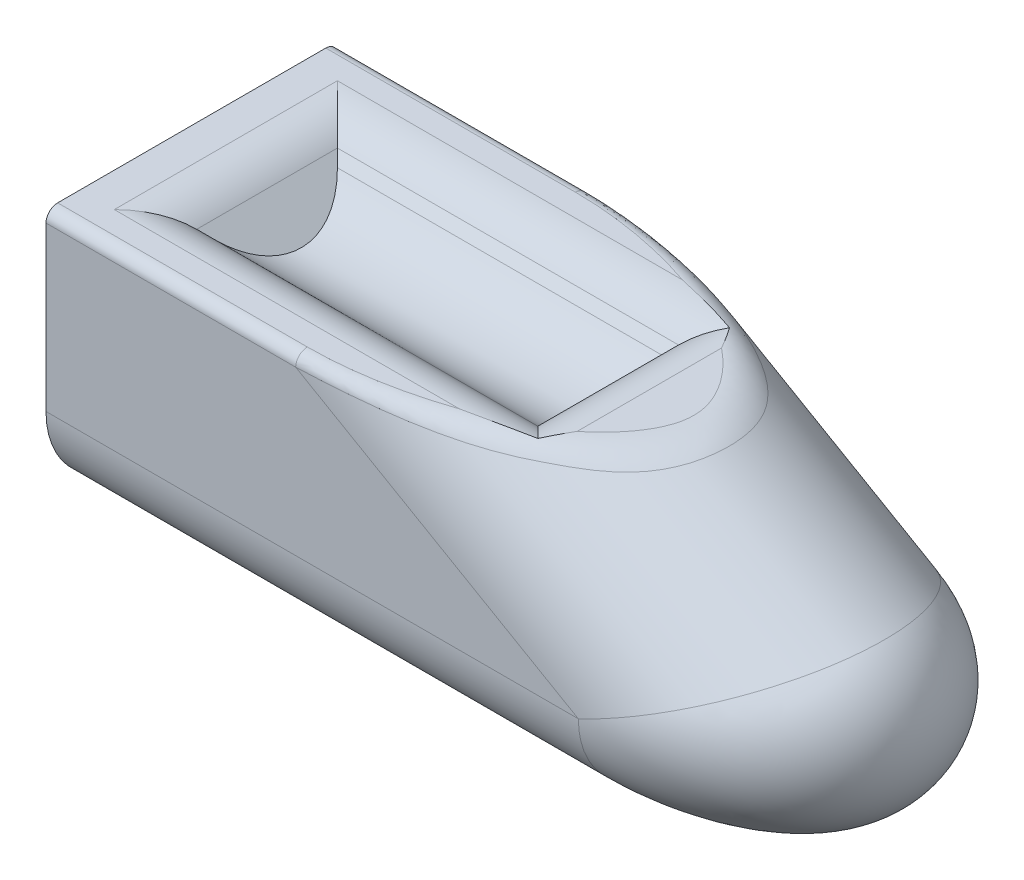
ISO-10303-21;
HEADER;
FILE_DESCRIPTION(('STEP AP214'),'2;1');
FILE_NAME('part.step','',(''),(''),'','','');
FILE_SCHEMA(('AUTOMOTIVE_DESIGN { 1 0 10303 214 1 1 1 1 }'));
ENDSEC;
DATA;
#1=APPLICATION_CONTEXT('core data for automotive mechanical design processes');
#2=APPLICATION_PROTOCOL_DEFINITION('international standard','automotive_design',2000,#1);
#3=PRODUCT_CONTEXT('',#1,'mechanical');
#4=PRODUCT('Part','Part','',(#3));
#5=PRODUCT_RELATED_PRODUCT_CATEGORY('part','',(#4));
#6=PRODUCT_DEFINITION_FORMATION('','',#4);
#7=PRODUCT_DEFINITION_CONTEXT('part definition',#1,'design');
#8=PRODUCT_DEFINITION('design','',#6,#7);
#9=PRODUCT_DEFINITION_SHAPE('','',#8);
#10=(LENGTH_UNIT() NAMED_UNIT(*) SI_UNIT(.MILLI.,.METRE.));
#11=(NAMED_UNIT(*) PLANE_ANGLE_UNIT() SI_UNIT($,.RADIAN.));
#12=(NAMED_UNIT(*) SI_UNIT($,.STERADIAN.) SOLID_ANGLE_UNIT());
#13=UNCERTAINTY_MEASURE_WITH_UNIT(LENGTH_MEASURE(1.E-05),#10,'distance_accuracy_value','');
#14=(GEOMETRIC_REPRESENTATION_CONTEXT(3) GLOBAL_UNCERTAINTY_ASSIGNED_CONTEXT((#13)) GLOBAL_UNIT_ASSIGNED_CONTEXT((#10,
#11,#12)) REPRESENTATION_CONTEXT('',''));
#15=CARTESIAN_POINT('',(0.,0.,0.));
#16=DIRECTION('',(0.,0.,1.));
#17=DIRECTION('',(1.,0.,0.));
#18=AXIS2_PLACEMENT_3D('',#15,#16,#17);
#19=CARTESIAN_POINT('',(-60.6217782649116,45.,25.));
#20=DIRECTION('',(0.,-1.,0.));
#21=DIRECTION('',(1.,0.,0.));
#22=AXIS2_PLACEMENT_3D('',#19,#20,#21);
#23=PLANE('',#22);
#24=CARTESIAN_POINT('',(-107.157676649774,45.,-23.));
#25=CARTESIAN_POINT('',(-104.096624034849,45.,-22.9999999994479));
#26=CARTESIAN_POINT('',(-101.053282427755,45.,-22.7554052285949));
#27=CARTESIAN_POINT('',(-95.1400454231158,45.,-21.9057557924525));
#28=CARTESIAN_POINT('',(-92.2703257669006,45.,-21.3000678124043));
#29=CARTESIAN_POINT('',(-84.0862755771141,45.,-19.0877234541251));
#30=CARTESIAN_POINT('',(-79.2071082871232,45.,-17.0919150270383));
#31=CARTESIAN_POINT('',(-73.2051034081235,45.,-13.7547814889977));
#32=CARTESIAN_POINT('',(-71.4843326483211,45.,-12.4746744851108));
#33=CARTESIAN_POINT('',(-68.6029644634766,45.,-9.86096206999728));
#34=CARTESIAN_POINT('',(-67.441651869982,45.,-8.52775875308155));
#35=CARTESIAN_POINT('',(-65.6189012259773,45.,-5.95503978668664));
#36=CARTESIAN_POINT('',(-64.9536363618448,45.,-4.71566623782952));
#37=CARTESIAN_POINT('',(-64.2839216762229,45.,-2.91992369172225));
#38=CARTESIAN_POINT('',(-64.1160540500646,45.,-2.33053903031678));
#39=CARTESIAN_POINT('',(-63.8924167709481,45.,-1.16072728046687));
#40=CARTESIAN_POINT('',(-63.837168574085,45.,-0.580320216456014));
#41=CARTESIAN_POINT('',(-63.837168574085,45.,0.580320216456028));
#42=CARTESIAN_POINT('',(-63.8924167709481,45.,1.16072728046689));
#43=CARTESIAN_POINT('',(-64.1160540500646,45.,2.3305390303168));
#44=CARTESIAN_POINT('',(-64.2839216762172,45.,2.91992369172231));
#45=CARTESIAN_POINT('',(-64.9536363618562,45.,4.71566623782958));
#46=CARTESIAN_POINT('',(-65.6189012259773,45.,5.95503978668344));
#47=CARTESIAN_POINT('',(-67.441651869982,45.,8.52775875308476));
#48=CARTESIAN_POINT('',(-68.6029644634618,45.,9.8609620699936));
#49=CARTESIAN_POINT('',(-71.4843326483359,45.,12.4746744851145));
#50=CARTESIAN_POINT('',(-73.2051034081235,45.,13.7547814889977));
#51=CARTESIAN_POINT('',(-79.2071082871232,45.,17.0919150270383));
#52=CARTESIAN_POINT('',(-84.0862755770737,45.,19.0877234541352));
#53=CARTESIAN_POINT('',(-92.2703257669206,45.,21.3000678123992));
#54=CARTESIAN_POINT('',(-95.1400454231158,45.,21.9057557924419));
#55=CARTESIAN_POINT('',(-101.053282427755,45.,22.7554052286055));
#56=CARTESIAN_POINT('',(-104.096624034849,45.,22.9999999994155));
#57=CARTESIAN_POINT('',(-107.157676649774,45.,23.));
#58=(BOUNDED_CURVE() B_SPLINE_CURVE(3,(#24,#25,#26,#27,#28,#29,#30,#31,#32,#33,#34,#35,#36,#37,
#38,#39,#40,#41,#42,#43,#44,#45,#46,#47,#48,#49,#50,#51,#52,#53,#54,#55,#56,#57),.UNSPECIFIED.,
.F.,.F.) B_SPLINE_CURVE_WITH_KNOTS((4,2,2,2,2,2,2,2,2,2,2,2,2,2,2,2,4),(1.64150965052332,
1.82902002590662,2.01653040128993,2.39155115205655,2.57906152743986,2.76657190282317,
2.95408227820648,3.04783746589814,3.14159265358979,3.23534784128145,3.3291030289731,
3.51661340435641,3.70412377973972,3.89163415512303,4.26665490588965,4.45416528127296,
4.64167565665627),
.UNSPECIFIED.) CURVE() GEOMETRIC_REPRESENTATION_ITEM() RATIONAL_B_SPLINE_CURVE((1.,1.,1.,1.,1.,
1.,1.,1.,1.,1.,1.,1.,1.,1.,1.,1.,1.,1.,1.,1.,1.,1.,1.,1.,1.,1.,1.,1.,1.,1.,1.,1.,1.,1.)) REPRESENTATION_ITEM(''));
#59=CARTESIAN_POINT('',(-71.4796425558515,45.,12.3838880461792));
#60=VERTEX_POINT('',#59);
#61=CARTESIAN_POINT('',(-71.4796425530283,45.,-12.3839087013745));
#62=VERTEX_POINT('',#61);
#63=EDGE_CURVE('E394',#60,#62,#58,.F.);
#64=ORIENTED_EDGE('',*,*,#63,.T.);
#65=DIRECTION('',(0.,0.,-1.));
#66=VECTOR('',#65,1.);
#67=CARTESIAN_POINT('',(-71.4796426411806,45.,25.));
#68=LINE('',#67,#66);
#69=EDGE_CURVE('E369',#62,#60,#68,.F.);
#70=ORIENTED_EDGE('',*,*,#69,.T.);
#71=EDGE_LOOP('',(#64,#70));
#72=FACE_BOUND('',#71,.T.);
#73=ADVANCED_FACE('F37',(#72),#23,.F.);
#74=CARTESIAN_POINT('',(-75.6217782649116,51.2132034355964,0.));
#75=DIRECTION('',(-1.,0.,0.));
#76=DIRECTION('',(0.,-1.,0.));
#77=AXIS2_PLACEMENT_3D('',#74,#75,#76);
#78=CYLINDRICAL_SURFACE('',#77,15.);
#79=DIRECTION('',(1.,0.,0.));
#80=VECTOR('',#79,1.);
#81=CARTESIAN_POINT('',(-75.6217782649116,40.6066017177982,-10.6066017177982));
#82=LINE('',#81,#80);
#83=CARTESIAN_POINT('',(-135.606601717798,40.6066017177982,-10.6066017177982));
#84=VERTEX_POINT('',#83);
#85=CARTESIAN_POINT('',(-80.0151765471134,40.6066017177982,-10.6066017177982));
#86=VERTEX_POINT('',#85);
#87=EDGE_CURVE('E416',#84,#86,#82,.T.);
#88=ORIENTED_EDGE('',*,*,#87,.F.);
#89=CARTESIAN_POINT('',(-146.213203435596,51.2132034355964,0.));
#90=DIRECTION('',(-0.707106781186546,-0.707106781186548,0.));
#91=DIRECTION('',(-0.707106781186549,0.707106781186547,0.));
#92=AXIS2_PLACEMENT_3D('',#89,#90,#91);
#93=ELLIPSE('',#92,21.2132034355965,15.);
#94=CARTESIAN_POINT('',(-135.606601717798,40.6066017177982,10.6066017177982));
#95=VERTEX_POINT('',#94);
#96=EDGE_CURVE('E413',#95,#84,#93,.F.);
#97=ORIENTED_EDGE('',*,*,#96,.F.);
#98=DIRECTION('',(1.,0.,0.));
#99=VECTOR('',#98,1.);
#100=CARTESIAN_POINT('',(-75.6217782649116,40.6066017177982,10.6066017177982));
#101=LINE('',#100,#99);
#102=CARTESIAN_POINT('',(-80.0151765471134,40.6066017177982,10.6066017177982));
#103=VERTEX_POINT('',#102);
#104=EDGE_CURVE('E415',#103,#95,#101,.F.);
#105=ORIENTED_EDGE('',*,*,#104,.F.);
#106=CARTESIAN_POINT('',(-69.4085748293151,51.2132034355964,0.));
#107=DIRECTION('',(0.707106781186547,-0.707106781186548,0.));
#108=DIRECTION('',(-0.707106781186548,-0.707106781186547,0.));
#109=AXIS2_PLACEMENT_3D('',#106,#107,#108);
#110=ELLIPSE('',#109,21.2132034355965,15.);
#111=EDGE_CURVE('E406',#86,#103,#110,.F.);
#112=ORIENTED_EDGE('',*,*,#111,.F.);
#113=EDGE_LOOP('',(#88,#97,#105,#112));
#114=FACE_BOUND('',#113,.T.);
#115=ADVANCED_FACE('F39',(#114),#78,.F.);
#116=CARTESIAN_POINT('',(-78.6602540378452,0.,0.));
#117=CARTESIAN_POINT('',(-80.6350415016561,0.,0.));
#118=CARTESIAN_POINT('',(-82.542539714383,0.511112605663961,0.));
#119=CARTESIAN_POINT('',(-84.4500379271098,1.02222521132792,0.));
#120=CARTESIAN_POINT('',(-86.1602540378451,2.00961894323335,0.));
#121=CARTESIAN_POINT('',(-78.6602540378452,0.,0.220001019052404));
#122=CARTESIAN_POINT('',(-80.6350415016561,0.,0.306892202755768));
#123=CARTESIAN_POINT('',(-82.542539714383,0.511112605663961,0.390822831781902));
#124=CARTESIAN_POINT('',(-84.4500379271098,1.02222521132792,0.474752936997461));
#125=CARTESIAN_POINT('',(-86.1602540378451,2.00961894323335,0.550002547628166));
#126=CARTESIAN_POINT('',(-78.6456632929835,0.,0.440002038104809));
#127=CARTESIAN_POINT('',(-80.6195067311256,0.,0.613809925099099));
#128=CARTESIAN_POINT('',(-82.5257748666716,0.513564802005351,0.781645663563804));
#129=CARTESIAN_POINT('',(-84.4320374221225,1.02713042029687,0.949545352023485));
#130=CARTESIAN_POINT('',(-86.1401917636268,2.01909591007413,1.10000509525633));
#131=CARTESIAN_POINT('',(-78.5881251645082,0.,0.876247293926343));
#132=CARTESIAN_POINT('',(-80.558248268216,0.,1.22274227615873));
#133=CARTESIAN_POINT('',(-82.4596521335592,0.523242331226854,1.55712939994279));
#134=CARTESIAN_POINT('',(-84.3610507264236,1.04648543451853,1.89157985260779));
#135=CARTESIAN_POINT('',(-86.0610768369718,2.05646802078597,2.19061823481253));
#136=CARTESIAN_POINT('',(-78.5451730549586,0.,1.09249089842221));
#137=CARTESIAN_POINT('',(-80.512509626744,0.,1.52480457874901));
#138=CARTESIAN_POINT('',(-82.410288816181,0.530468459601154,1.94178926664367));
#139=CARTESIAN_POINT('',(-84.3080472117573,1.06093996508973,2.35889570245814));
#140=CARTESIAN_POINT('',(-86.0020176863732,2.08436623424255,2.73122724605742));
#141=CARTESIAN_POINT('',(-78.4304279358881,0.,1.52829340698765));
#142=CARTESIAN_POINT('',(-80.3903132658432,0.,2.13427710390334));
#143=CARTESIAN_POINT('',(-82.2783806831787,0.549796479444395,2.71800554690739));
#144=CARTESIAN_POINT('',(-84.1664256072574,1.09959625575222,3.30186699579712));
#145=CARTESIAN_POINT('',(-85.8442431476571,2.15889537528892,3.82073351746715));
#146=CARTESIAN_POINT('',(-78.357344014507,0.,1.74750931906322));
#147=CARTESIAN_POINT('',(-80.3124613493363,0.,2.44128489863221));
#148=CARTESIAN_POINT('',(-82.1943505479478,0.56211669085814,3.10900002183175));
#149=CARTESIAN_POINT('',(-84.0761910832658,1.12424052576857,3.77690305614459));
#150=CARTESIAN_POINT('',(-85.743752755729,2.20636477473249,4.3687732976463));
#151=CARTESIAN_POINT('',(-78.1859946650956,0.,2.17580431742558));
#152=CARTESIAN_POINT('',(-80.1299069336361,0.,3.04221606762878));
#153=CARTESIAN_POINT('',(-81.9972606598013,0.59105269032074,3.8744264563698));
#154=CARTESIAN_POINT('',(-83.8645661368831,1.18211246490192,4.70682530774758));
#155=CARTESIAN_POINT('',(-85.508147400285,2.31765944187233,5.43951079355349));
#156=CARTESIAN_POINT('',(-78.0877220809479,0.,2.3848805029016));
#157=CARTESIAN_POINT('',(-80.0251702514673,0.,3.33617315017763));
#158=CARTESIAN_POINT('',(-81.8841926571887,0.607669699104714,4.24885367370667));
#159=CARTESIAN_POINT('',(-83.7431360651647,1.21535102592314,5.16176373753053));
#160=CARTESIAN_POINT('',(-85.3730225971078,2.38148935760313,5.96220125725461));
#161=CARTESIAN_POINT('',(-77.8607178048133,0.,2.80848385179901));
#162=CARTESIAN_POINT('',(-79.7831711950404,0.,3.93321976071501));
#163=CARTESIAN_POINT('',(-81.622886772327,0.646136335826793,5.00942020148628));
#164=CARTESIAN_POINT('',(-83.4625099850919,1.29228627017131,6.08588990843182));
#165=CARTESIAN_POINT('',(-85.0608917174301,2.52893296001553,7.02120962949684));
#166=CARTESIAN_POINT('',(-77.730127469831,0.,3.02200741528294));
#167=CARTESIAN_POINT('',(-79.6438939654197,0.,4.23503675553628));
#168=CARTESIAN_POINT('',(-81.4724999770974,0.668307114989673,5.39392510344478));
#169=CARTESIAN_POINT('',(-83.3009732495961,1.33663384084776,6.55311798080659));
#170=CARTESIAN_POINT('',(-84.881330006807,2.61375387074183,7.55501853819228));
#171=CARTESIAN_POINT('',(-77.4484175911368,0.,3.43494689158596));
#172=CARTESIAN_POINT('',(-79.3433413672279,0.,4.82063657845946));
#173=CARTESIAN_POINT('',(-81.1478857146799,0.71626444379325,6.14006211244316));
#174=CARTESIAN_POINT('',(-82.9522972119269,1.43254851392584,7.45979358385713));
#175=CARTESIAN_POINT('',(-84.4939789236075,2.79672980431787,8.58736722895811));
#176=CARTESIAN_POINT('',(-77.297294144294,0.,3.63436011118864));
#177=CARTESIAN_POINT('',(-79.1820251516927,0.,5.1044375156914));
#178=CARTESIAN_POINT('',(-80.9736537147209,0.742051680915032,6.50168985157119));
#179=CARTESIAN_POINT('',(-82.7651104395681,1.484128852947,7.89926929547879));
#180=CARTESIAN_POINT('',(-84.286184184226,2.89488736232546,9.08590027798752));
#181=CARTESIAN_POINT('',(-76.9624467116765,0.,4.03856027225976));
#182=CARTESIAN_POINT('',(-78.8244225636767,0.,5.68193567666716));
#183=CARTESIAN_POINT('',(-80.5873353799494,0.799363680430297,7.23761323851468));
#184=CARTESIAN_POINT('',(-82.3500404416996,1.59875818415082,8.79368682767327));
#185=CARTESIAN_POINT('',(-83.825768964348,3.11237714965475,10.0964006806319));
#186=CARTESIAN_POINT('',(-76.776973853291,0.,4.2418896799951));
#187=CARTESIAN_POINT('',(-78.6262267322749,0.,5.97376925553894));
#188=CARTESIAN_POINT('',(-80.3732058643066,0.831204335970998,7.60955806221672));
#189=CARTESIAN_POINT('',(-82.1199295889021,1.66244676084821,9.24575703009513));
#190=CARTESIAN_POINT('',(-83.5707437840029,3.2328453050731,10.604724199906));
#191=CARTESIAN_POINT('',(-76.3900495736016,0.,4.63261505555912));
#192=CARTESIAN_POINT('',(-78.2125281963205,0.,6.53732752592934));
#193=CARTESIAN_POINT('',(-79.9261163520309,0.897875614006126,8.32790593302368));
#194=CARTESIAN_POINT('',(-81.6394483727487,1.7957894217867,10.118896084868));
#195=CARTESIAN_POINT('',(-83.0387228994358,3.48415999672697,11.5815376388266));
#196=CARTESIAN_POINT('',(-76.1885964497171,0.,4.82000932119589));
#197=CARTESIAN_POINT('',(-77.9969822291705,0.,6.8090564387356));
#198=CARTESIAN_POINT('',(-79.6931543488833,0.932706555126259,8.67430625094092));
#199=CARTESIAN_POINT('',(-81.389027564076,1.86545793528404,10.5399716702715));
#200=CARTESIAN_POINT('',(-82.7617248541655,3.61500763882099,12.0500233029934));
#201=CARTESIAN_POINT('',(-75.751876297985,0.,5.19822188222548));
#202=CARTESIAN_POINT('',(-77.5293790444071,0.,7.36058657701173));
#203=CARTESIAN_POINT('',(-79.1876536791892,1.00851739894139,9.37742379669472));
#204=CARTESIAN_POINT('',(-80.8455656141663,2.0170891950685,11.3947656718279));
#205=CARTESIAN_POINT('',(-82.1612346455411,3.89866569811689,12.9955547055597));
#206=CARTESIAN_POINT('',(-75.5152510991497,0.,5.38746440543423));
#207=CARTESIAN_POINT('',(-77.2758202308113,0.,7.6383794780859));
#208=CARTESIAN_POINT('',(-78.9134964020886,1.04976277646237,9.73163209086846));
#209=CARTESIAN_POINT('',(-80.5507591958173,2.09958797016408,11.8253857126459));
#210=CARTESIAN_POINT('',(-81.8358749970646,4.05235827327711,13.4686610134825));
#211=CARTESIAN_POINT('',(-75.0298141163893,0.,5.74951008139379));
#212=CARTESIAN_POINT('',(-76.7552266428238,0.,8.17354909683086));
#213=CARTESIAN_POINT('',(-78.3504274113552,1.13477851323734,10.4140712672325));
#214=CARTESIAN_POINT('',(-79.945213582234,2.26961962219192,12.6550959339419));
#215=CARTESIAN_POINT('',(-81.1683991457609,4.36765884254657,14.3737752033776));
#216=CARTESIAN_POINT('',(-74.7810015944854,0.,5.92231223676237));
#217=CARTESIAN_POINT('',(-76.4881476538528,0.,8.43091871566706));
#218=CARTESIAN_POINT('',(-78.0615148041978,1.17854902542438,10.7423005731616));
#219=CARTESIAN_POINT('',(-79.6344225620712,2.35716791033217,13.054175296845));
#220=CARTESIAN_POINT('',(-80.8262819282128,4.52926731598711,14.8057805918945));
#221=CARTESIAN_POINT('',(-74.249907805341,0.,6.26838064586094));
#222=CARTESIAN_POINT('',(-75.9175134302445,0.,8.95044898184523));
#223=CARTESIAN_POINT('',(-77.4440758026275,1.27244618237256,11.4048510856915));
#224=CARTESIAN_POINT('',(-78.9700881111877,2.54497601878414,13.8598435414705));
#225=CARTESIAN_POINT('',(-80.0960279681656,4.87422285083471,15.6709516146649));
#226=CARTESIAN_POINT('',(-73.9666730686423,0.,6.44017796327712));
#227=CARTESIAN_POINT('',(-75.6128804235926,0.,9.21075230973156));
#228=CARTESIAN_POINT('',(-77.1143720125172,1.3227843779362,11.7368695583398));
#229=CARTESIAN_POINT('',(-78.6152613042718,2.64566111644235,14.2635601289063));
#230=CARTESIAN_POINT('',(-79.7065802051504,5.05818920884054,16.1004449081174));
#231=CARTESIAN_POINT('',(-73.3909902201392,0.,6.76748370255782));
#232=CARTESIAN_POINT('',(-74.9930389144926,0.,9.71151231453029));
#233=CARTESIAN_POINT('',(-76.4432747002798,1.42569146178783,12.3755908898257));
#234=CARTESIAN_POINT('',(-77.8929065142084,2.85147553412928,15.0402442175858));
#235=CARTESIAN_POINT('',(-78.9150162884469,5.43210618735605,16.918709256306));
#236=CARTESIAN_POINT('',(-73.0985417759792,0.,6.9229915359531));
#237=CARTESIAN_POINT('',(-74.6777853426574,0.,9.95195324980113));
#238=CARTESIAN_POINT('',(-76.1018807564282,1.47826043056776,12.6822928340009));
#239=CARTESIAN_POINT('',(-77.5253253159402,2.9566215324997,15.4131873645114));
#240=CARTESIAN_POINT('',(-78.5128996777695,5.62205702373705,17.3074788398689));
#241=CARTESIAN_POINT('',(-72.482104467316,0.,7.23121064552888));
#242=CARTESIAN_POINT('',(-74.0124430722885,0.,10.4338120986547));
#243=CARTESIAN_POINT('',(-75.3811607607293,1.58974202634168,13.2968583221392));
#244=CARTESIAN_POINT('',(-76.7491158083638,3.17960202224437,16.1605549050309));
#245=CARTESIAN_POINT('',(-77.6652983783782,6.02244480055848,18.0780266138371));
#246=CARTESIAN_POINT('',(-72.1574873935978,0.,7.38266139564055));
#247=CARTESIAN_POINT('',(-73.6616150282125,0.,10.6736530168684));
#248=CARTESIAN_POINT('',(-75.0010106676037,1.64882251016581,13.6027798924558));
#249=CARTESIAN_POINT('',(-76.3395894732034,3.2977726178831,16.5325303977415));
#250=CARTESIAN_POINT('',(-77.2189499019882,6.23328977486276,18.45665348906));
#251=CARTESIAN_POINT('',(-71.5013397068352,0.,7.66968851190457));
#252=CARTESIAN_POINT('',(-72.9514966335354,0.,11.1344061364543));
#253=CARTESIAN_POINT('',(-74.2312280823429,1.76906695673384,14.1903895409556));
#254=CARTESIAN_POINT('',(-75.5101404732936,3.53826185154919,17.2469980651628));
#255=CARTESIAN_POINT('',(-76.3167468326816,6.65947019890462,19.1742212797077));
#256=CARTESIAN_POINT('',(-71.1698089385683,0.,7.80526452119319));
#257=CARTESIAN_POINT('',(-72.5921595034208,0.,11.3552961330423));
#258=CARTESIAN_POINT('',(-73.8415953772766,1.83023096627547,14.4720770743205));
#259=CARTESIAN_POINT('',(-75.0901620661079,3.66059909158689,17.5894555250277));
#260=CARTESIAN_POINT('',(-75.8608920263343,6.87480574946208,19.5131613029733));
#261=CARTESIAN_POINT('',(-70.4785026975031,0.,8.07049364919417));
#262=CARTESIAN_POINT('',(-71.841671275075,0.,11.7942621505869));
#263=CARTESIAN_POINT('',(-73.0275588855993,1.9586912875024,15.0316792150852));
#264=CARTESIAN_POINT('',(-74.2124532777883,3.91753931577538,18.2697790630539));
#265=CARTESIAN_POINT('',(-74.9103459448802,7.32382232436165,20.1762341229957));
#266=CARTESIAN_POINT('',(-70.1183355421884,0.,8.19912297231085));
#267=CARTESIAN_POINT('',(-71.4500231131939,0.,12.0110722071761));
#268=CARTESIAN_POINT('',(-72.6025879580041,2.02612229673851,15.3080448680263));
#269=CARTESIAN_POINT('',(-73.7541019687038,4.05241230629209,18.6056663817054));
#270=CARTESIAN_POINT('',(-74.4151161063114,7.5577577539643,20.4978074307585));
#271=CARTESIAN_POINT('',(-69.3928864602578,0.,8.44098080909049));
#272=CARTESIAN_POINT('',(-70.6597569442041,0.,12.4267499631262));
#273=CARTESIAN_POINT('',(-71.744694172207,2.16303942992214,15.8376836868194));
#274=CARTESIAN_POINT('',(-72.8285776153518,4.3262470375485,19.2492678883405));
#275=CARTESIAN_POINT('',(-73.4176236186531,8.02895075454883,21.1024520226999));
#276=CARTESIAN_POINT('',(-69.0276044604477,0.,8.55420910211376));
#277=CARTESIAN_POINT('',(-70.2610889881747,0.,12.6255904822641));
#278=CARTESIAN_POINT('',(-71.3117712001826,2.23252558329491,16.0909565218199));
#279=CARTESIAN_POINT('',(-72.3613444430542,4.46523022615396,19.5569390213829));
#280=CARTESIAN_POINT('',(-72.9153608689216,8.26620837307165,21.3855227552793));
#281=CARTESIAN_POINT('',(-68.2731922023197,0.,8.77198916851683));
#282=CARTESIAN_POINT('',(-69.4360587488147,0.,13.0169809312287));
#283=CARTESIAN_POINT('',(-70.4154975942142,2.37724625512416,16.5891578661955));
#284=CARTESIAN_POINT('',(-71.3937019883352,4.75469184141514,20.1620209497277));
#285=CARTESIAN_POINT('',(-71.8780440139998,8.75621350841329,21.9299729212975));
#286=CARTESIAN_POINT('',(-67.883834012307,0.,8.87574936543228));
#287=CARTESIAN_POINT('',(-69.0093628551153,0.,13.2085621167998));
#288=CARTESIAN_POINT('',(-69.9517607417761,2.45258915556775,16.8329094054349));
#289=CARTESIAN_POINT('',(-70.8928611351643,4.90539049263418,20.4579030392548));
#290=CARTESIAN_POINT('',(-71.3426765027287,9.00910907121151,22.1893734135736));
#291=CARTESIAN_POINT('',(-67.1014464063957,0.,9.06830130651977));
#292=CARTESIAN_POINT('',(-68.1500052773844,0.,13.5746927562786));
#293=CARTESIAN_POINT('',(-69.0173335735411,2.6053962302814,17.2983316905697));
#294=CARTESIAN_POINT('',(-69.8833604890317,5.21100527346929,21.0226187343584));
#295=CARTESIAN_POINT('',(-70.2668935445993,9.51728472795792,22.6707532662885));
#296=CARTESIAN_POINT('',(-66.7084169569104,0.,9.15709291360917));
#297=CARTESIAN_POINT('',(-67.717288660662,0.,13.7492108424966));
#298=CARTESIAN_POINT('',(-68.5466431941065,2.68286042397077,17.5200022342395));
#299=CARTESIAN_POINT('',(-69.3746338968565,5.36594680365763,21.291401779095));
#300=CARTESIAN_POINT('',(-69.7264780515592,9.77256484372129,22.8927322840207));
#301=CARTESIAN_POINT('',(-65.9037528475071,0.,9.32374425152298));
#302=CARTESIAN_POINT('',(-66.8291090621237,0.,14.0889320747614));
#303=CARTESIAN_POINT('',(-67.5800777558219,2.84300232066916,17.9509668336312));
#304=CARTESIAN_POINT('',(-68.3295676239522,5.68624966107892,21.8136608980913));
#305=CARTESIAN_POINT('',(-68.6200649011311,10.2952095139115,23.3093606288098));
#306=CARTESIAN_POINT('',(-65.4919994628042,0.,9.40102939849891));
#307=CARTESIAN_POINT('',(-66.3734181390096,0.,14.2534348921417));
#308=CARTESIAN_POINT('',(-67.0839451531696,2.92576487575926,18.1594190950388));
#309=CARTESIAN_POINT('',(-67.7929226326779,5.85179009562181,22.0660172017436));
#310=CARTESIAN_POINT('',(-68.0539039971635,10.5626511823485,23.502573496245));
#311=CARTESIAN_POINT('',(-64.6660227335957,0.,9.54097571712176));
#312=CARTESIAN_POINT('',(-65.4566757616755,0.,14.566164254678));
#313=CARTESIAN_POINT('',(-66.0852930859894,3.0935522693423,18.5550205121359));
#314=CARTESIAN_POINT('',(-66.7123558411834,6.18736572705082,22.544492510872));
#315=CARTESIAN_POINT('',(-66.9181859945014,11.0991388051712,23.8524392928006));
#316=CARTESIAN_POINT('',(-64.2517993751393,0.,9.60363680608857));
#317=CARTESIAN_POINT('',(-64.995562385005,0.,14.7143553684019));
#318=CARTESIAN_POINT('',(-65.5827735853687,3.17857712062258,18.7421695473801));
#319=CARTESIAN_POINT('',(-66.1683580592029,6.35743150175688,22.770553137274));
#320=CARTESIAN_POINT('',(-66.3486288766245,11.3681847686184,24.0090920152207));
#321=CARTESIAN_POINT('',(-63.4106214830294,0.,9.71633321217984));
#322=CARTESIAN_POINT('',(-64.0561347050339,0.,14.9988984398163));
#323=CARTESIAN_POINT('',(-64.5584537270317,3.35316674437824,19.1006645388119));
#324=CARTESIAN_POINT('',(-65.0590541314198,6.70662642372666,23.2030320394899));
#325=CARTESIAN_POINT('',(-65.1920092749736,11.9145458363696,24.2908330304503));
#326=CARTESIAN_POINT('',(-62.9836171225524,0.,9.76599580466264));
#327=CARTESIAN_POINT('',(-63.5776587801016,0.,15.1347891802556));
#328=CARTESIAN_POINT('',(-64.0364926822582,3.44279209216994,19.2714697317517));
#329=CARTESIAN_POINT('',(-64.4935273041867,6.88589553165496,23.4086999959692));
#330=CARTESIAN_POINT('',(-64.6048782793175,12.1918933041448,24.4149895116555));
#331=CARTESIAN_POINT('',(-62.1281554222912,0.,9.85093691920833));
#332=CARTESIAN_POINT('',(-62.6155723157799,0.,15.3908486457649));
#333=CARTESIAN_POINT('',(-62.986344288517,3.62451027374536,19.5922604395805));
#334=CARTESIAN_POINT('',(-63.3553103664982,7.24933304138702,23.7942237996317));
#335=CARTESIAN_POINT('',(-63.4286184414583,12.7475319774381,24.6273422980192));
#336=CARTESIAN_POINT('',(-61.699697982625,0.,9.8862144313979));
#337=CARTESIAN_POINT('',(-62.1318905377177,0.,15.5109762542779));
#338=CARTESIAN_POINT('',(-62.458156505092,3.7166032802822,19.7422444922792));
#339=CARTESIAN_POINT('',(-62.7825321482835,7.43353875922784,23.9740102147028));
#340=CARTESIAN_POINT('',(-62.8394894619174,13.0258232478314,24.7155360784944));
#341=CARTESIAN_POINT('',(-60.8363198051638,0.,9.94304734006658));
#342=CARTESIAN_POINT('',(-61.1532098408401,0.,15.7373789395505));
#343=CARTESIAN_POINT('',(-61.3887965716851,3.90453179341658,20.0236132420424));
#344=CARTESIAN_POINT('',(-61.6224366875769,7.80940568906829,24.3103596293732));
#345=CARTESIAN_POINT('',(-61.6523444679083,13.5866038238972,24.8576183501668));
#346=CARTESIAN_POINT('',(-60.4013870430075,0.,9.96441968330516));
#347=CARTESIAN_POINT('',(-60.6580912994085,0.,15.8434068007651));
#348=CARTESIAN_POINT('',(-60.8475448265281,4.00040026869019,20.1547327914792));
#349=CARTESIAN_POINT('',(-61.0349588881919,8.00116473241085,24.4665112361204));
#350=CARTESIAN_POINT('',(-61.0543119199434,13.8691009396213,24.9110492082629));
#351=CARTESIAN_POINT('',(-59.5310542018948,0.,9.99289605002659));
#352=CARTESIAN_POINT('',(-59.6626797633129,0.,16.0400075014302));
#353=CARTESIAN_POINT('',(-59.7586999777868,4.19484095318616,20.3962344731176));
#354=CARTESIAN_POINT('',(-59.8526728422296,8.39004751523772,24.7529154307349));
#355=CARTESIAN_POINT('',(-59.8576042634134,14.434398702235,24.9822401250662));
#356=CARTESIAN_POINT('',(-59.0956541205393,0.,9.9999999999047));
#357=CARTESIAN_POINT('',(-59.1623045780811,0.,16.1305344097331));
#358=CARTESIAN_POINT('',(-59.2111068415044,4.29341317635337,20.5066164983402));
#359=CARTESIAN_POINT('',(-59.2577625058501,8.58721597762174,24.8830883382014));
#360=CARTESIAN_POINT('',(-59.2589291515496,14.7171993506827,24.9999999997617));
#361=CARTESIAN_POINT('',(-58.2248422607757,0.,10.0000000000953));
#362=CARTESIAN_POINT('',(-58.156225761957,0.,16.2961981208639));
#363=CARTESIAN_POINT('',(-58.1093864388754,4.49338607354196,20.706589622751));
#364=CARTESIAN_POINT('',(-58.0603917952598,8.98716336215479,25.1173722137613));
#365=CARTESIAN_POINT('',(-58.0615628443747,15.2828082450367,25.0000000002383));
#366=CARTESIAN_POINT('',(-57.7894304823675,0.,9.99289566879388));
#367=CARTESIAN_POINT('',(-57.6504339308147,0.,16.3712852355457));
#368=CARTESIAN_POINT('',(-57.555258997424,4.59478682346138,20.7961801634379));
#369=CARTESIAN_POINT('',(-57.4578216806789,9.18999113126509,25.2213959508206));
#370=CARTESIAN_POINT('',(-57.4628716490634,15.565616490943,24.9822391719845));
#371=CARTESIAN_POINT('',(-56.9190976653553,0.,9.96441853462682));
#372=CARTESIAN_POINT('',(-56.6333016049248,0.,16.5059270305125));
#373=CARTESIAN_POINT('',(-56.4402078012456,4.80055256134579,20.9542408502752));
#374=CARTESIAN_POINT('',(-56.2448424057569,9.60152431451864,25.4028765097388));
#375=CARTESIAN_POINT('',(-56.2661640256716,16.130914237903,24.911046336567));
#376=CARTESIAN_POINT('',(-56.4841765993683,0.,9.94304657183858));
#377=CARTESIAN_POINT('',(-56.1218659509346,0.,16.5654288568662));
#378=CARTESIAN_POINT('',(-55.8792844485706,4.90491737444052,21.0227122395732));
#379=CARTESIAN_POINT('',(-55.6343148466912,9.81028284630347,25.4802394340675));
#380=CARTESIAN_POINT('',(-55.6681475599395,16.4134037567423,24.8576164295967));
#381=CARTESIAN_POINT('',(-55.6208244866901,0.,9.88621537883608));
#382=CARTESIAN_POINT('',(-55.0996103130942,0.,16.6678883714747));
#383=CARTESIAN_POINT('',(-54.7573613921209,5.11543211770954,21.1371901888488));
#384=CARTESIAN_POINT('',(-54.412774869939,10.2313028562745,25.6067303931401));
#385=CARTESIAN_POINT('',(-54.481038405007,16.9741674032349,24.7155384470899));
#386=CARTESIAN_POINT('',(-55.1923814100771,0.,9.85093928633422));
#387=CARTESIAN_POINT('',(-54.5887375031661,0.,16.7109922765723));
#388=CARTESIAN_POINT('',(-54.1964538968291,5.22154230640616,21.1834721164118));
#389=CARTESIAN_POINT('',(-53.801709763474,10.4435539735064,25.6561057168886));
#390=CARTESIAN_POINT('',(-53.8919291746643,17.2524493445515,24.6273482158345));
#391=CARTESIAN_POINT('',(-54.3369196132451,0.,9.76599913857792));
#392=CARTESIAN_POINT('',(-53.5606418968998,0.,16.7811270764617));
#393=CARTESIAN_POINT('',(-53.0669609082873,5.43700121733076,21.2539356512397));
#394=CARTESIAN_POINT('',(-52.5708082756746,10.8744739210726,25.7268981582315));
#395=CARTESIAN_POINT('',(-52.7156692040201,17.8080880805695,24.4149978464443));
#396=CARTESIAN_POINT('',(-53.9099008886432,0.,9.71633512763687));
#397=CARTESIAN_POINT('',(-53.0433087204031,0.,16.8080931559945));
#398=CARTESIAN_POINT('',(-52.4983754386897,5.54634992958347,21.2781173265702));
#399=CARTESIAN_POINT('',(-51.9508346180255,11.093205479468,25.7481984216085));
#400=CARTESIAN_POINT('',(-52.1285184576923,18.0854448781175,24.290837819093));
#401=CARTESIAN_POINT('',(-53.0687086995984,0.,9.60363680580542));
#402=CARTESIAN_POINT('',(-52.0149367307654,0.,16.8445847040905));
#403=CARTESIAN_POINT('',(-51.3673709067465,5.7656564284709,21.3027445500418));
#404=CARTESIAN_POINT('',(-50.717317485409,11.5317952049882,25.7609584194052));
#405=CARTESIAN_POINT('',(-50.9718791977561,18.6318152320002,24.0090920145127));
#406=CARTESIAN_POINT('',(-52.6544853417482,0.,9.54097571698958));
#407=CARTESIAN_POINT('',(-51.5039005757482,0.,16.8544695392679));
#408=CARTESIAN_POINT('',(-50.8051643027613,5.87552758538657,21.3037796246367));
#409=CARTESIAN_POINT('',(-50.1038005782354,11.7515726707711,25.7530394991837));
#410=CARTESIAN_POINT('',(-50.4023220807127,18.9008611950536,23.8524392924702));
#411=CARTESIAN_POINT('',(-51.8285086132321,0.,9.40102939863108));
#412=CARTESIAN_POINT('',(-50.4742935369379,0.,16.8569453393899));
#413=CARTESIAN_POINT('',(-49.6718322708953,6.09874497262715,21.2819378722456));
#414=CARTESIAN_POINT('',(-48.8667308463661,12.1980099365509,25.7068790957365));
#415=CARTESIAN_POINT('',(-49.2666040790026,19.4373488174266,23.5025734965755));
#416=CARTESIAN_POINT('',(-51.4167552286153,0.,9.32374425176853));
#417=CARTESIAN_POINT('',(-49.9555958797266,0.,16.8494558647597));
#418=CARTESIAN_POINT('',(-49.1007068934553,6.21209118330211,21.2590611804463));
#419=CARTESIAN_POINT('',(-48.2430211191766,12.4247415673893,25.6684920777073));
#420=CARTESIAN_POINT('',(-48.7004431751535,19.7047904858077,23.3093606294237));
#421=CARTESIAN_POINT('',(-50.6120911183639,0.,9.15709291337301));
#422=CARTESIAN_POINT('',(-48.9296808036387,0.,16.8161942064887));
#423=CARTESIAN_POINT('',(-47.9704214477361,6.43807784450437,21.1885125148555));
#424=CARTESIAN_POINT('',(-47.0085625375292,12.8766754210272,25.5606684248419));
#425=CARTESIAN_POINT('',(-47.5940300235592,20.2274351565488,22.8927322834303));
#426=CARTESIAN_POINT('',(-50.2190616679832,0.,9.06830130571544));
#427=CARTESIAN_POINT('',(-48.422560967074,0.,16.7910417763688));
#428=CARTESIAN_POINT('',(-47.4116382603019,6.55057971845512,21.1418215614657));
#429=CARTESIAN_POINT('',(-46.3979592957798,13.1017180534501,25.4923081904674));
#430=CARTESIAN_POINT('',(-47.0536145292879,20.4827152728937,22.6707532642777));
#431=CARTESIAN_POINT('',(-49.4366740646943,0.,8.87574936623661));
#432=CARTESIAN_POINT('',(-47.3991488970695,0.,16.7212180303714));
#433=CARTESIAN_POINT('',(-46.2835040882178,6.77921011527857,21.0215482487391));
#434=CARTESIAN_POINT('',(-45.1650889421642,13.5589816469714,25.3215824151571));
#435=CARTESIAN_POINT('',(-45.9778315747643,20.9908909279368,22.1893734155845));
#436=CARTESIAN_POINT('',(-49.0473158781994,0.,8.77198917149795));
#437=CARTESIAN_POINT('',(-46.8827131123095,0.,16.6764440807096));
#438=CARTESIAN_POINT('',(-45.7141532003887,6.89533860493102,20.9479661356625));
#439=CARTESIAN_POINT('',(-44.5426458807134,13.7912818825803,25.2190333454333));
#440=CARTESIAN_POINT('',(-45.4424640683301,21.2437864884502,21.9299729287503));
#441=CARTESIAN_POINT('',(-48.2929036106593,0.,8.55420909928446));
#442=CARTESIAN_POINT('',(-45.8658655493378,0.,16.5674936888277));
#443=CARTESIAN_POINT('',(-44.5926272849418,7.12541346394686,20.7748405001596));
#444=CARTESIAN_POINT('',(-43.3167209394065,14.2513742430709,24.9817753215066));
#445=CARTESIAN_POINT('',(-44.4051472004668,21.7337916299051,21.385522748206));
#446=CARTESIAN_POINT('',(-47.927621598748,0.,8.44098079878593));
#447=CARTESIAN_POINT('',(-45.3657076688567,0.,16.504296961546));
#448=CARTESIAN_POINT('',(-44.0410541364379,7.23916978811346,20.6768099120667));
#449=CARTESIAN_POINT('',(-42.7135612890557,14.478927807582,24.8487446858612));
#450=CARTESIAN_POINT('',(-43.9028844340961,21.9710492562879,21.1024519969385));
#451=CARTESIAN_POINT('',(-47.2021725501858,0.,8.19912298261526));
#452=CARTESIAN_POINT('',(-44.3541525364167,0.,16.354626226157));
#453=CARTESIAN_POINT('',(-42.9253421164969,7.47028974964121,20.4491736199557));
#454=CARTESIAN_POINT('',(-41.4936774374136,14.9411706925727,24.543137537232));
#455=CARTESIAN_POINT('',(-42.9053919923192,22.4422422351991,20.4978074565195));
#456=CARTESIAN_POINT('',(-46.8420054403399,0.,8.07049368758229));
#457=CARTESIAN_POINT('',(-43.8425968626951,0.,16.268018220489));
#458=CARTESIAN_POINT('',(-42.3612034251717,7.58765333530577,20.319568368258));
#459=CARTESIAN_POINT('',(-40.8767621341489,15.1759426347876,24.3703282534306));
#460=CARTESIAN_POINT('',(-42.4101622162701,22.6761776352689,20.1762342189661));
#461=CARTESIAN_POINT('',(-46.1506990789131,0.,7.80526448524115));
#462=CARTESIAN_POINT('',(-42.8393473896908,0.,16.0734864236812));
#463=CARTESIAN_POINT('',(-41.2546672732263,7.81853021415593,20.0326223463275));
#464=CARTESIAN_POINT('',(-39.6673003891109,15.6376209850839,23.9910614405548));
#465=CARTESIAN_POINT('',(-41.4596159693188,23.1251942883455,19.5131612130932));
#466=CARTESIAN_POINT('',(-45.8191681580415,0.,7.66968838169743));
#467=CARTESIAN_POINT('',(-42.3481409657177,0.,15.9670887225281));
#468=CARTESIAN_POINT('',(-40.7131619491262,7.93181521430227,19.8775635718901));
#469=CARTESIAN_POINT('',(-39.0753173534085,15.8642306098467,23.7871292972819));
#470=CARTESIAN_POINT('',(-41.0037609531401,23.3405299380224,19.1742209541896));
#471=CARTESIAN_POINT('',(-45.163020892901,0.,7.38266152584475));
#472=CARTESIAN_POINT('',(-41.3522320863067,0.,15.7249002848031));
#473=CARTESIAN_POINT('',(-39.6155346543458,8.16166115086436,19.5286710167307));
#474=CARTESIAN_POINT('',(-37.8759568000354,16.323925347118,23.3315244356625));
#475=CARTESIAN_POINT('',(-40.1015584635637,23.7667100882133,18.4566538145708));
#476=CARTESIAN_POINT('',(-44.8384043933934,0.,7.23121113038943));
#477=CARTESIAN_POINT('',(-40.847363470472,0.,15.5889323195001));
#478=CARTESIAN_POINT('',(-39.0594130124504,8.27822201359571,19.3348381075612));
#479=CARTESIAN_POINT('',(-37.2683836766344,16.5570884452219,23.0795578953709));
#480=CARTESIAN_POINT('',(-39.6552107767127,23.9775546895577,18.0780278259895));
#481=CARTESIAN_POINT('',(-44.2219655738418,0.,6.92299108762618));
#482=CARTESIAN_POINT('',(-39.8608234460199,0.,15.2922015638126));
#483=CARTESIAN_POINT('',(-37.9730469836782,8.50559064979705,18.9162976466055));
#484=CARTESIAN_POINT('',(-36.0826255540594,17.0117348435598,22.5393745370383));
#485=CARTESIAN_POINT('',(-38.8076073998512,24.3779434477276,17.3074777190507));
#486=CARTESIAN_POINT('',(-43.9295152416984,0.,6.76748208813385));
#487=CARTESIAN_POINT('',(-39.3799311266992,0.,15.1338333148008));
#488=CARTESIAN_POINT('',(-37.4440101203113,8.61617014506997,18.6950169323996));
#489=CARTESIAN_POINT('',(-35.5052745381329,17.232926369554,22.2549125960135));
#490=CARTESIAN_POINT('',(-38.4054881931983,24.567895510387,16.9187052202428));
#491=CARTESIAN_POINT('',(-43.353837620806,0.,6.44017957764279));
#492=CARTESIAN_POINT('',(-38.4030389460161,0.,14.7780630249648));
#493=CARTESIAN_POINT('',(-36.3701416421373,8.83973040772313,18.2028577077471));
#494=CARTESIAN_POINT('',(-34.3344159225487,17.6800495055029,21.6263541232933));
#495=CARTESIAN_POINT('',(-37.6139314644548,24.9418090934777,16.1004489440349));
#496=CARTESIAN_POINT('',(-43.0706099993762,0.,6.26838665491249));
#497=CARTESIAN_POINT('',(-37.9068837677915,0.,14.5804285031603));
#498=CARTESIAN_POINT('',(-35.8253105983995,8.95271108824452,17.9319809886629));
#499=CARTESIAN_POINT('',(-33.7407324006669,17.9060407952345,21.2818957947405));
#500=CARTESIAN_POINT('',(-37.2244934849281,25.1257708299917,15.670966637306));
#501=CARTESIAN_POINT('',(-42.5394975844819,0.,5.92230674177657));
#502=CARTESIAN_POINT('',(-36.9414175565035,0.,14.1543189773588));
#503=CARTESIAN_POINT('',(-34.7660621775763,9.170738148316,17.3538604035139));
#504=CARTESIAN_POINT('',(-32.5881862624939,18.3419950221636,20.5520239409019));
#505=CARTESIAN_POINT('',(-36.4942139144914,25.4707384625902,14.8057668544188));
#506=CARTESIAN_POINT('',(-42.290662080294,0.,5.74949039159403));
#507=CARTESIAN_POINT('',(-36.4731103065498,0.,13.9295959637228));
#508=CARTESIAN_POINT('',(-34.253030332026,9.27563644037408,17.0517101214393));
#509=CARTESIAN_POINT('',(-32.0303068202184,18.5518075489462,20.1721169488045));
#510=CARTESIAN_POINT('',(-36.152065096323,25.6323618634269,14.373725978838));
#511=CARTESIAN_POINT('',(-41.9266071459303,0.,5.47796701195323));
#512=CARTESIAN_POINT('',(-35.7612409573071,0.,13.552899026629));
#513=CARTESIAN_POINT('',(-33.473257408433,9.43343859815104,16.5496372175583));
#514=CARTESIAN_POINT('',(-31.1846089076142,18.8670119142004,19.545949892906));
#515=CARTESIAN_POINT('',(-35.6514895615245,25.8688224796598,13.6949175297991));
#516=CARTESIAN_POINT('',(-41.8067819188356,0.,5.38540372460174));
#517=CARTESIAN_POINT('',(-35.5218958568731,0.,13.4204279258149));
#518=CARTESIAN_POINT('',(-33.2116135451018,9.48611815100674,16.3741268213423));
#519=CARTESIAN_POINT('',(-30.9006539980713,18.9723718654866,19.3273513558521));
#520=CARTESIAN_POINT('',(-35.4867298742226,25.9466512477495,13.463509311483));
#521=CARTESIAN_POINT('',(-41.5705722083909,0.,5.19597496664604));
#522=CARTESIAN_POINT('',(-35.0399116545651,0.,13.1401996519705));
#523=CARTESIAN_POINT('',(-32.6851501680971,9.59146810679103,16.0047250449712));
#524=CARTESIAN_POINT('',(-30.3297105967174,19.1830718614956,18.8687738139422));
#525=CARTESIAN_POINT('',(-35.1619415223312,26.1000739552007,12.9899374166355));
#526=CARTESIAN_POINT('',(-41.454187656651,0.,5.09910958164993));
#527=CARTESIAN_POINT('',(-34.7972617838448,0.,12.992401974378));
#528=CARTESIAN_POINT('',(-32.4203307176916,9.64413850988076,15.8108340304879));
#529=CARTESIAN_POINT('',(-30.0427115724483,19.28841287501,18.6287378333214));
#530=CARTESIAN_POINT('',(-35.0019127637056,26.1756679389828,12.7477739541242));
#531=CARTESIAN_POINT('',(-41.2358247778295,0.,4.91000146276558));
#532=CARTESIAN_POINT('',(-34.3315427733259,0.,12.6938467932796));
#533=CARTESIAN_POINT('',(-31.912456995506,9.74442792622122,15.4211442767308));
#534=CARTESIAN_POINT('',(-29.4928022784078,19.4889682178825,18.1480054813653));
#535=CARTESIAN_POINT('',(-34.7016638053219,26.317498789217,12.2750036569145));
#536=CARTESIAN_POINT('',(-41.1335056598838,0.,4.81815237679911));
#537=CARTESIAN_POINT('',(-34.1086680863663,0.,12.5445427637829));
#538=CARTESIAN_POINT('',(-31.6696398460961,9.7920661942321,15.2271594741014));
#539=CARTESIAN_POINT('',(-29.2300386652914,19.5842439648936,17.9092978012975));
#540=CARTESIAN_POINT('',(-34.560975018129,26.3839570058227,12.0453809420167));
#541=CARTESIAN_POINT('',(-40.9324513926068,0.,4.63061251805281));
#542=CARTESIAN_POINT('',(-33.6609977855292,0.,12.229795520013));
#543=CARTESIAN_POINT('',(-31.1823467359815,9.88696189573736,14.820170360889));
#544=CARTESIAN_POINT('',(-28.7031217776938,19.7740355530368,17.4100657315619));
#545=CARTESIAN_POINT('',(-34.2845254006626,26.5145455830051,11.5765312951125));
#546=CARTESIAN_POINT('',(-40.8337160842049,0.,4.53492191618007));
#547=CARTESIAN_POINT('',(-33.4362000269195,0.,12.0643165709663));
#548=CARTESIAN_POINT('',(-30.9378708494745,9.93421934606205,14.6071668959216));
#549=CARTESIAN_POINT('',(-28.4389679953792,19.8685486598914,17.1494934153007));
#550=CARTESIAN_POINT('',(-34.1487643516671,26.5786760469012,11.3373047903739));
#551=CARTESIAN_POINT('',(-40.6402567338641,0.,4.33956271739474));
#552=CARTESIAN_POINT('',(-32.9854221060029,0.,11.7152064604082));
#553=CARTESIAN_POINT('',(-30.448104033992,10.0281073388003,14.1599659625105));
#554=CARTESIAN_POINT('',(-27.9102111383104,20.0563248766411,16.6042005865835));
#555=CARTESIAN_POINT('',(-33.8827577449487,26.7043315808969,10.8489067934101));
#556=CARTESIAN_POINT('',(-40.5455326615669,0.,4.23989415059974));
#557=CARTESIAN_POINT('',(-32.7594443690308,0.,11.5315367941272));
#558=CARTESIAN_POINT('',(-30.2028131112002,10.0747378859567,13.9257686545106));
#559=CARTESIAN_POINT('',(-27.6456131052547,20.1495828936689,16.3194297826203));
#560=CARTESIAN_POINT('',(-33.7525121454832,26.7658566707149,10.5997353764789));
#561=CARTESIAN_POINT('',(-40.3605848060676,0.,4.03646006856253));
#562=CARTESIAN_POINT('',(-32.3074089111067,0.,11.1438411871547));
#563=CARTESIAN_POINT('',(-29.7126475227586,10.1670659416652,13.4338225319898));
#564=CARTESIAN_POINT('',(-27.1173165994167,20.3342391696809,15.7232321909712));
#565=CARTESIAN_POINT('',(-33.4982088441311,26.8859838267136,10.0911501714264));
#566=CARTESIAN_POINT('',(-40.2703608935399,0.,3.93269467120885));
#567=CARTESIAN_POINT('',(-32.0813597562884,0.,10.9397759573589));
#568=CARTESIAN_POINT('',(-29.4677728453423,10.212763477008,13.1760743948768));
#569=CARTESIAN_POINT('',(-26.8536304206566,20.4256295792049,15.4117556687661));
#570=CARTESIAN_POINT('',(-33.3741509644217,26.9445859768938,9.83173667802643));
#571=CARTESIAN_POINT('',(-40.1029337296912,0.,3.73059202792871));
#572=CARTESIAN_POINT('',(-31.651273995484,0.,10.5285586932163));
#573=CARTESIAN_POINT('',(-29.0023251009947,10.2987577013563,12.6591464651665));
#574=CARTESIAN_POINT('',(-26.3529158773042,20.5976004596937,14.7892231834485));
#575=CARTESIAN_POINT('',(-33.1439386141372,27.0533331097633,9.32648006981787));
#576=CARTESIAN_POINT('',(-40.0252922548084,0.,3.63261816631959));
#577=CARTESIAN_POINT('',(-31.4470759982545,0.,10.3233018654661));
#578=CARTESIAN_POINT('',(-28.7815654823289,10.3391678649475,12.4022244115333));
#579=CARTESIAN_POINT('',(-26.1156121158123,20.6784160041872,14.4806037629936));
#580=CARTESIAN_POINT('',(-33.0371815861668,27.1037627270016,9.08154541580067));
#581=CARTESIAN_POINT('',(-39.8746510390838,0.,3.43316790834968));
#582=CARTESIAN_POINT('',(-31.0415392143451,0.,9.89223131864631));
#583=CARTESIAN_POINT('',(-28.3435830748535,10.4185676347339,11.8649939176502));
#584=CARTESIAN_POINT('',(-25.6451836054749,20.8372156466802,13.8372127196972));
#585=CARTESIAN_POINT('',(-32.8300499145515,27.2016070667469,8.5829197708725));
#586=CARTESIAN_POINT('',(-39.8016509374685,0.,3.33169178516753));
#587=CARTESIAN_POINT('',(-30.8402193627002,0.,9.66639173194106));
#588=CARTESIAN_POINT('',(-28.1263600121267,10.4575573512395,11.5846872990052));
#589=CARTESIAN_POINT('',(-25.4120825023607,20.9151889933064,13.5024113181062));
#590=CARTESIAN_POINT('',(-32.7296747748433,27.249022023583,8.32922946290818));
#591=CARTESIAN_POINT('',(-39.6607968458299,0.,3.12522835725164));
#592=CARTESIAN_POINT('',(-30.4425309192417,0.,9.19242832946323));
#593=CARTESIAN_POINT('',(-27.6977018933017,10.5337230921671,10.9989090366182));
#594=CARTESIAN_POINT('',(-24.9524540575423,21.0675206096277,12.804817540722));
#595=CARTESIAN_POINT('',(-32.5360003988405,27.3405094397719,7.8130708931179));
#596=CARTESIAN_POINT('',(-39.5929426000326,0.,3.0202412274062));
#597=CARTESIAN_POINT('',(-30.2461890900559,0.,8.94428267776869));
#598=CARTESIAN_POINT('',(-27.48626654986,10.5708992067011,10.6934386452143));
#599=CARTESIAN_POINT('',(-24.7259592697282,21.1418653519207,12.4420021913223));
#600=CARTESIAN_POINT('',(-32.4427008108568,27.3845820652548,7.55060306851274));
#601=CARTESIAN_POINT('',(-39.4629258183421,0.,2.80679386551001));
#602=CARTESIAN_POINT('',(-29.8611083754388,0.,8.42419435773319));
#603=CARTESIAN_POINT('',(-27.0720162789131,10.6429860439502,10.0558110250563));
#604=CARTESIAN_POINT('',(-24.2825390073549,21.2860391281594,11.6868350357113));
#605=CARTESIAN_POINT('',(-32.2639277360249,27.4690304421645,7.01698466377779));
#606=CARTESIAN_POINT('',(-39.4007630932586,0.,2.69833374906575));
#607=CARTESIAN_POINT('',(-29.6724048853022,0.,8.15223720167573));
#608=CARTESIAN_POINT('',(-26.8692010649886,10.6778968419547,9.72365468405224));
#609=CARTESIAN_POINT('',(-24.065655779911,21.3558518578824,11.2944713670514));
#610=CARTESIAN_POINT('',(-32.17845398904,27.5094063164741,6.74583437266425));
#611=CARTESIAN_POINT('',(-39.2872594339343,0.,2.48653291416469));
#612=CARTESIAN_POINT('',(-29.3200133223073,0.,7.60541016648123));
#613=CARTESIAN_POINT('',(-26.4908220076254,10.7423610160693,9.0583044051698));
#614=CARTESIAN_POINT('',(-23.6613389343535,21.4847717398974,10.5106859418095));
#615=CARTESIAN_POINT('',(-32.0223864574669,27.5831291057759,6.21633228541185));
#616=CARTESIAN_POINT('',(-39.2354537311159,0.,2.38344155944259));
#617=CARTESIAN_POINT('',(-29.1555327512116,0.,7.33234213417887));
#618=CARTESIAN_POINT('',(-26.3143624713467,10.7721199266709,8.72716195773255));
#619=CARTESIAN_POINT('',(-23.4729416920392,21.5442817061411,10.1214751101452));
#620=CARTESIAN_POINT('',(-31.9511536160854,27.6167778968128,5.95860389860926));
#621=CARTESIAN_POINT('',(-39.1376590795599,0.,2.17452953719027));
#622=CARTESIAN_POINT('',(-28.8388472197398,0.,6.76470355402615));
#623=CARTESIAN_POINT('',(-25.974923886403,10.8288402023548,8.04105593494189));
#624=CARTESIAN_POINT('',(-23.1107496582,21.6577223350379,9.31690152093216));
#625=CARTESIAN_POINT('',(-31.8166859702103,27.6802973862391,5.43632384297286));
#626=CARTESIAN_POINT('',(-39.0916700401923,0.,2.06870891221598));
#627=CARTESIAN_POINT('',(-28.6866827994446,0.,6.47014199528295));
#628=CARTESIAN_POINT('',(-25.8119446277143,10.8558016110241,7.68609273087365));
#629=CARTESIAN_POINT('',(-22.9370020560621,21.7116367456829,8.90155783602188));
#630=CARTESIAN_POINT('',(-31.7534510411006,27.7101681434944,5.17177228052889));
#631=CARTESIAN_POINT('',(-39.0059907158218,0.,1.85456294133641));
#632=CARTESIAN_POINT('',(-28.3980207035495,0.,5.85994730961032));
#633=CARTESIAN_POINT('',(-25.5030334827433,10.9064680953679,6.95294834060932));
#634=CARTESIAN_POINT('',(-22.6078413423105,21.8129698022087,8.04546355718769));
#635=CARTESIAN_POINT('',(-31.635641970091,27.7658184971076,4.63640735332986));
#636=CARTESIAN_POINT('',(-38.9662993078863,0.,1.74623804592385));
#637=CARTESIAN_POINT('',(-28.2615651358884,0.,5.5443409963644));
#638=CARTESIAN_POINT('',(-25.3570985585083,10.9301737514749,6.57477131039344));
#639=CARTESIAN_POINT('',(-22.452476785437,21.86037252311,7.60475535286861));
#640=CARTESIAN_POINT('',(-31.581066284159,27.7915988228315,4.36559511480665));
#641=CARTESIAN_POINT('',(-38.8936634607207,0.,1.52734424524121));
#642=CARTESIAN_POINT('',(-28.0078651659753,0.,4.89328056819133));
#643=CARTESIAN_POINT('',(-25.0859895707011,10.9738791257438,5.79664727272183));
#644=CARTESIAN_POINT('',(-22.1639581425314,21.9477833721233,6.6995675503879));
#645=CARTESIAN_POINT('',(-31.4811919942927,27.838777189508,3.81836061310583));
#646=CARTESIAN_POINT('',(-38.8607188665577,0.,1.41677539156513));
#647=CARTESIAN_POINT('',(-27.8906668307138,0.,4.5578668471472));
#648=CARTESIAN_POINT('',(-24.9608150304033,10.9938789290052,5.39670076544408));
#649=CARTESIAN_POINT('',(-22.0308568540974,21.9877747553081,6.23514841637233));
#650=CARTESIAN_POINT('',(-31.4358931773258,27.8601753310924,3.54193847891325));
#651=CARTESIAN_POINT('',(-38.8033442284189,0.,1.19887358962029));
#652=CARTESIAN_POINT('',(-27.6838967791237,0.,3.885340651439));
#653=CARTESIAN_POINT('',(-24.7401226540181,11.0289190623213,4.59648647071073));
#654=CARTESIAN_POINT('',(-21.7962511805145,22.0578535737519,5.30727984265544));
#655=CARTESIAN_POINT('',(-31.3570030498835,27.8974412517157,2.99718397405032));
#656=CARTESIAN_POINT('',(-38.7785924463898,0.,1.09162547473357));
#657=CARTESIAN_POINT('',(-27.5933381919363,0.,3.54905235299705));
#658=CARTESIAN_POINT('',(-24.643506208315,11.0441450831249,4.19707825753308));
#659=CARTESIAN_POINT('',(-21.6936160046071,22.0882993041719,4.84482150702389));
#660=CARTESIAN_POINT('',(-31.3229693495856,27.913518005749,2.72906368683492));
#661=CARTESIAN_POINT('',(-38.7359195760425,0.,0.875776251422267));
#662=CARTESIAN_POINT('',(-27.4357428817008,0.,2.86344793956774));
#663=CARTESIAN_POINT('',(-24.4754627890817,11.0705072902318,3.38409484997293));
#664=CARTESIAN_POINT('',(-21.5151239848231,22.1410237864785,3.90445870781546));
#665=CARTESIAN_POINT('',(-31.2642941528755,27.9412348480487,2.18944062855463));
#666=CARTESIAN_POINT('',(-38.7179983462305,0.,0.767175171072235));
#667=CARTESIAN_POINT('',(-27.3687390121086,0.,2.51419682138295));
#668=CARTESIAN_POINT('',(-24.4040352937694,11.0816435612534,2.97051994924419));
#669=CARTESIAN_POINT('',(-21.4393044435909,22.1632913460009,3.4266450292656));
#670=CARTESIAN_POINT('',(-31.2396524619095,27.9528750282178,1.91793792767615));
#671=CARTESIAN_POINT('',(-38.6892262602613,0.,0.549050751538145));
#672=CARTESIAN_POINT('',(-27.2605293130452,0.,1.80646536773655));
#673=CARTESIAN_POINT('',(-24.2887324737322,11.0995695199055,2.13338858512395));
#674=CARTESIAN_POINT('',(-21.3169081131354,22.1991433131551,2.46011305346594));
#675=CARTESIAN_POINT('',(-31.2000908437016,27.971563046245,1.37262687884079));
#676=CARTESIAN_POINT('',(-38.6783745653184,0.,0.439527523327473));
#677=CARTESIAN_POINT('',(-27.2193450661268,0.,1.44806293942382));
#678=CARTESIAN_POINT('',(-24.2448538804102,11.1063597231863,1.70983331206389));
#679=CARTESIAN_POINT('',(-21.270355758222,22.2127205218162,1.9715017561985));
#680=CARTESIAN_POINT('',(-31.1851697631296,27.9786114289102,1.09881880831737));
#681=CARTESIAN_POINT('',(-38.6638884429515,0.,0.220002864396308));
#682=CARTESIAN_POINT('',(-27.1642484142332,0.,0.726398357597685));
#683=CARTESIAN_POINT('',(-24.1861709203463,11.1154321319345,0.857518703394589));
#684=CARTESIAN_POINT('',(-21.2080862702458,22.2308653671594,0.988536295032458));
#685=CARTESIAN_POINT('',(-31.165251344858,27.9880204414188,0.550007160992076));
#686=CARTESIAN_POINT('',(-38.6602540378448,0.,0.110001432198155));
#687=CARTESIAN_POINT('',(-27.1503492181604,0.,0.363221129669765));
#688=CARTESIAN_POINT('',(-24.1713666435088,11.1177143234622,0.428759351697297));
#689=CARTESIAN_POINT('',(-21.1923840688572,22.2354286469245,0.494298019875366));
#690=CARTESIAN_POINT('',(-31.1602540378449,27.9903810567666,0.275003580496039));
#691=CARTESIAN_POINT('',(-38.6602540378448,0.,-0.110001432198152));
#692=CARTESIAN_POINT('',(-27.1503492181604,0.,-0.363221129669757));
#693=CARTESIAN_POINT('',(-24.1713666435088,11.1177143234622,-0.428759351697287));
#694=CARTESIAN_POINT('',(-21.1923840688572,22.2354286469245,-0.494298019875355));
#695=CARTESIAN_POINT('',(-31.1602540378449,27.9903810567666,-0.275003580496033));
#696=CARTESIAN_POINT('',(-38.6638884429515,0.,-0.220002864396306));
#697=CARTESIAN_POINT('',(-27.1642484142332,0.,-0.726398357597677));
#698=CARTESIAN_POINT('',(-24.1861709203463,11.1154321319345,-0.85751870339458));
#699=CARTESIAN_POINT('',(-21.2080862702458,22.2308653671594,-0.988536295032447));
#700=CARTESIAN_POINT('',(-31.165251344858,27.9880204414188,-0.55000716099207));
#701=CARTESIAN_POINT('',(-38.6783745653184,0.,-0.439527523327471));
#702=CARTESIAN_POINT('',(-27.2193450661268,0.,-1.44806293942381));
#703=CARTESIAN_POINT('',(-24.2448538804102,11.1063597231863,-1.70983331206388));
#704=CARTESIAN_POINT('',(-21.270355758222,22.2127205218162,-1.97150175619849));
#705=CARTESIAN_POINT('',(-31.1851697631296,27.9786114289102,-1.09881880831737));
#706=CARTESIAN_POINT('',(-38.6892262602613,0.,-0.549050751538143));
#707=CARTESIAN_POINT('',(-27.2605293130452,0.,-1.80646536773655));
#708=CARTESIAN_POINT('',(-24.2887324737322,11.0995695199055,-2.13338858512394));
#709=CARTESIAN_POINT('',(-21.3169081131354,22.1991433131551,-2.46011305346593));
#710=CARTESIAN_POINT('',(-31.2000908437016,27.971563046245,-1.37262687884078));
#711=CARTESIAN_POINT('',(-38.7179983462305,0.,-0.767175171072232));
#712=CARTESIAN_POINT('',(-27.3687390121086,0.,-2.51419682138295));
#713=CARTESIAN_POINT('',(-24.4040352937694,11.0816435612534,-2.97051994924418));
#714=CARTESIAN_POINT('',(-21.4393044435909,22.1632913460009,-3.42664502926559));
#715=CARTESIAN_POINT('',(-31.2396524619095,27.9528750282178,-1.91793792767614));
#716=CARTESIAN_POINT('',(-38.7359195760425,0.,-0.875776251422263));
#717=CARTESIAN_POINT('',(-27.4357428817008,0.,-2.86344793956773));
#718=CARTESIAN_POINT('',(-24.4754627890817,11.0705072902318,-3.38409484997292));
#719=CARTESIAN_POINT('',(-21.5151239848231,22.1410237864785,-3.90445870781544));
#720=CARTESIAN_POINT('',(-31.2642941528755,27.9412348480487,-2.18944062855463));
#721=CARTESIAN_POINT('',(-38.7785924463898,0.,-1.09162547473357));
#722=CARTESIAN_POINT('',(-27.5933381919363,0.,-3.54905235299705));
#723=CARTESIAN_POINT('',(-24.643506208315,11.0441450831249,-4.19707825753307));
#724=CARTESIAN_POINT('',(-21.6936160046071,22.0882993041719,-4.84482150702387));
#725=CARTESIAN_POINT('',(-31.3229693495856,27.913518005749,-2.72906368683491));
#726=CARTESIAN_POINT('',(-38.8033442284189,0.,-1.19887358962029));
#727=CARTESIAN_POINT('',(-27.6838967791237,0.,-3.88534065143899));
#728=CARTESIAN_POINT('',(-24.7401226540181,11.0289190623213,-4.59648647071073));
#729=CARTESIAN_POINT('',(-21.7962511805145,22.0578535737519,-5.30727984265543));
#730=CARTESIAN_POINT('',(-31.3570030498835,27.8974412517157,-2.99718397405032));
#731=CARTESIAN_POINT('',(-38.8607188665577,0.,-1.41677539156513));
#732=CARTESIAN_POINT('',(-27.8906668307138,0.,-4.5578668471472));
#733=CARTESIAN_POINT('',(-24.9608150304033,10.9938789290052,-5.39670076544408));
#734=CARTESIAN_POINT('',(-22.0308568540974,21.9877747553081,-6.23514841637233));
#735=CARTESIAN_POINT('',(-31.4358931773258,27.8601753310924,-3.54193847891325));
#736=CARTESIAN_POINT('',(-38.8936634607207,0.,-1.52734424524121));
#737=CARTESIAN_POINT('',(-28.0078651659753,0.,-4.89328056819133));
#738=CARTESIAN_POINT('',(-25.0859895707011,10.9738791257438,-5.79664727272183));
#739=CARTESIAN_POINT('',(-22.1639581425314,21.9477833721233,-6.69956755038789));
#740=CARTESIAN_POINT('',(-31.4811919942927,27.838777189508,-3.81836061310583));
#741=CARTESIAN_POINT('',(-38.9662993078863,0.,-1.74623804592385));
#742=CARTESIAN_POINT('',(-28.2615651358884,0.,-5.5443409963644));
#743=CARTESIAN_POINT('',(-25.3570985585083,10.9301737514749,-6.57477131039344));
#744=CARTESIAN_POINT('',(-22.452476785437,21.86037252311,-7.60475535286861));
#745=CARTESIAN_POINT('',(-31.581066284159,27.7915988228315,-4.36559511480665));
#746=CARTESIAN_POINT('',(-39.0059907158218,0.,-1.85456294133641));
#747=CARTESIAN_POINT('',(-28.3980207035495,0.,-5.85994730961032));
#748=CARTESIAN_POINT('',(-25.5030334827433,10.9064680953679,-6.95294834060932));
#749=CARTESIAN_POINT('',(-22.6078413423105,21.8129698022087,-8.0454635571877));
#750=CARTESIAN_POINT('',(-31.635641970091,27.7658184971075,-4.63640735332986));
#751=CARTESIAN_POINT('',(-39.0916700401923,0.,-2.06870891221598));
#752=CARTESIAN_POINT('',(-28.6866827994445,0.,-6.47014199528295));
#753=CARTESIAN_POINT('',(-25.8119446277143,10.8558016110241,-7.68609273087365));
#754=CARTESIAN_POINT('',(-22.9370020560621,21.7116367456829,-8.90155783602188));
#755=CARTESIAN_POINT('',(-31.7534510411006,27.7101681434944,-5.17177228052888));
#756=CARTESIAN_POINT('',(-39.1376590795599,0.,-2.17452953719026));
#757=CARTESIAN_POINT('',(-28.8388472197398,0.,-6.76470355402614));
#758=CARTESIAN_POINT('',(-25.974923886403,10.8288402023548,-8.04105593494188));
#759=CARTESIAN_POINT('',(-23.1107496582,21.6577223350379,-9.31690152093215));
#760=CARTESIAN_POINT('',(-31.8166859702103,27.6802973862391,-5.43632384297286));
#761=CARTESIAN_POINT('',(-39.2354537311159,0.,-2.38344155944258));
#762=CARTESIAN_POINT('',(-29.1555327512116,0.,-7.33234213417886));
#763=CARTESIAN_POINT('',(-26.3143624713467,10.7721199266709,-8.72716195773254));
#764=CARTESIAN_POINT('',(-23.4729416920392,21.5442817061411,-10.1214751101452));
#765=CARTESIAN_POINT('',(-31.9511536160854,27.6167778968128,-5.95860389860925));
#766=CARTESIAN_POINT('',(-39.2872594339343,0.,-2.48653291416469));
#767=CARTESIAN_POINT('',(-29.3200133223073,0.,-7.60541016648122));
#768=CARTESIAN_POINT('',(-26.4908220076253,10.7423610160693,-9.05830440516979));
#769=CARTESIAN_POINT('',(-23.6613389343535,21.4847717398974,-10.5106859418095));
#770=CARTESIAN_POINT('',(-32.0223864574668,27.5831291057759,-6.21633228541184));
#771=CARTESIAN_POINT('',(-39.4007630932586,0.,-2.69833374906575));
#772=CARTESIAN_POINT('',(-29.6724048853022,0.,-8.15223720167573));
#773=CARTESIAN_POINT('',(-26.8692010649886,10.6778968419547,-9.72365468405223));
#774=CARTESIAN_POINT('',(-24.065655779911,21.3558518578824,-11.2944713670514));
#775=CARTESIAN_POINT('',(-32.17845398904,27.5094063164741,-6.74583437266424));
#776=CARTESIAN_POINT('',(-39.4629258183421,0.,-2.80679386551));
#777=CARTESIAN_POINT('',(-29.8611083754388,0.,-8.42419435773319));
#778=CARTESIAN_POINT('',(-27.0720162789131,10.6429860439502,-10.0558110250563));
#779=CARTESIAN_POINT('',(-24.2825390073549,21.2860391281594,-11.6868350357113));
#780=CARTESIAN_POINT('',(-32.2639277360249,27.4690304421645,-7.01698466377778));
#781=CARTESIAN_POINT('',(-39.5929426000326,0.,-3.0202412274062));
#782=CARTESIAN_POINT('',(-30.2461890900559,0.,-8.94428267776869));
#783=CARTESIAN_POINT('',(-27.48626654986,10.5708992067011,-10.6934386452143));
#784=CARTESIAN_POINT('',(-24.7259592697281,21.1418653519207,-12.4420021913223));
#785=CARTESIAN_POINT('',(-32.4427008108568,27.3845820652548,-7.55060306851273));
#786=CARTESIAN_POINT('',(-39.6607968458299,0.,-3.12522835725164));
#787=CARTESIAN_POINT('',(-30.4425309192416,0.,-9.19242832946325));
#788=CARTESIAN_POINT('',(-27.6977018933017,10.5337230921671,-10.9989090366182));
#789=CARTESIAN_POINT('',(-24.9524540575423,21.0675206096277,-12.804817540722));
#790=CARTESIAN_POINT('',(-32.5360003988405,27.3405094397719,-7.8130708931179));
#791=CARTESIAN_POINT('',(-39.8016509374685,0.,-3.33169178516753));
#792=CARTESIAN_POINT('',(-30.8402193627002,0.,-9.66639173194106));
#793=CARTESIAN_POINT('',(-28.1263600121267,10.4575573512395,-11.5846872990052));
#794=CARTESIAN_POINT('',(-25.4120825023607,20.9151889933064,-13.5024113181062));
#795=CARTESIAN_POINT('',(-32.7296747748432,27.249022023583,-8.32922946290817));
#796=CARTESIAN_POINT('',(-39.8746510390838,0.,-3.43316790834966));
#797=CARTESIAN_POINT('',(-31.0415392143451,0.,-9.89223131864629));
#798=CARTESIAN_POINT('',(-28.3435830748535,10.4185676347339,-11.8649939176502));
#799=CARTESIAN_POINT('',(-25.6451836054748,20.8372156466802,-13.8372127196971));
#800=CARTESIAN_POINT('',(-32.8300499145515,27.2016070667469,-8.58291977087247));
#801=CARTESIAN_POINT('',(-40.0252922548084,0.,-3.63261816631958));
#802=CARTESIAN_POINT('',(-31.4470759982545,0.,-10.3233018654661));
#803=CARTESIAN_POINT('',(-28.7815654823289,10.3391678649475,-12.4022244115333));
#804=CARTESIAN_POINT('',(-26.1156121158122,20.6784160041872,-14.4806037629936));
#805=CARTESIAN_POINT('',(-33.0371815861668,27.1037627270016,-9.08154541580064));
#806=CARTESIAN_POINT('',(-40.1029337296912,0.,-3.7305920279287));
#807=CARTESIAN_POINT('',(-31.651273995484,0.,-10.5285586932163));
#808=CARTESIAN_POINT('',(-29.0023251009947,10.2987577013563,-12.6591464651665));
#809=CARTESIAN_POINT('',(-26.3529158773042,20.5976004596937,-14.7892231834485));
#810=CARTESIAN_POINT('',(-33.1439386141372,27.0533331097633,-9.32648006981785));
#811=CARTESIAN_POINT('',(-40.2703608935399,0.,-3.93269467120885));
#812=CARTESIAN_POINT('',(-32.0813597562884,0.,-10.9397759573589));
#813=CARTESIAN_POINT('',(-29.4677728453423,10.212763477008,-13.1760743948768));
#814=CARTESIAN_POINT('',(-26.8536304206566,20.4256295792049,-15.4117556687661));
#815=CARTESIAN_POINT('',(-33.3741509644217,26.9445859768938,-9.83173667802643));
#816=CARTESIAN_POINT('',(-40.3605848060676,0.,-4.03646006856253));
#817=CARTESIAN_POINT('',(-32.3074089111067,0.,-11.1438411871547));
#818=CARTESIAN_POINT('',(-29.7126475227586,10.1670659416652,-13.4338225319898));
#819=CARTESIAN_POINT('',(-27.1173165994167,20.3342391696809,-15.7232321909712));
#820=CARTESIAN_POINT('',(-33.4982088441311,26.8859838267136,-10.0911501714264));
#821=CARTESIAN_POINT('',(-40.5455326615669,0.,-4.23989415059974));
#822=CARTESIAN_POINT('',(-32.7594443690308,0.,-11.5315367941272));
#823=CARTESIAN_POINT('',(-30.2028131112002,10.0747378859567,-13.9257686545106));
#824=CARTESIAN_POINT('',(-27.6456131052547,20.1495828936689,-16.3194297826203));
#825=CARTESIAN_POINT('',(-33.7525121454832,26.7658566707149,-10.5997353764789));
#826=CARTESIAN_POINT('',(-40.6402567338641,0.,-4.33956271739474));
#827=CARTESIAN_POINT('',(-32.9854221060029,0.,-11.7152064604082));
#828=CARTESIAN_POINT('',(-30.448104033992,10.0281073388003,-14.1599659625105));
#829=CARTESIAN_POINT('',(-27.9102111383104,20.0563248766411,-16.6042005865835));
#830=CARTESIAN_POINT('',(-33.8827577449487,26.7043315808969,-10.8489067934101));
#831=CARTESIAN_POINT('',(-40.8337160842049,0.,-4.53492191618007));
#832=CARTESIAN_POINT('',(-33.4362000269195,0.,-12.0643165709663));
#833=CARTESIAN_POINT('',(-30.9378708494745,9.93421934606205,-14.6071668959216));
#834=CARTESIAN_POINT('',(-28.4389679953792,19.8685486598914,-17.1494934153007));
#835=CARTESIAN_POINT('',(-34.1487643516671,26.5786760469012,-11.3373047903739));
#836=CARTESIAN_POINT('',(-40.9324513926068,0.,-4.63061251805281));
#837=CARTESIAN_POINT('',(-33.6609977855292,0.,-12.229795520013));
#838=CARTESIAN_POINT('',(-31.1823467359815,9.88696189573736,-14.820170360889));
#839=CARTESIAN_POINT('',(-28.7031217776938,19.7740355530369,-17.4100657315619));
#840=CARTESIAN_POINT('',(-34.2845254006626,26.5145455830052,-11.5765312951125));
#841=CARTESIAN_POINT('',(-41.1335056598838,0.,-4.81815237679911));
#842=CARTESIAN_POINT('',(-34.1086680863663,0.,-12.5445427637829));
#843=CARTESIAN_POINT('',(-31.6696398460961,9.7920661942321,-15.2271594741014));
#844=CARTESIAN_POINT('',(-29.2300386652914,19.5842439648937,-17.9092978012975));
#845=CARTESIAN_POINT('',(-34.560975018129,26.3839570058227,-12.0453809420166));
#846=CARTESIAN_POINT('',(-41.2358247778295,0.,-4.91000146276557));
#847=CARTESIAN_POINT('',(-34.3315427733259,0.,-12.6938467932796));
#848=CARTESIAN_POINT('',(-31.912456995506,9.74442792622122,-15.4211442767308));
#849=CARTESIAN_POINT('',(-29.4928022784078,19.4889682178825,-18.1480054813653));
#850=CARTESIAN_POINT('',(-34.7016638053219,26.317498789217,-12.2750036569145));
#851=CARTESIAN_POINT('',(-41.454187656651,0.,-5.09910958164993));
#852=CARTESIAN_POINT('',(-34.7972617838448,0.,-12.992401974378));
#853=CARTESIAN_POINT('',(-32.4203307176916,9.64413850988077,-15.8108340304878));
#854=CARTESIAN_POINT('',(-30.0427115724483,19.28841287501,-18.6287378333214));
#855=CARTESIAN_POINT('',(-35.0019127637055,26.1756679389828,-12.7477739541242));
#856=CARTESIAN_POINT('',(-41.5705722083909,0.,-5.19597496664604));
#857=CARTESIAN_POINT('',(-35.0399116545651,0.,-13.1401996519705));
#858=CARTESIAN_POINT('',(-32.6851501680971,9.59146810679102,-16.0047250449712));
#859=CARTESIAN_POINT('',(-30.3297105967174,19.1830718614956,-18.8687738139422));
#860=CARTESIAN_POINT('',(-35.1619415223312,26.1000739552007,-12.9899374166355));
#861=CARTESIAN_POINT('',(-41.8067819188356,0.,-5.38540372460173));
#862=CARTESIAN_POINT('',(-35.5218958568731,0.,-13.4204279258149));
#863=CARTESIAN_POINT('',(-33.2116135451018,9.48611815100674,-16.3741268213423));
#864=CARTESIAN_POINT('',(-30.9006539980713,18.9723718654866,-19.3273513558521));
#865=CARTESIAN_POINT('',(-35.4867298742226,25.9466512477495,-13.463509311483));
#866=CARTESIAN_POINT('',(-41.9266071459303,0.,-5.47796701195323));
#867=CARTESIAN_POINT('',(-35.7612409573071,0.,-13.5528990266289));
#868=CARTESIAN_POINT('',(-33.473257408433,9.43343859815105,-16.5496372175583));
#869=CARTESIAN_POINT('',(-31.1846089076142,18.8670119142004,-19.545949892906));
#870=CARTESIAN_POINT('',(-35.6514895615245,25.8688224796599,-13.6949175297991));
#871=CARTESIAN_POINT('',(-42.290662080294,0.,-5.74949039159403));
#872=CARTESIAN_POINT('',(-36.4731103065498,0.,-13.9295959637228));
#873=CARTESIAN_POINT('',(-34.2530303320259,9.27563644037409,-17.0517101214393));
#874=CARTESIAN_POINT('',(-32.0303068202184,18.5518075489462,-20.1721169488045));
#875=CARTESIAN_POINT('',(-36.152065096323,25.6323618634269,-14.3737259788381));
#876=CARTESIAN_POINT('',(-42.5394975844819,0.,-5.92230674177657));
#877=CARTESIAN_POINT('',(-36.9414175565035,0.,-14.1543189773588));
#878=CARTESIAN_POINT('',(-34.7660621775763,9.170738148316,-17.3538604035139));
#879=CARTESIAN_POINT('',(-32.5881862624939,18.3419950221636,-20.5520239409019));
#880=CARTESIAN_POINT('',(-36.4942139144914,25.4707384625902,-14.8057668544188));
#881=CARTESIAN_POINT('',(-43.0706099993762,0.,-6.26838665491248));
#882=CARTESIAN_POINT('',(-37.9068837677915,0.,-14.5804285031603));
#883=CARTESIAN_POINT('',(-35.8253105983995,8.95271108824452,-17.9319809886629));
#884=CARTESIAN_POINT('',(-33.7407324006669,17.9060407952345,-21.2818957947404));
#885=CARTESIAN_POINT('',(-37.2244934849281,25.1257708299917,-15.670966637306));
#886=CARTESIAN_POINT('',(-43.353837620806,0.,-6.44017957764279));
#887=CARTESIAN_POINT('',(-38.4030389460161,0.,-14.7780630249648));
#888=CARTESIAN_POINT('',(-36.3701416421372,8.83973040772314,-18.2028577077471));
#889=CARTESIAN_POINT('',(-34.3344159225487,17.680049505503,-21.6263541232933));
#890=CARTESIAN_POINT('',(-37.6139314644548,24.9418090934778,-16.1004489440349));
#891=CARTESIAN_POINT('',(-43.9295152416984,0.,-6.76748208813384));
#892=CARTESIAN_POINT('',(-39.3799311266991,0.,-15.1338333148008));
#893=CARTESIAN_POINT('',(-37.4440101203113,8.61617014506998,-18.6950169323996));
#894=CARTESIAN_POINT('',(-35.5052745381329,17.232926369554,-22.2549125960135));
#895=CARTESIAN_POINT('',(-38.4054881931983,24.567895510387,-16.9187052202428));
#896=CARTESIAN_POINT('',(-44.2219655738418,0.,-6.92299108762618));
#897=CARTESIAN_POINT('',(-39.8608234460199,0.,-15.2922015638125));
#898=CARTESIAN_POINT('',(-37.9730469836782,8.50559064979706,-18.9162976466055));
#899=CARTESIAN_POINT('',(-36.0826255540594,17.0117348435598,-22.5393745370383));
#900=CARTESIAN_POINT('',(-38.8076073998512,24.3779434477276,-17.3074777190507));
#901=CARTESIAN_POINT('',(-44.8384043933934,0.,-7.23121113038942));
#902=CARTESIAN_POINT('',(-40.8473634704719,0.,-15.5889323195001));
#903=CARTESIAN_POINT('',(-39.0594130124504,8.27822201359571,-19.3348381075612));
#904=CARTESIAN_POINT('',(-37.2683836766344,16.5570884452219,-23.0795578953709));
#905=CARTESIAN_POINT('',(-39.6552107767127,23.9775546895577,-18.0780278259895));
#906=CARTESIAN_POINT('',(-45.163020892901,0.,-7.38266152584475));
#907=CARTESIAN_POINT('',(-41.3522320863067,0.,-15.7249002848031));
#908=CARTESIAN_POINT('',(-39.6155346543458,8.16166115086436,-19.5286710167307));
#909=CARTESIAN_POINT('',(-37.8759568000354,16.323925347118,-23.3315244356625));
#910=CARTESIAN_POINT('',(-40.1015584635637,23.7667100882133,-18.4566538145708));
#911=CARTESIAN_POINT('',(-45.8191681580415,0.,-7.66968838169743));
#912=CARTESIAN_POINT('',(-42.3481409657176,0.,-15.9670887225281));
#913=CARTESIAN_POINT('',(-40.7131619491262,7.93181521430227,-19.8775635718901));
#914=CARTESIAN_POINT('',(-39.0753173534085,15.8642306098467,-23.7871292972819));
#915=CARTESIAN_POINT('',(-41.0037609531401,23.3405299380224,-19.1742209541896));
#916=CARTESIAN_POINT('',(-46.1506990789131,0.,-7.80526448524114));
#917=CARTESIAN_POINT('',(-42.8393473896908,0.,-16.0734864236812));
#918=CARTESIAN_POINT('',(-41.2546672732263,7.81853021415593,-20.0326223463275));
#919=CARTESIAN_POINT('',(-39.6673003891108,15.6376209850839,-23.9910614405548));
#920=CARTESIAN_POINT('',(-41.4596159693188,23.1251942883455,-19.5131612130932));
#921=CARTESIAN_POINT('',(-46.8420054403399,0.,-8.07049368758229));
#922=CARTESIAN_POINT('',(-43.8425968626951,0.,-16.268018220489));
#923=CARTESIAN_POINT('',(-42.3612034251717,7.58765333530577,-20.319568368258));
#924=CARTESIAN_POINT('',(-40.8767621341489,15.1759426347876,-24.3703282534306));
#925=CARTESIAN_POINT('',(-42.4101622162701,22.676177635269,-20.1762342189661));
#926=CARTESIAN_POINT('',(-47.2021725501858,0.,-8.19912298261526));
#927=CARTESIAN_POINT('',(-44.3541525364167,0.,-16.354626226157));
#928=CARTESIAN_POINT('',(-42.9253421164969,7.47028974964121,-20.4491736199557));
#929=CARTESIAN_POINT('',(-41.4936774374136,14.9411706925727,-24.543137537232));
#930=CARTESIAN_POINT('',(-42.9053919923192,22.4422422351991,-20.4978074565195));
#931=CARTESIAN_POINT('',(-47.927621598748,0.,-8.44098079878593));
#932=CARTESIAN_POINT('',(-45.3657076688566,0.,-16.504296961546));
#933=CARTESIAN_POINT('',(-44.0410541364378,7.23916978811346,-20.6768099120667));
#934=CARTESIAN_POINT('',(-42.7135612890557,14.478927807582,-24.8487446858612));
#935=CARTESIAN_POINT('',(-43.9028844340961,21.9710492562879,-21.1024519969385));
#936=CARTESIAN_POINT('',(-48.2929036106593,0.,-8.55420909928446));
#937=CARTESIAN_POINT('',(-45.8658655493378,0.,-16.5674936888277));
#938=CARTESIAN_POINT('',(-44.5926272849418,7.12541346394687,-20.7748405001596));
#939=CARTESIAN_POINT('',(-43.3167209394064,14.2513742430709,-24.9817753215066));
#940=CARTESIAN_POINT('',(-44.4051472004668,21.7337916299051,-21.385522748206));
#941=CARTESIAN_POINT('',(-49.0473158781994,0.,-8.77198917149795));
#942=CARTESIAN_POINT('',(-46.8827131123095,0.,-16.6764440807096));
#943=CARTESIAN_POINT('',(-45.7141532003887,6.89533860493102,-20.9479661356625));
#944=CARTESIAN_POINT('',(-44.5426458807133,13.7912818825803,-25.2190333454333));
#945=CARTESIAN_POINT('',(-45.4424640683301,21.2437864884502,-21.9299729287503));
#946=CARTESIAN_POINT('',(-49.4366740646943,0.,-8.87574936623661));
#947=CARTESIAN_POINT('',(-47.3991488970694,0.,-16.7212180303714));
#948=CARTESIAN_POINT('',(-46.2835040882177,6.77921011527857,-21.0215482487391));
#949=CARTESIAN_POINT('',(-45.1650889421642,13.5589816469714,-25.3215824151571));
#950=CARTESIAN_POINT('',(-45.9778315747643,20.9908909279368,-22.1893734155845));
#951=CARTESIAN_POINT('',(-50.2190616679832,0.,-9.06830130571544));
#952=CARTESIAN_POINT('',(-48.422560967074,0.,-16.7910417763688));
#953=CARTESIAN_POINT('',(-47.4116382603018,6.55057971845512,-21.1418215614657));
#954=CARTESIAN_POINT('',(-46.3979592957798,13.1017180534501,-25.4923081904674));
#955=CARTESIAN_POINT('',(-47.0536145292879,20.4827152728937,-22.6707532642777));
#956=CARTESIAN_POINT('',(-50.6120911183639,0.,-9.15709291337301));
#957=CARTESIAN_POINT('',(-48.9296808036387,0.,-16.8161942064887));
#958=CARTESIAN_POINT('',(-47.9704214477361,6.43807784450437,-21.1885125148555));
#959=CARTESIAN_POINT('',(-47.0085625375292,12.8766754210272,-25.5606684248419));
#960=CARTESIAN_POINT('',(-47.5940300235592,20.2274351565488,-22.8927322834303));
#961=CARTESIAN_POINT('',(-51.4167552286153,0.,-9.32374425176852));
#962=CARTESIAN_POINT('',(-49.9555958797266,0.,-16.8494558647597));
#963=CARTESIAN_POINT('',(-49.1007068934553,6.21209118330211,-21.2590611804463));
#964=CARTESIAN_POINT('',(-48.2430211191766,12.4247415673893,-25.6684920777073));
#965=CARTESIAN_POINT('',(-48.7004431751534,19.7047904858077,-23.3093606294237));
#966=CARTESIAN_POINT('',(-51.8285086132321,0.,-9.40102939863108));
#967=CARTESIAN_POINT('',(-50.4742935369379,0.,-16.8569453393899));
#968=CARTESIAN_POINT('',(-49.6718322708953,6.09874497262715,-21.2819378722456));
#969=CARTESIAN_POINT('',(-48.8667308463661,12.1980099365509,-25.7068790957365));
#970=CARTESIAN_POINT('',(-49.2666040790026,19.4373488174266,-23.5025734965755));
#971=CARTESIAN_POINT('',(-52.6544853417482,0.,-9.54097571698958));
#972=CARTESIAN_POINT('',(-51.5039005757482,0.,-16.8544695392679));
#973=CARTESIAN_POINT('',(-50.8051643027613,5.87552758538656,-21.3037796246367));
#974=CARTESIAN_POINT('',(-50.1038005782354,11.7515726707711,-25.7530394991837));
#975=CARTESIAN_POINT('',(-50.4023220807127,18.9008611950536,-23.8524392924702));
#976=CARTESIAN_POINT('',(-53.0687086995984,0.,-9.60363680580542));
#977=CARTESIAN_POINT('',(-52.0149367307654,0.,-16.8445847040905));
#978=CARTESIAN_POINT('',(-51.3673709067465,5.7656564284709,-21.3027445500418));
#979=CARTESIAN_POINT('',(-50.717317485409,11.5317952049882,-25.7609584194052));
#980=CARTESIAN_POINT('',(-50.9718791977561,18.6318152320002,-24.0090920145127));
#981=CARTESIAN_POINT('',(-53.9099008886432,0.,-9.71633512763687));
#982=CARTESIAN_POINT('',(-53.043308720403,0.,-16.8080931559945));
#983=CARTESIAN_POINT('',(-52.4983754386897,5.54634992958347,-21.2781173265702));
#984=CARTESIAN_POINT('',(-51.9508346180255,11.093205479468,-25.7481984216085));
#985=CARTESIAN_POINT('',(-52.1285184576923,18.0854448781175,-24.290837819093));
#986=CARTESIAN_POINT('',(-54.3369196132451,0.,-9.76599913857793));
#987=CARTESIAN_POINT('',(-53.5606418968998,0.,-16.7811270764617));
#988=CARTESIAN_POINT('',(-53.0669609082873,5.43700121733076,-21.2539356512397));
#989=CARTESIAN_POINT('',(-52.5708082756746,10.8744739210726,-25.7268981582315));
#990=CARTESIAN_POINT('',(-52.7156692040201,17.8080880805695,-24.4149978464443));
#991=CARTESIAN_POINT('',(-55.1923814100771,0.,-9.85093928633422));
#992=CARTESIAN_POINT('',(-54.5887375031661,0.,-16.7109922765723));
#993=CARTESIAN_POINT('',(-54.1964538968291,5.22154230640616,-21.1834721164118));
#994=CARTESIAN_POINT('',(-53.801709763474,10.4435539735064,-25.6561057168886));
#995=CARTESIAN_POINT('',(-53.8919291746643,17.2524493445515,-24.6273482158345));
#996=CARTESIAN_POINT('',(-55.6208244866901,0.,-9.88621537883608));
#997=CARTESIAN_POINT('',(-55.0996103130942,0.,-16.6678883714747));
#998=CARTESIAN_POINT('',(-54.7573613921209,5.11543211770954,-21.1371901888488));
#999=CARTESIAN_POINT('',(-54.412774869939,10.2313028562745,-25.6067303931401));
#1000=CARTESIAN_POINT('',(-54.481038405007,16.9741674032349,-24.7155384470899));
#1001=CARTESIAN_POINT('',(-56.4841765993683,0.,-9.94304657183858));
#1002=CARTESIAN_POINT('',(-56.1218659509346,0.,-16.5654288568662));
#1003=CARTESIAN_POINT('',(-55.8792844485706,4.90491737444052,-21.0227122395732));
#1004=CARTESIAN_POINT('',(-55.6343148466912,9.81028284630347,-25.4802394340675));
#1005=CARTESIAN_POINT('',(-55.6681475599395,16.4134037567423,-24.8576164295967));
#1006=CARTESIAN_POINT('',(-56.9190976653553,0.,-9.96441853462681));
#1007=CARTESIAN_POINT('',(-56.6333016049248,0.,-16.5059270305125));
#1008=CARTESIAN_POINT('',(-56.4402078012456,4.80055256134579,-20.9542408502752));
#1009=CARTESIAN_POINT('',(-56.2448424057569,9.60152431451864,-25.4028765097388));
#1010=CARTESIAN_POINT('',(-56.2661640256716,16.130914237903,-24.911046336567));
#1011=CARTESIAN_POINT('',(-57.7894304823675,0.,-9.99289566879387));
#1012=CARTESIAN_POINT('',(-57.6504339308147,0.,-16.3712852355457));
#1013=CARTESIAN_POINT('',(-57.555258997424,4.59478682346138,-20.7961801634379));
#1014=CARTESIAN_POINT('',(-57.4578216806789,9.18999113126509,-25.2213959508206));
#1015=CARTESIAN_POINT('',(-57.4628716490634,15.565616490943,-24.9822391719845));
#1016=CARTESIAN_POINT('',(-58.2248422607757,0.,-10.0000000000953));
#1017=CARTESIAN_POINT('',(-58.156225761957,0.,-16.2961981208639));
#1018=CARTESIAN_POINT('',(-58.1093864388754,4.49338607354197,-20.706589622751));
#1019=CARTESIAN_POINT('',(-58.0603917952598,8.9871633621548,-25.1173722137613));
#1020=CARTESIAN_POINT('',(-58.0615628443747,15.2828082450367,-25.0000000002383));
#1021=CARTESIAN_POINT('',(-59.0956541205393,0.,-9.9999999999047));
#1022=CARTESIAN_POINT('',(-59.1623045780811,0.,-16.1305344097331));
#1023=CARTESIAN_POINT('',(-59.2111068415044,4.29341317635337,-20.5066164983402));
#1024=CARTESIAN_POINT('',(-59.2577625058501,8.58721597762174,-24.8830883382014));
#1025=CARTESIAN_POINT('',(-59.2589291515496,14.7171993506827,-24.9999999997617));
#1026=CARTESIAN_POINT('',(-59.5310542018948,0.,-9.99289605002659));
#1027=CARTESIAN_POINT('',(-59.6626797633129,0.,-16.0400075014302));
#1028=CARTESIAN_POINT('',(-59.7586999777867,4.19484095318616,-20.3962344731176));
#1029=CARTESIAN_POINT('',(-59.8526728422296,8.39004751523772,-24.7529154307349));
#1030=CARTESIAN_POINT('',(-59.8576042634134,14.434398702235,-24.9822401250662));
#1031=CARTESIAN_POINT('',(-60.4013870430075,0.,-9.96441968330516));
#1032=CARTESIAN_POINT('',(-60.6580912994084,0.,-15.8434068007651));
#1033=CARTESIAN_POINT('',(-60.8475448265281,4.00040026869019,-20.1547327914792));
#1034=CARTESIAN_POINT('',(-61.0349588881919,8.00116473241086,-24.4665112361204));
#1035=CARTESIAN_POINT('',(-61.0543119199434,13.8691009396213,-24.9110492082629));
#1036=CARTESIAN_POINT('',(-60.8363198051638,0.,-9.94304734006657));
#1037=CARTESIAN_POINT('',(-61.1532098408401,0.,-15.7373789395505));
#1038=CARTESIAN_POINT('',(-61.388796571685,3.90453179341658,-20.0236132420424));
#1039=CARTESIAN_POINT('',(-61.6224366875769,7.8094056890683,-24.3103596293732));
#1040=CARTESIAN_POINT('',(-61.6523444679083,13.5866038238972,-24.8576183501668));
#1041=CARTESIAN_POINT('',(-61.699697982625,0.,-9.8862144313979));
#1042=CARTESIAN_POINT('',(-62.1318905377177,0.,-15.5109762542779));
#1043=CARTESIAN_POINT('',(-62.458156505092,3.7166032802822,-19.7422444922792));
#1044=CARTESIAN_POINT('',(-62.7825321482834,7.43353875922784,-23.9740102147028));
#1045=CARTESIAN_POINT('',(-62.8394894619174,13.0258232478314,-24.7155360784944));
#1046=CARTESIAN_POINT('',(-62.1281554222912,0.,-9.85093691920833));
#1047=CARTESIAN_POINT('',(-62.6155723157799,0.,-15.3908486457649));
#1048=CARTESIAN_POINT('',(-62.986344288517,3.62451027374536,-19.5922604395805));
#1049=CARTESIAN_POINT('',(-63.3553103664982,7.24933304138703,-23.7942237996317));
#1050=CARTESIAN_POINT('',(-63.4286184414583,12.7475319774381,-24.6273422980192));
#1051=CARTESIAN_POINT('',(-62.9836171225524,0.,-9.76599580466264));
#1052=CARTESIAN_POINT('',(-63.5776587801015,0.,-15.1347891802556));
#1053=CARTESIAN_POINT('',(-64.0364926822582,3.44279209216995,-19.2714697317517));
#1054=CARTESIAN_POINT('',(-64.4935273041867,6.88589553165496,-23.4086999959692));
#1055=CARTESIAN_POINT('',(-64.6048782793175,12.1918933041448,-24.4149895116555));
#1056=CARTESIAN_POINT('',(-63.4106214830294,0.,-9.71633321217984));
#1057=CARTESIAN_POINT('',(-64.0561347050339,0.,-14.9988984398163));
#1058=CARTESIAN_POINT('',(-64.5584537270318,3.35316674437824,-19.1006645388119));
#1059=CARTESIAN_POINT('',(-65.0590541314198,6.70662642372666,-23.2030320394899));
#1060=CARTESIAN_POINT('',(-65.1920092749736,11.9145458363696,-24.2908330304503));
#1061=CARTESIAN_POINT('',(-64.2517993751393,0.,-9.60363680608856));
#1062=CARTESIAN_POINT('',(-64.995562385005,0.,-14.7143553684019));
#1063=CARTESIAN_POINT('',(-65.5827735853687,3.17857712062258,-18.7421695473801));
#1064=CARTESIAN_POINT('',(-66.1683580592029,6.35743150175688,-22.770553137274));
#1065=CARTESIAN_POINT('',(-66.3486288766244,11.3681847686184,-24.0090920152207));
#1066=CARTESIAN_POINT('',(-64.6660227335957,0.,-9.54097571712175));
#1067=CARTESIAN_POINT('',(-65.4566757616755,0.,-14.566164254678));
#1068=CARTESIAN_POINT('',(-66.0852930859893,3.0935522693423,-18.5550205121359));
#1069=CARTESIAN_POINT('',(-66.7123558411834,6.18736572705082,-22.544492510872));
#1070=CARTESIAN_POINT('',(-66.9181859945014,11.0991388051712,-23.8524392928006));
#1071=CARTESIAN_POINT('',(-65.4919994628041,0.,-9.4010293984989));
#1072=CARTESIAN_POINT('',(-66.3734181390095,0.,-14.2534348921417));
#1073=CARTESIAN_POINT('',(-67.0839451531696,2.92576487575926,-18.1594190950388));
#1074=CARTESIAN_POINT('',(-67.7929226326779,5.85179009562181,-22.0660172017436));
#1075=CARTESIAN_POINT('',(-68.0539039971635,10.5626511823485,-23.502573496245));
#1076=CARTESIAN_POINT('',(-65.9037528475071,0.,-9.32374425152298));
#1077=CARTESIAN_POINT('',(-66.8291090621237,0.,-14.0889320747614));
#1078=CARTESIAN_POINT('',(-67.5800777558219,2.84300232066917,-17.9509668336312));
#1079=CARTESIAN_POINT('',(-68.3295676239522,5.68624966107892,-21.8136608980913));
#1080=CARTESIAN_POINT('',(-68.6200649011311,10.2952095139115,-23.3093606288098));
#1081=CARTESIAN_POINT('',(-66.7084169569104,0.,-9.15709291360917));
#1082=CARTESIAN_POINT('',(-67.7172886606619,0.,-13.7492108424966));
#1083=CARTESIAN_POINT('',(-68.5466431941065,2.68286042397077,-17.5200022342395));
#1084=CARTESIAN_POINT('',(-69.3746338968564,5.36594680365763,-21.291401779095));
#1085=CARTESIAN_POINT('',(-69.7264780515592,9.7725648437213,-22.8927322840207));
#1086=CARTESIAN_POINT('',(-67.1014464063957,0.,-9.06830130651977));
#1087=CARTESIAN_POINT('',(-68.1500052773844,0.,-13.5746927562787));
#1088=CARTESIAN_POINT('',(-69.0173335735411,2.60539623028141,-17.2983316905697));
#1089=CARTESIAN_POINT('',(-69.8833604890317,5.2110052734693,-21.0226187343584));
#1090=CARTESIAN_POINT('',(-70.2668935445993,9.51728472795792,-22.6707532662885));
#1091=CARTESIAN_POINT('',(-67.883834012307,0.,-8.87574936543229));
#1092=CARTESIAN_POINT('',(-69.0093628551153,0.,-13.2085621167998));
#1093=CARTESIAN_POINT('',(-69.9517607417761,2.45258915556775,-16.8329094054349));
#1094=CARTESIAN_POINT('',(-70.8928611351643,4.90539049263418,-20.4579030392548));
#1095=CARTESIAN_POINT('',(-71.3426765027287,9.0091090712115,-22.1893734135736));
#1096=CARTESIAN_POINT('',(-68.2731922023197,0.,-8.77198916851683));
#1097=CARTESIAN_POINT('',(-69.4360587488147,0.,-13.0169809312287));
#1098=CARTESIAN_POINT('',(-70.4154975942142,2.37724625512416,-16.5891578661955));
#1099=CARTESIAN_POINT('',(-71.3937019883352,4.75469184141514,-20.1620209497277));
#1100=CARTESIAN_POINT('',(-71.8780440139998,8.75621350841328,-21.9299729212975));
#1101=CARTESIAN_POINT('',(-69.0276044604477,0.,-8.55420910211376));
#1102=CARTESIAN_POINT('',(-70.2610889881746,0.,-12.6255904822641));
#1103=CARTESIAN_POINT('',(-71.3117712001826,2.23252558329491,-16.0909565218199));
#1104=CARTESIAN_POINT('',(-72.3613444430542,4.46523022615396,-19.5569390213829));
#1105=CARTESIAN_POINT('',(-72.9153608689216,8.26620837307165,-21.3855227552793));
#1106=CARTESIAN_POINT('',(-69.3928864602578,0.,-8.44098080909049));
#1107=CARTESIAN_POINT('',(-70.6597569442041,0.,-12.4267499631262));
#1108=CARTESIAN_POINT('',(-71.744694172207,2.16303942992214,-15.8376836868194));
#1109=CARTESIAN_POINT('',(-72.8285776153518,4.32624703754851,-19.2492678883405));
#1110=CARTESIAN_POINT('',(-73.4176236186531,8.02895075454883,-21.1024520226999));
#1111=CARTESIAN_POINT('',(-70.1183355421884,0.,-8.19912297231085));
#1112=CARTESIAN_POINT('',(-71.4500231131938,0.,-12.0110722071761));
#1113=CARTESIAN_POINT('',(-72.6025879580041,2.02612229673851,-15.3080448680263));
#1114=CARTESIAN_POINT('',(-73.7541019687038,4.05241230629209,-18.6056663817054));
#1115=CARTESIAN_POINT('',(-74.4151161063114,7.55775775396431,-20.4978074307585));
#1116=CARTESIAN_POINT('',(-70.4785026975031,0.,-8.07049364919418));
#1117=CARTESIAN_POINT('',(-71.841671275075,0.,-11.7942621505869));
#1118=CARTESIAN_POINT('',(-73.0275588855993,1.9586912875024,-15.0316792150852));
#1119=CARTESIAN_POINT('',(-74.2124532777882,3.91753931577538,-18.269779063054));
#1120=CARTESIAN_POINT('',(-74.9103459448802,7.32382232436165,-20.1762341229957));
#1121=CARTESIAN_POINT('',(-71.1698089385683,0.,-7.8052645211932));
#1122=CARTESIAN_POINT('',(-72.5921595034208,0.,-11.3552961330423));
#1123=CARTESIAN_POINT('',(-73.8415953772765,1.83023096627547,-14.4720770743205));
#1124=CARTESIAN_POINT('',(-75.0901620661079,3.66059909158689,-17.5894555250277));
#1125=CARTESIAN_POINT('',(-75.8608920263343,6.87480574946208,-19.5131613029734));
#1126=CARTESIAN_POINT('',(-71.5013397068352,0.,-7.66968851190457));
#1127=CARTESIAN_POINT('',(-72.9514966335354,0.,-11.1344061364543));
#1128=CARTESIAN_POINT('',(-74.2312280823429,1.76906695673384,-14.1903895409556));
#1129=CARTESIAN_POINT('',(-75.5101404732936,3.53826185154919,-17.2469980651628));
#1130=CARTESIAN_POINT('',(-76.3167468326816,6.65947019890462,-19.1742212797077));
#1131=CARTESIAN_POINT('',(-72.1574873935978,0.,-7.38266139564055));
#1132=CARTESIAN_POINT('',(-73.6616150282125,0.,-10.6736530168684));
#1133=CARTESIAN_POINT('',(-75.0010106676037,1.64882251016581,-13.6027798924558));
#1134=CARTESIAN_POINT('',(-76.3395894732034,3.29777261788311,-16.5325303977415));
#1135=CARTESIAN_POINT('',(-77.2189499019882,6.23328977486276,-18.45665348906));
#1136=CARTESIAN_POINT('',(-72.482104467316,0.,-7.23121064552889));
#1137=CARTESIAN_POINT('',(-74.0124430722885,0.,-10.4338120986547));
#1138=CARTESIAN_POINT('',(-75.3811607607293,1.58974202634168,-13.2968583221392));
#1139=CARTESIAN_POINT('',(-76.7491158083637,3.17960202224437,-16.1605549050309));
#1140=CARTESIAN_POINT('',(-77.6652983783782,6.02244480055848,-18.0780266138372));
#1141=CARTESIAN_POINT('',(-73.0985417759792,0.,-6.9229915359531));
#1142=CARTESIAN_POINT('',(-74.6777853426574,0.,-9.95195324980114));
#1143=CARTESIAN_POINT('',(-76.1018807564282,1.47826043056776,-12.6822928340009));
#1144=CARTESIAN_POINT('',(-77.5253253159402,2.9566215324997,-15.4131873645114));
#1145=CARTESIAN_POINT('',(-78.5128996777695,5.62205702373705,-17.3074788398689));
#1146=CARTESIAN_POINT('',(-73.3909902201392,0.,-6.76748370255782));
#1147=CARTESIAN_POINT('',(-74.9930389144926,0.,-9.71151231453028));
#1148=CARTESIAN_POINT('',(-76.4432747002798,1.42569146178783,-12.3755908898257));
#1149=CARTESIAN_POINT('',(-77.8929065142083,2.85147553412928,-15.0402442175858));
#1150=CARTESIAN_POINT('',(-78.9150162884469,5.43210618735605,-16.918709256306));
#1151=CARTESIAN_POINT('',(-73.9666730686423,0.,-6.44017796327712));
#1152=CARTESIAN_POINT('',(-75.6128804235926,0.,-9.21075230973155));
#1153=CARTESIAN_POINT('',(-77.1143720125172,1.3227843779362,-11.7368695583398));
#1154=CARTESIAN_POINT('',(-78.6152613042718,2.64566111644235,-14.2635601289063));
#1155=CARTESIAN_POINT('',(-79.7065802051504,5.05818920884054,-16.1004449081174));
#1156=CARTESIAN_POINT('',(-74.249907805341,0.,-6.26838064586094));
#1157=CARTESIAN_POINT('',(-75.9175134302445,0.,-8.95044898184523));
#1158=CARTESIAN_POINT('',(-77.4440758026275,1.27244618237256,-11.4048510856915));
#1159=CARTESIAN_POINT('',(-78.9700881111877,2.54497601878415,-13.8598435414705));
#1160=CARTESIAN_POINT('',(-80.0960279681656,4.87422285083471,-15.6709516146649));
#1161=CARTESIAN_POINT('',(-74.7810015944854,0.,-5.92231223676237));
#1162=CARTESIAN_POINT('',(-76.4881476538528,0.,-8.43091871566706));
#1163=CARTESIAN_POINT('',(-78.0615148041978,1.17854902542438,-10.7423005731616));
#1164=CARTESIAN_POINT('',(-79.6344225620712,2.35716791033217,-13.054175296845));
#1165=CARTESIAN_POINT('',(-80.8262819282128,4.52926731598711,-14.8057805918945));
#1166=CARTESIAN_POINT('',(-75.0298141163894,0.,-5.74951008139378));
#1167=CARTESIAN_POINT('',(-76.7552266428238,0.,-8.17354909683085));
#1168=CARTESIAN_POINT('',(-78.3504274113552,1.13477851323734,-10.4140712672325));
#1169=CARTESIAN_POINT('',(-79.945213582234,2.26961962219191,-12.6550959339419));
#1170=CARTESIAN_POINT('',(-81.1683991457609,4.36765884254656,-14.3737752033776));
#1171=CARTESIAN_POINT('',(-75.5152510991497,0.,-5.38746440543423));
#1172=CARTESIAN_POINT('',(-77.2758202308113,0.,-7.63837947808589));
#1173=CARTESIAN_POINT('',(-78.9134964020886,1.04976277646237,-9.73163209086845));
#1174=CARTESIAN_POINT('',(-80.5507591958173,2.09958797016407,-11.8253857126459));
#1175=CARTESIAN_POINT('',(-81.8358749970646,4.0523582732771,-13.4686610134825));
#1176=CARTESIAN_POINT('',(-75.751876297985,0.,-5.19822188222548));
#1177=CARTESIAN_POINT('',(-77.5293790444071,0.,-7.36058657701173));
#1178=CARTESIAN_POINT('',(-79.1876536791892,1.00851739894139,-9.37742379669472));
#1179=CARTESIAN_POINT('',(-80.8455656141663,2.0170891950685,-11.3947656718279));
#1180=CARTESIAN_POINT('',(-82.1612346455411,3.89866569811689,-12.9955547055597));
#1181=CARTESIAN_POINT('',(-76.1885964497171,0.,-4.8200093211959));
#1182=CARTESIAN_POINT('',(-77.9969822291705,0.,-6.8090564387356));
#1183=CARTESIAN_POINT('',(-79.6931543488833,0.932706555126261,-8.67430625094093));
#1184=CARTESIAN_POINT('',(-81.389027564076,1.86545793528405,-10.5399716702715));
#1185=CARTESIAN_POINT('',(-82.7617248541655,3.615007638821,-12.0500233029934));
#1186=CARTESIAN_POINT('',(-76.3900495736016,0.,-4.63261505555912));
#1187=CARTESIAN_POINT('',(-78.2125281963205,0.,-6.53732752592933));
#1188=CARTESIAN_POINT('',(-79.9261163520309,0.897875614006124,-8.32790593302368));
#1189=CARTESIAN_POINT('',(-81.6394483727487,1.7957894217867,-10.118896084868));
#1190=CARTESIAN_POINT('',(-83.0387228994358,3.48415999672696,-11.5815376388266));
#1191=CARTESIAN_POINT('',(-76.776973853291,0.,-4.2418896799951));
#1192=CARTESIAN_POINT('',(-78.6262267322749,0.,-5.97376925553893));
#1193=CARTESIAN_POINT('',(-80.3732058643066,0.831204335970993,-7.60955806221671));
#1194=CARTESIAN_POINT('',(-82.1199295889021,1.66244676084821,-9.24575703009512));
#1195=CARTESIAN_POINT('',(-83.5707437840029,3.23284530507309,-10.604724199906));
#1196=CARTESIAN_POINT('',(-76.9624467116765,0.,-4.03856027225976));
#1197=CARTESIAN_POINT('',(-78.8244225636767,0.,-5.68193567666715));
#1198=CARTESIAN_POINT('',(-80.5873353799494,0.799363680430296,-7.23761323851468));
#1199=CARTESIAN_POINT('',(-82.3500404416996,1.59875818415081,-8.79368682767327));
#1200=CARTESIAN_POINT('',(-83.825768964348,3.11237714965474,-10.0964006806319));
#1201=CARTESIAN_POINT('',(-77.297294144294,0.,-3.63436011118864));
#1202=CARTESIAN_POINT('',(-79.1820251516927,0.,-5.1044375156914));
#1203=CARTESIAN_POINT('',(-80.9736537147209,0.742051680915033,-6.50168985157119));
#1204=CARTESIAN_POINT('',(-82.7651104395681,1.484128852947,-7.89926929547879));
#1205=CARTESIAN_POINT('',(-84.286184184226,2.89488736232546,-9.08590027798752));
#1206=CARTESIAN_POINT('',(-77.4484175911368,0.,-3.43494689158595));
#1207=CARTESIAN_POINT('',(-79.3433413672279,0.,-4.82063657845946));
#1208=CARTESIAN_POINT('',(-81.1478857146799,0.716264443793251,-6.14006211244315));
#1209=CARTESIAN_POINT('',(-82.9522972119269,1.43254851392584,-7.45979358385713));
#1210=CARTESIAN_POINT('',(-84.4939789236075,2.79672980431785,-8.58736722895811));
#1211=CARTESIAN_POINT('',(-77.730127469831,0.,-3.02200741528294));
#1212=CARTESIAN_POINT('',(-79.6438939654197,0.,-4.23503675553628));
#1213=CARTESIAN_POINT('',(-81.4724999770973,0.668307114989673,-5.39392510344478));
#1214=CARTESIAN_POINT('',(-83.3009732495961,1.33663384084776,-6.55311798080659));
#1215=CARTESIAN_POINT('',(-84.881330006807,2.61375387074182,-7.55501853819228));
#1216=CARTESIAN_POINT('',(-77.8607178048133,0.,-2.80848385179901));
#1217=CARTESIAN_POINT('',(-79.7831711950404,0.,-3.93321976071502));
#1218=CARTESIAN_POINT('',(-81.622886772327,0.646136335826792,-5.00942020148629));
#1219=CARTESIAN_POINT('',(-83.4625099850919,1.29228627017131,-6.08588990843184));
#1220=CARTESIAN_POINT('',(-85.0608917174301,2.52893296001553,-7.02120962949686));
#1221=CARTESIAN_POINT('',(-78.0877220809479,0.,-2.38488050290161));
#1222=CARTESIAN_POINT('',(-80.0251702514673,0.,-3.33617315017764));
#1223=CARTESIAN_POINT('',(-81.8841926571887,0.607669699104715,-4.24885367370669));
#1224=CARTESIAN_POINT('',(-83.7431360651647,1.21535102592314,-5.16176373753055));
#1225=CARTESIAN_POINT('',(-85.3730225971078,2.38148935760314,-5.96220125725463));
#1226=CARTESIAN_POINT('',(-78.1859946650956,0.,-2.17580431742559));
#1227=CARTESIAN_POINT('',(-80.1299069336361,0.,-3.04221606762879));
#1228=CARTESIAN_POINT('',(-81.9972606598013,0.591052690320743,-3.87442645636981));
#1229=CARTESIAN_POINT('',(-83.8645661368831,1.18211246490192,-4.70682530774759));
#1230=CARTESIAN_POINT('',(-85.508147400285,2.31765944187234,-5.4395107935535));
#1231=CARTESIAN_POINT('',(-78.357344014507,0.,-1.74750931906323));
#1232=CARTESIAN_POINT('',(-80.3124613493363,0.,-2.44128489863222));
#1233=CARTESIAN_POINT('',(-82.1943505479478,0.562116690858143,-3.10900002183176));
#1234=CARTESIAN_POINT('',(-84.0761910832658,1.12424052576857,-3.7769030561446));
#1235=CARTESIAN_POINT('',(-85.743752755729,2.2063647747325,-4.36877329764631));
#1236=CARTESIAN_POINT('',(-78.4304279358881,0.,-1.52829340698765));
#1237=CARTESIAN_POINT('',(-80.3903132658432,0.,-2.13427710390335));
#1238=CARTESIAN_POINT('',(-82.2783806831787,0.549796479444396,-2.7180055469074));
#1239=CARTESIAN_POINT('',(-84.1664256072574,1.09959625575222,-3.30186699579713));
#1240=CARTESIAN_POINT('',(-85.8442431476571,2.15889537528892,-3.82073351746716));
#1241=CARTESIAN_POINT('',(-78.5451730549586,0.,-1.09249089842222));
#1242=CARTESIAN_POINT('',(-80.512509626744,0.,-1.52480457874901));
#1243=CARTESIAN_POINT('',(-82.410288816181,0.530468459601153,-1.94178926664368));
#1244=CARTESIAN_POINT('',(-84.3080472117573,1.06093996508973,-2.35889570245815));
#1245=CARTESIAN_POINT('',(-86.0020176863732,2.08436623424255,-2.73122724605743));
#1246=CARTESIAN_POINT('',(-78.5881251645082,0.,-0.876247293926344));
#1247=CARTESIAN_POINT('',(-80.558248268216,0.,-1.22274227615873));
#1248=CARTESIAN_POINT('',(-82.4596521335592,0.523242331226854,-1.55712939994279));
#1249=CARTESIAN_POINT('',(-84.3610507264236,1.04648543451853,-1.89157985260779));
#1250=CARTESIAN_POINT('',(-86.0610768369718,2.05646802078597,-2.19061823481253));
#1251=CARTESIAN_POINT('',(-78.6456632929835,0.,-0.440002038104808));
#1252=CARTESIAN_POINT('',(-80.6195067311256,0.,-0.613809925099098));
#1253=CARTESIAN_POINT('',(-82.5257748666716,0.513564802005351,-0.781645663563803));
#1254=CARTESIAN_POINT('',(-84.4320374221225,1.02713042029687,-0.949545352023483));
#1255=CARTESIAN_POINT('',(-86.1401917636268,2.01909591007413,-1.10000509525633));
#1256=CARTESIAN_POINT('',(-78.6602540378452,0.,-0.220001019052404));
#1257=CARTESIAN_POINT('',(-80.6350415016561,0.,-0.306892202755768));
#1258=CARTESIAN_POINT('',(-82.542539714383,0.511112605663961,-0.390822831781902));
#1259=CARTESIAN_POINT('',(-84.4500379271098,1.02222521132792,-0.47475293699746));
#1260=CARTESIAN_POINT('',(-86.1602540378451,2.00961894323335,-0.550002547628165));
#1261=CARTESIAN_POINT('',(-78.6602540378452,0.,0.));
#1262=CARTESIAN_POINT('',(-80.6350415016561,0.,0.));
#1263=CARTESIAN_POINT('',(-82.542539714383,0.511112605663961,0.));
#1264=CARTESIAN_POINT('',(-84.4500379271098,1.02222521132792,0.));
#1265=CARTESIAN_POINT('',(-86.1602540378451,2.00961894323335,0.));
#1266=(BOUNDED_SURFACE() B_SPLINE_SURFACE(3,2,((#116,#117,#118,#119,#120),(#121,#122,#123,#124,
#125),(#126,#127,#128,#129,#130),(#131,#132,#133,#134,#135),(#136,#137,#138,#139,#140),(#141,
#142,#143,#144,#145),(#146,#147,#148,#149,#150),(#151,#152,#153,#154,#155),(#156,#157,#158,#159,
#160),(#161,#162,#163,#164,#165),(#166,#167,#168,#169,#170),(#171,#172,#173,#174,#175),(#176,
#177,#178,#179,#180),(#181,#182,#183,#184,#185),(#186,#187,#188,#189,#190),(#191,#192,#193,#194,
#195),(#196,#197,#198,#199,#200),(#201,#202,#203,#204,#205),(#206,#207,#208,#209,#210),(#211,
#212,#213,#214,#215),(#216,#217,#218,#219,#220),(#221,#222,#223,#224,#225),(#226,#227,#228,#229,
#230),(#231,#232,#233,#234,#235),(#236,#237,#238,#239,#240),(#241,#242,#243,#244,#245),(#246,
#247,#248,#249,#250),(#251,#252,#253,#254,#255),(#256,#257,#258,#259,#260),(#261,#262,#263,#264,
#265),(#266,#267,#268,#269,#270),(#271,#272,#273,#274,#275),(#276,#277,#278,#279,#280),(#281,
#282,#283,#284,#285),(#286,#287,#288,#289,#290),(#291,#292,#293,#294,#295),(#296,#297,#298,#299,
#300),(#301,#302,#303,#304,#305),(#306,#307,#308,#309,#310),(#311,#312,#313,#314,#315),(#316,
#317,#318,#319,#320),(#321,#322,#323,#324,#325),(#326,#327,#328,#329,#330),(#331,#332,#333,#334,
#335),(#336,#337,#338,#339,#340),(#341,#342,#343,#344,#345),(#346,#347,#348,#349,#350),(#351,
#352,#353,#354,#355),(#356,#357,#358,#359,#360),(#361,#362,#363,#364,#365),(#366,#367,#368,#369,
#370),(#371,#372,#373,#374,#375),(#376,#377,#378,#379,#380),(#381,#382,#383,#384,#385),(#386,
#387,#388,#389,#390),(#391,#392,#393,#394,#395),(#396,#397,#398,#399,#400),(#401,#402,#403,#404,
#405),(#406,#407,#408,#409,#410),(#411,#412,#413,#414,#415),(#416,#417,#418,#419,#420),(#421,
#422,#423,#424,#425),(#426,#427,#428,#429,#430),(#431,#432,#433,#434,#435),(#436,#437,#438,#439,
#440),(#441,#442,#443,#444,#445),(#446,#447,#448,#449,#450),(#451,#452,#453,#454,#455),(#456,
#457,#458,#459,#460),(#461,#462,#463,#464,#465),(#466,#467,#468,#469,#470),(#471,#472,#473,#474,
#475),(#476,#477,#478,#479,#480),(#481,#482,#483,#484,#485),(#486,#487,#488,#489,#490),(#491,
#492,#493,#494,#495),(#496,#497,#498,#499,#500),(#501,#502,#503,#504,#505),(#506,#507,#508,#509,
#510),(#511,#512,#513,#514,#515),(#516,#517,#518,#519,#520),(#521,#522,#523,#524,#525),(#526,
#527,#528,#529,#530),(#531,#532,#533,#534,#535),(#536,#537,#538,#539,#540),(#541,#542,#543,#544,
#545),(#546,#547,#548,#549,#550),(#551,#552,#553,#554,#555),(#556,#557,#558,#559,#560),(#561,
#562,#563,#564,#565),(#566,#567,#568,#569,#570),(#571,#572,#573,#574,#575),(#576,#577,#578,#579,
#580),(#581,#582,#583,#584,#585),(#586,#587,#588,#589,#590),(#591,#592,#593,#594,#595),(#596,
#597,#598,#599,#600),(#601,#602,#603,#604,#605),(#606,#607,#608,#609,#610),(#611,#612,#613,#614,
#615),(#616,#617,#618,#619,#620),(#621,#622,#623,#624,#625),(#626,#627,#628,#629,#630),(#631,
#632,#633,#634,#635),(#636,#637,#638,#639,#640),(#641,#642,#643,#644,#645),(#646,#647,#648,#649,
#650),(#651,#652,#653,#654,#655),(#656,#657,#658,#659,#660),(#661,#662,#663,#664,#665),(#666,
#667,#668,#669,#670),(#671,#672,#673,#674,#675),(#676,#677,#678,#679,#680),(#681,#682,#683,#684,
#685),(#686,#687,#688,#689,#690),(#691,#692,#693,#694,#695),(#696,#697,#698,#699,#700),(#701,
#702,#703,#704,#705),(#706,#707,#708,#709,#710),(#711,#712,#713,#714,#715),(#716,#717,#718,#719,
#720),(#721,#722,#723,#724,#725),(#726,#727,#728,#729,#730),(#731,#732,#733,#734,#735),(#736,
#737,#738,#739,#740),(#741,#742,#743,#744,#745),(#746,#747,#748,#749,#750),(#751,#752,#753,#754,
#755),(#756,#757,#758,#759,#760),(#761,#762,#763,#764,#765),(#766,#767,#768,#769,#770),(#771,
#772,#773,#774,#775),(#776,#777,#778,#779,#780),(#781,#782,#783,#784,#785),(#786,#787,#788,#789,
#790),(#791,#792,#793,#794,#795),(#796,#797,#798,#799,#800),(#801,#802,#803,#804,#805),(#806,
#807,#808,#809,#810),(#811,#812,#813,#814,#815),(#816,#817,#818,#819,#820),(#821,#822,#823,#824,
#825),(#826,#827,#828,#829,#830),(#831,#832,#833,#834,#835),(#836,#837,#838,#839,#840),(#841,
#842,#843,#844,#845),(#846,#847,#848,#849,#850),(#851,#852,#853,#854,#855),(#856,#857,#858,#859,
#860),(#861,#862,#863,#864,#865),(#866,#867,#868,#869,#870),(#871,#872,#873,#874,#875),(#876,
#877,#878,#879,#880),(#881,#882,#883,#884,#885),(#886,#887,#888,#889,#890),(#891,#892,#893,#894,
#895),(#896,#897,#898,#899,#900),(#901,#902,#903,#904,#905),(#906,#907,#908,#909,#910),(#911,
#912,#913,#914,#915),(#916,#917,#918,#919,#920),(#921,#922,#923,#924,#925),(#926,#927,#928,#929,
#930),(#931,#932,#933,#934,#935),(#936,#937,#938,#939,#940),(#941,#942,#943,#944,#945),(#946,
#947,#948,#949,#950),(#951,#952,#953,#954,#955),(#956,#957,#958,#959,#960),(#961,#962,#963,#964,
#965),(#966,#967,#968,#969,#970),(#971,#972,#973,#974,#975),(#976,#977,#978,#979,#980),(#981,
#982,#983,#984,#985),(#986,#987,#988,#989,#990),(#991,#992,#993,#994,#995),(#996,#997,#998,#999,
#1000),(#1001,#1002,#1003,#1004,#1005),(#1006,#1007,#1008,#1009,#1010),(#1011,#1012,#1013,#1014,
#1015),(#1016,#1017,#1018,#1019,#1020),(#1021,#1022,#1023,#1024,#1025),(#1026,#1027,#1028,#1029,
#1030),(#1031,#1032,#1033,#1034,#1035),(#1036,#1037,#1038,#1039,#1040),(#1041,#1042,#1043,#1044,
#1045),(#1046,#1047,#1048,#1049,#1050),(#1051,#1052,#1053,#1054,#1055),(#1056,#1057,#1058,#1059,
#1060),(#1061,#1062,#1063,#1064,#1065),(#1066,#1067,#1068,#1069,#1070),(#1071,#1072,#1073,#1074,
#1075),(#1076,#1077,#1078,#1079,#1080),(#1081,#1082,#1083,#1084,#1085),(#1086,#1087,#1088,#1089,
#1090),(#1091,#1092,#1093,#1094,#1095),(#1096,#1097,#1098,#1099,#1100),(#1101,#1102,#1103,#1104,
#1105),(#1106,#1107,#1108,#1109,#1110),(#1111,#1112,#1113,#1114,#1115),(#1116,#1117,#1118,#1119,
#1120),(#1121,#1122,#1123,#1124,#1125),(#1126,#1127,#1128,#1129,#1130),(#1131,#1132,#1133,#1134,
#1135),(#1136,#1137,#1138,#1139,#1140),(#1141,#1142,#1143,#1144,#1145),(#1146,#1147,#1148,#1149,
#1150),(#1151,#1152,#1153,#1154,#1155),(#1156,#1157,#1158,#1159,#1160),(#1161,#1162,#1163,#1164,
#1165),(#1166,#1167,#1168,#1169,#1170),(#1171,#1172,#1173,#1174,#1175),(#1176,#1177,#1178,#1179,
#1180),(#1181,#1182,#1183,#1184,#1185),(#1186,#1187,#1188,#1189,#1190),(#1191,#1192,#1193,#1194,
#1195),(#1196,#1197,#1198,#1199,#1200),(#1201,#1202,#1203,#1204,#1205),(#1206,#1207,#1208,#1209,
#1210),(#1211,#1212,#1213,#1214,#1215),(#1216,#1217,#1218,#1219,#1220),(#1221,#1222,#1223,#1224,
#1225),(#1226,#1227,#1228,#1229,#1230),(#1231,#1232,#1233,#1234,#1235),(#1236,#1237,#1238,#1239,
#1240),(#1241,#1242,#1243,#1244,#1245),(#1246,#1247,#1248,#1249,#1250),(#1251,#1252,#1253,#1254,
#1255),(#1256,#1257,#1258,#1259,#1260),(#1261,#1262,#1263,#1264,#1265)),.UNSPECIFIED.,.T.,.F.,
.F.) B_SPLINE_SURFACE_WITH_KNOTS((4,2,2,2,2,2,2,2,2,2,2,2,2,2,2,2,2,2,2,2,2,2,2,2,2,2,2,2,2,2,2,
2,2,2,2,2,2,2,2,2,2,2,2,2,2,2,2,2,2,2,2,2,2,2,2,2,2,2,2,2,2,2,2,2,2,2,2,2,2,2,2,2,2,2,2,2,2,2,2,
2,2,2,2,2,2,2,2,2,2,2,2,2,2,2,2,2,2,2,2,2,2,2,2,2,2,2,2,2,2,2,2,2,2,2,4),(3,2,3),(0.,
0.659533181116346,1.31917628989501,2.0106293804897,2.70227913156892,3.45170569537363,
4.20127491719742,5.02581786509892,5.85044878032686,6.75860632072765,7.66681892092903,
8.65999643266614,9.6532098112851,10.7273589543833,11.8015322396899,12.9484903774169,
14.0954649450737,15.3039842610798,16.5125146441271,17.7690670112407,19.025626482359,
20.3150221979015,21.6045084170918,22.9106437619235,24.2167858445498,25.5229630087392,
26.8290632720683,28.1185062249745,29.4079452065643,30.6645046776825,31.9210570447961,
33.1295874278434,34.3381067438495,35.4850813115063,36.6320394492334,37.7062127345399,
38.7803618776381,39.7735752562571,40.7667527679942,41.6749653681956,42.1291239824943,
42.5832735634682,42.9956736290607,43.4080553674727,43.820433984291,44.2328007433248,
44.6077014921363,44.9825730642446,45.3574259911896,45.7322664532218,46.0782281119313,
46.4241843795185,46.7700788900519,47.1159654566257,47.4459551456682,47.7759379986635,
48.1058816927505,48.435826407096,48.7657711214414,49.0957148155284,49.4256976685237,
49.7556873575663,50.10157392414,50.4474684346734,50.7934247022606,51.1393863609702,
51.5142268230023,51.8890797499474,52.2639513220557,52.6388520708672,53.0512188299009,
53.4635974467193,53.8759791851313,54.2883792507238,54.7425288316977,55.1966874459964,
56.1049000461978,57.0980775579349,58.0912909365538,59.165440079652,60.2396133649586,
61.3865715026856,62.5335460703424,63.7420653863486,64.9505957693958,66.2071481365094,
67.4637076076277,68.7531465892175,70.0425895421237,71.3486898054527,72.6548669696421,
73.9610090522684,75.2671443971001,76.5566306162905,77.846026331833,79.1025858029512,
80.3591381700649,81.5676685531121,82.7761878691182,83.923162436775,85.0701205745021,
86.1442938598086,87.2184430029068,88.2116563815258,89.2048338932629,90.1130464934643,
91.0212040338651,91.845834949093,92.6703778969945,93.4199471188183,94.169373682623,
94.8610234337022,95.5524765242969,96.2121196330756,96.8716528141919),(0.,0.5,1.),
.UNSPECIFIED.) GEOMETRIC_REPRESENTATION_ITEM() RATIONAL_B_SPLINE_SURFACE(((1.,0.991444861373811,
1.,0.991444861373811,1.),(1.,0.991444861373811,1.,0.991444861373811,1.),(1.,0.991403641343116,
1.,0.991403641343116,1.),(1.,0.991240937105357,1.,0.991240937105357,1.),(1.,0.99111943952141,1.,
0.99111943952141,1.),(1.,0.990794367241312,1.,0.990794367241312,1.),(1.,0.990587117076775,1.,
0.990587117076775,1.),(1.,0.99010014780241,1.,0.99010014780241,1.),(1.,0.989820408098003,1.,
0.989820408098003,1.),(1.,0.989172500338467,1.,0.989172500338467,1.),(1.,0.988798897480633,1.,
0.988798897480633,1.),(1.,0.987990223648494,1.,0.987990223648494,1.),(1.,0.987555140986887,1.,
0.987555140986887,1.),(1.,0.98658745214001,1.,0.98658745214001,1.),(1.,0.986049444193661,1.,
0.986049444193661,1.),(1.,0.984921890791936,1.,0.984921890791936,1.),(1.,0.984332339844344,1.,
0.984332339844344,1.),(1.,0.983047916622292,1.,0.983047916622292,1.),(1.,0.982348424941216,1.,
0.982348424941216,1.),(1.,0.9809049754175,1.,0.9809049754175,1.),(1.,0.980161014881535,1.,
0.980161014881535,1.),(1.,0.978563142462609,1.,0.978563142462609,1.),(1.,0.977705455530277,1.,
0.977705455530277,1.),(1.,0.975949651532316,1.,0.975949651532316,1.),(1.,0.975051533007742,1.,
0.975051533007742,1.),(1.,0.973144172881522,1.,0.973144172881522,1.),(1.,0.972131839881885,1.,
0.972131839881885,1.),(1.,0.970068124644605,1.,0.970068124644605,1.),(1.,0.969016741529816,1.,
0.969016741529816,1.),(1.,0.966804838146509,1.,0.966804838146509,1.),(1.,0.965641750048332,1.,
0.965641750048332,1.),(1.,0.963275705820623,1.,0.963275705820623,1.),(1.,0.962072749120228,1.,
0.962072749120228,1.),(1.,0.959562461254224,1.,0.959562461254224,1.),(1.,0.958252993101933,1.,
0.958252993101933,1.),(1.,0.955591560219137,1.,0.955591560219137,1.),(1.,0.954239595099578,1.,
0.954239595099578,1.),(1.,0.95143853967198,1.,0.95143853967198,1.),(1.,0.949987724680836,1.,
0.949987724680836,1.),(1.,0.947039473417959,1.,0.947039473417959,1.),(1.,0.945542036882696,1.,
0.945542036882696,1.),(1.,0.942459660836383,1.,0.942459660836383,1.),(1.,0.940873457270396,1.,
0.940873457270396,1.),(1.,0.93764896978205,1.,0.93764896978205,1.),(1.,0.936010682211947,1.,
0.936010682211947,1.),(1.,0.93265845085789,1.,0.93265845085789,1.),(1.,0.93094380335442,1.,
0.93094380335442,1.),(1.,0.927456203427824,1.,0.927456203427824,1.),(1.,0.925683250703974,1.,
0.925683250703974,1.),(1.,0.92207576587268,1.,0.92207576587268,1.),(1.,0.92024123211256,1.,
0.92024123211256,1.),(1.,0.916506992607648,1.,0.916506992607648,1.),(1.,0.914607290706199,1.,
0.914607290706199,1.),(1.,0.910763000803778,1.,0.910763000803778,1.),(1.,0.908819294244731,1.,
0.908819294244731,1.),(1.,0.904859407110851,1.,0.904859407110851,1.),(1.,0.902843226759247,1.,
0.902843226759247,1.),(1.,0.898785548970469,1.,0.898785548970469,1.),(1.,0.896746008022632,1.,
0.896746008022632,1.),(1.,0.892587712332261,1.,0.892587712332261,1.),(1.,0.89046895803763,1.,
0.89046895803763,1.),(1.,0.886228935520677,1.,0.886228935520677,1.),(1.,0.884110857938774,1.,
0.884110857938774,1.),(1.,0.879790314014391,1.,0.879790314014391,1.),(1.,0.877587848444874,1.,
0.877587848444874,1.),(1.,0.87320717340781,1.,0.87320717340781,1.),(1.,0.871033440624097,1.,
0.871033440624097,1.),(1.,0.86659982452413,1.,0.86659982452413,1.),(1.,0.864339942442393,1.,
0.864339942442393,1.),(1.,0.859876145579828,1.,0.859876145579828,1.),(1.,0.857677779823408,1.,
0.857677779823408,1.),(1.,0.853199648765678,1.,0.853199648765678,1.),(1.,0.850919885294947,1.,
0.850919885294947,1.),(1.,0.846454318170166,1.,0.846454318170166,1.),(1.,0.84427437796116,1.,
0.84427437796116,1.),(1.,0.839849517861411,1.,0.839849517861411,1.),(1.,0.837604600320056,1.,
0.837604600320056,1.),(1.,0.833254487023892,1.,0.833254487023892,1.),(1.,0.831153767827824,1.,
0.831153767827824,1.),(1.,0.827981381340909,1.,0.827981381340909,1.),(1.,0.826920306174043,1.,
0.826920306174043,1.),(1.,0.824794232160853,1.,0.824794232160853,1.),(1.,0.823729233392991,1.,
0.823729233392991,1.),(1.,0.821697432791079,1.,0.821697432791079,1.),(1.,0.820730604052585,1.,
0.820730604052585,1.),(1.,0.818801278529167,1.,0.818801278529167,1.),(1.,0.817838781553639,1.,
0.817838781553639,1.),(1.,0.81592320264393,1.,0.81592320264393,1.),(1.,0.814970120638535,1.,
0.814970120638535,1.),(1.,0.813079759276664,1.,0.813079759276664,1.),(1.,0.812142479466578,1.,
0.812142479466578,1.),(1.,0.810375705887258,1.,0.810375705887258,1.),(1.,0.809544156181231,1.,
0.809544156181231,1.),(1.,0.807907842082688,1.,0.807907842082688,1.),(1.,0.807103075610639,1.,
0.807103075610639,1.),(1.,0.805528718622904,1.,0.805528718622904,1.),(1.,0.804759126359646,1.,
0.804759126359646,1.),(1.,0.803264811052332,1.,0.803264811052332,1.),(1.,0.8025400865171,1.,
0.8025400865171,1.),(1.,0.801200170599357,1.,0.801200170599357,1.),(1.,0.800580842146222,1.,
0.800580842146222,1.),(1.,0.799399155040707,1.,0.799399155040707,1.),(1.,0.798836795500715,1.,
0.798836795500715,1.),(1.,0.797779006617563,1.,0.797779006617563,1.),(1.,0.797283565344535,1.,
0.797283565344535,1.),(1.,0.796369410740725,1.,0.796369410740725,1.),(1.,0.795950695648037,1.,
0.795950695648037,1.),(1.,0.795216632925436,1.,0.795216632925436,1.),(1.,0.794897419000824,1.,
0.794897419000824,1.),(1.,0.794344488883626,1.,0.794344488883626,1.),(1.,0.794110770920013,1.,
0.794110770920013,1.),(1.,0.793734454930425,1.,0.793734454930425,1.),(1.,0.793591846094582,1.,
0.793591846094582,1.),(1.,0.793401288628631,1.,0.793401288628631,1.),(1.,0.793353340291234,1.,
0.793353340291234,1.),(1.,0.793353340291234,1.,0.793353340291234,1.),(1.,0.793401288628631,1.,
0.793401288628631,1.),(1.,0.793591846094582,1.,0.793591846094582,1.),(1.,0.793734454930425,1.,
0.793734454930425,1.),(1.,0.794110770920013,1.,0.794110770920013,1.),(1.,0.794344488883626,1.,
0.794344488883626,1.),(1.,0.794897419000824,1.,0.794897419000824,1.),(1.,0.795216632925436,1.,
0.795216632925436,1.),(1.,0.795950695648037,1.,0.795950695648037,1.),(1.,0.796369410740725,1.,
0.796369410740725,1.),(1.,0.797283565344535,1.,0.797283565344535,1.),(1.,0.797779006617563,1.,
0.797779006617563,1.),(1.,0.798836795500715,1.,0.798836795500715,1.),(1.,0.799399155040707,1.,
0.799399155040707,1.),(1.,0.800580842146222,1.,0.800580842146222,1.),(1.,0.801200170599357,1.,
0.801200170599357,1.),(1.,0.8025400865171,1.,0.8025400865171,1.),(1.,0.803264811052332,1.,
0.803264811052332,1.),(1.,0.804759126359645,1.,0.804759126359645,1.),(1.,0.805528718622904,1.,
0.805528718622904,1.),(1.,0.807103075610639,1.,0.807103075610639,1.),(1.,0.807907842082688,1.,
0.807907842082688,1.),(1.,0.809544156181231,1.,0.809544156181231,1.),(1.,0.810375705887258,1.,
0.810375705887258,1.),(1.,0.812142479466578,1.,0.812142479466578,1.),(1.,0.813079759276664,1.,
0.813079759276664,1.),(1.,0.814970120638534,1.,0.814970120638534,1.),(1.,0.81592320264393,1.,
0.81592320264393,1.),(1.,0.817838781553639,1.,0.817838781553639,1.),(1.,0.818801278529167,1.,
0.818801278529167,1.),(1.,0.820730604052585,1.,0.820730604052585,1.),(1.,0.821697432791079,1.,
0.821697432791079,1.),(1.,0.823729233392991,1.,0.823729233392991,1.),(1.,0.824794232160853,1.,
0.824794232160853,1.),(1.,0.826920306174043,1.,0.826920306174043,1.),(1.,0.827981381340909,1.,
0.827981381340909,1.),(1.,0.831153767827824,1.,0.831153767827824,1.),(1.,0.833254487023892,1.,
0.833254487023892,1.),(1.,0.837604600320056,1.,0.837604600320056,1.),(1.,0.839849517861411,1.,
0.839849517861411,1.),(1.,0.844274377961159,1.,0.844274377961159,1.),(1.,0.846454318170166,1.,
0.846454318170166,1.),(1.,0.850919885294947,1.,0.850919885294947,1.),(1.,0.853199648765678,1.,
0.853199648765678,1.),(1.,0.857677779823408,1.,0.857677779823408,1.),(1.,0.859876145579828,1.,
0.859876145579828,1.),(1.,0.864339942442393,1.,0.864339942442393,1.),(1.,0.86659982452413,1.,
0.86659982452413,1.),(1.,0.871033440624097,1.,0.871033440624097,1.),(1.,0.87320717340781,1.,
0.87320717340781,1.),(1.,0.877587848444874,1.,0.877587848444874,1.),(1.,0.879790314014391,1.,
0.879790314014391,1.),(1.,0.884110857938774,1.,0.884110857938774,1.),(1.,0.886228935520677,1.,
0.886228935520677,1.),(1.,0.89046895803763,1.,0.89046895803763,1.),(1.,0.892587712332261,1.,
0.892587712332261,1.),(1.,0.896746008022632,1.,0.896746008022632,1.),(1.,0.898785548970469,1.,
0.898785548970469,1.),(1.,0.902843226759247,1.,0.902843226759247,1.),(1.,0.904859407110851,1.,
0.904859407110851,1.),(1.,0.908819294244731,1.,0.908819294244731,1.),(1.,0.910763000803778,1.,
0.910763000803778,1.),(1.,0.914607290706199,1.,0.914607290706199,1.),(1.,0.916506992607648,1.,
0.916506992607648,1.),(1.,0.92024123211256,1.,0.92024123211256,1.),(1.,0.92207576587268,1.,
0.92207576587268,1.),(1.,0.925683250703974,1.,0.925683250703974,1.),(1.,0.927456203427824,1.,
0.927456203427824,1.),(1.,0.93094380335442,1.,0.93094380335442,1.),(1.,0.93265845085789,1.,
0.93265845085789,1.),(1.,0.936010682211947,1.,0.936010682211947,1.),(1.,0.93764896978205,1.,
0.93764896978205,1.),(1.,0.940873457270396,1.,0.940873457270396,1.),(1.,0.942459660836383,1.,
0.942459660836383,1.),(1.,0.945542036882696,1.,0.945542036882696,1.),(1.,0.947039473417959,1.,
0.947039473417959,1.),(1.,0.949987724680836,1.,0.949987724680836,1.),(1.,0.95143853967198,1.,
0.95143853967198,1.),(1.,0.954239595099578,1.,0.954239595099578,1.),(1.,0.955591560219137,1.,
0.955591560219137,1.),(1.,0.958252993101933,1.,0.958252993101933,1.),(1.,0.959562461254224,1.,
0.959562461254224,1.),(1.,0.962072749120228,1.,0.962072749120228,1.),(1.,0.963275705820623,1.,
0.963275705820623,1.),(1.,0.965641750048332,1.,0.965641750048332,1.),(1.,0.966804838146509,1.,
0.966804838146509,1.),(1.,0.969016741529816,1.,0.969016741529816,1.),(1.,0.970068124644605,1.,
0.970068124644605,1.),(1.,0.972131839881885,1.,0.972131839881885,1.),(1.,0.973144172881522,1.,
0.973144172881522,1.),(1.,0.975051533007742,1.,0.975051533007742,1.),(1.,0.975949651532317,1.,
0.975949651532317,1.),(1.,0.977705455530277,1.,0.977705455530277,1.),(1.,0.978563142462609,1.,
0.978563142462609,1.),(1.,0.980161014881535,1.,0.980161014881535,1.),(1.,0.9809049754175,1.,
0.9809049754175,1.),(1.,0.982348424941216,1.,0.982348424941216,1.),(1.,0.983047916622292,1.,
0.983047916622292,1.),(1.,0.984332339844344,1.,0.984332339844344,1.),(1.,0.984921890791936,1.,
0.984921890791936,1.),(1.,0.986049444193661,1.,0.986049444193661,1.),(1.,0.98658745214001,1.,
0.98658745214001,1.),(1.,0.987555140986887,1.,0.987555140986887,1.),(1.,0.987990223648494,1.,
0.987990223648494,1.),(1.,0.988798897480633,1.,0.988798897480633,1.),(1.,0.989172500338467,1.,
0.989172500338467,1.),(1.,0.989820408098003,1.,0.989820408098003,1.),(1.,0.99010014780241,1.,
0.99010014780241,1.),(1.,0.990587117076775,1.,0.990587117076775,1.),(1.,0.990794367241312,1.,
0.990794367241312,1.),(1.,0.99111943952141,1.,0.99111943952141,1.),(1.,0.991240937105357,1.,
0.991240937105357,1.),(1.,0.991403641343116,1.,0.991403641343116,1.),(1.,0.991444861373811,1.,
0.991444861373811,1.),(1.,0.991444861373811,1.,0.991444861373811,1.))) REPRESENTATION_ITEM('') SURFACE());
#1267=CARTESIAN_POINT('',(-58.6602540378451,15.,-10.));
#1268=DIRECTION('',(-1.,0.,0.));
#1269=DIRECTION('',(0.,0.,1.));
#1270=AXIS2_PLACEMENT_3D('',#1267,#1268,#1269);
#1271=CIRCLE('',#1270,15.);
#1272=CARTESIAN_POINT('',(-58.6602540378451,15.,-25.));
#1273=VERTEX_POINT('',#1272);
#1274=CARTESIAN_POINT('',(-58.660254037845,0.,-10.));
#1275=VERTEX_POINT('',#1274);
#1276=EDGE_CURVE('E419',#1273,#1275,#1271,.T.);
#1277=ORIENTED_EDGE('',*,*,#1276,.F.);
#1278=CARTESIAN_POINT('',(-58.660254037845,15.,0.));
#1279=DIRECTION('',(0.427121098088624,-0.904194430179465,0.));
#1280=DIRECTION('',(-0.904194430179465,-0.427121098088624,0.));
#1281=AXIS2_PLACEMENT_3D('',#1278,#1279,#1280);
#1282=ELLIPSE('',#1281,30.4138126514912,25.);
#1283=CARTESIAN_POINT('',(-58.6602540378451,15.,25.));
#1284=VERTEX_POINT('',#1283);
#1285=EDGE_CURVE('E481',#1284,#1273,#1282,.F.);
#1286=ORIENTED_EDGE('',*,*,#1285,.F.);
#1287=CARTESIAN_POINT('',(-58.660254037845,15.,10.));
#1288=DIRECTION('',(1.,0.,0.));
#1289=DIRECTION('',(0.,0.,-1.));
#1290=AXIS2_PLACEMENT_3D('',#1287,#1288,#1289);
#1291=CIRCLE('',#1290,15.);
#1292=CARTESIAN_POINT('',(-58.660254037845,0.,10.));
#1293=VERTEX_POINT('',#1292);
#1294=EDGE_CURVE('E477',#1284,#1293,#1291,.T.);
#1295=ORIENTED_EDGE('',*,*,#1294,.T.);
#1296=CARTESIAN_POINT('',(-58.660254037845,0.,0.));
#1297=DIRECTION('',(0.,1.,0.));
#1298=DIRECTION('',(-1.,0.,0.));
#1299=AXIS2_PLACEMENT_3D('',#1296,#1297,#1298);
#1300=ELLIPSE('',#1299,20.0000000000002,10.);
#1301=EDGE_CURVE('E490',#1275,#1293,#1300,.F.);
#1302=ORIENTED_EDGE('',*,*,#1301,.F.);
#1303=EDGE_LOOP('',(#1277,#1286,#1295,#1302));
#1304=FACE_BOUND('',#1303,.T.);
#1305=ADVANCED_FACE('F461',(#1304),#1266,.T.);
#1306=CARTESIAN_POINT('',(0.,15.,10.));
#1307=DIRECTION('',(-1.,0.,0.));
#1308=DIRECTION('',(0.,0.,1.));
#1309=AXIS2_PLACEMENT_3D('',#1306,#1307,#1308);
#1310=CYLINDRICAL_SURFACE('',#1309,15.);
#1311=ORIENTED_EDGE('',*,*,#1294,.F.);
#1312=DIRECTION('',(1.,0.,0.));
#1313=VECTOR('',#1312,1.);
#1314=CARTESIAN_POINT('',(0.,15.,25.));
#1315=LINE('',#1314,#1313);
#1316=CARTESIAN_POINT('',(-150.,15.,25.));
#1317=VERTEX_POINT('',#1316);
#1318=EDGE_CURVE('E159',#1317,#1284,#1315,.T.);
#1319=ORIENTED_EDGE('',*,*,#1318,.F.);
#1320=CARTESIAN_POINT('',(-150.,15.,10.));
#1321=DIRECTION('',(1.,0.,0.));
#1322=DIRECTION('',(0.,0.,-1.));
#1323=AXIS2_PLACEMENT_3D('',#1320,#1321,#1322);
#1324=CIRCLE('',#1323,15.);
#1325=CARTESIAN_POINT('',(-150.,0.,10.));
#1326=VERTEX_POINT('',#1325);
#1327=EDGE_CURVE('E483',#1326,#1317,#1324,.F.);
#1328=ORIENTED_EDGE('',*,*,#1327,.F.);
#1329=DIRECTION('',(1.,0.,0.));
#1330=VECTOR('',#1329,1.);
#1331=CARTESIAN_POINT('',(0.,0.,10.));
#1332=LINE('',#1331,#1330);
#1333=EDGE_CURVE('E487',#1293,#1326,#1332,.F.);
#1334=ORIENTED_EDGE('',*,*,#1333,.F.);
#1335=EDGE_LOOP('',(#1311,#1319,#1328,#1334));
#1336=FACE_BOUND('',#1335,.T.);
#1337=ADVANCED_FACE('F237',(#1336),#1310,.T.);
#1338=CARTESIAN_POINT('',(0.,15.,-10.));
#1339=DIRECTION('',(-1.,0.,0.));
#1340=DIRECTION('',(0.,0.,1.));
#1341=AXIS2_PLACEMENT_3D('',#1338,#1339,#1340);
#1342=CYLINDRICAL_SURFACE('',#1341,15.);
#1343=DIRECTION('',(-1.,0.,0.));
#1344=VECTOR('',#1343,1.);
#1345=CARTESIAN_POINT('',(0.,15.,-25.));
#1346=LINE('',#1345,#1344);
#1347=CARTESIAN_POINT('',(-150.,15.,-25.));
#1348=VERTEX_POINT('',#1347);
#1349=EDGE_CURVE('E479',#1273,#1348,#1346,.T.);
#1350=ORIENTED_EDGE('',*,*,#1349,.F.);
#1351=ORIENTED_EDGE('',*,*,#1276,.T.);
#1352=DIRECTION('',(-1.,0.,0.));
#1353=VECTOR('',#1352,1.);
#1354=CARTESIAN_POINT('',(-150.,0.,-10.));
#1355=LINE('',#1354,#1353);
#1356=CARTESIAN_POINT('',(-150.,0.,-10.));
#1357=VERTEX_POINT('',#1356);
#1358=EDGE_CURVE('E492',#1357,#1275,#1355,.F.);
#1359=ORIENTED_EDGE('',*,*,#1358,.F.);
#1360=CARTESIAN_POINT('',(-150.,15.,-10.));
#1361=DIRECTION('',(1.,0.,0.));
#1362=DIRECTION('',(0.,0.,-1.));
#1363=AXIS2_PLACEMENT_3D('',#1360,#1361,#1362);
#1364=CIRCLE('',#1363,15.);
#1365=EDGE_CURVE('E485',#1348,#1357,#1364,.F.);
#1366=ORIENTED_EDGE('',*,*,#1365,.F.);
#1367=EDGE_LOOP('',(#1350,#1351,#1359,#1366));
#1368=FACE_BOUND('',#1367,.T.);
#1369=ADVANCED_FACE('F236',(#1368),#1342,.T.);
#1370=CARTESIAN_POINT('',(-32.6794919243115,0.,0.));
#1371=DIRECTION('',(-0.866025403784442,0.499999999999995,0.));
#1372=DIRECTION('',(-0.499999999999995,-0.866025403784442,0.));
#1373=AXIS2_PLACEMENT_3D('',#1370,#1371,#1372);
#1374=CYLINDRICAL_SURFACE('',#1373,25.);
#1375=DIRECTION('',(0.866025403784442,-0.499999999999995,0.));
#1376=VECTOR('',#1375,1.);
#1377=CARTESIAN_POINT('',(-32.6794919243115,0.,25.));
#1378=LINE('',#1377,#1376);
#1379=CARTESIAN_POINT('',(-107.157676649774,43.0000000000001,25.));
#1380=VERTEX_POINT('',#1379);
#1381=EDGE_CURVE('E151',#1284,#1380,#1378,.F.);
#1382=ORIENTED_EDGE('',*,*,#1381,.F.);
#1383=ORIENTED_EDGE('',*,*,#1285,.T.);
#1384=DIRECTION('',(-0.866025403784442,0.499999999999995,0.));
#1385=VECTOR('',#1384,1.);
#1386=CARTESIAN_POINT('',(-8.16987298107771,-14.150635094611,-25.));
#1387=LINE('',#1386,#1385);
#1388=CARTESIAN_POINT('',(-107.157676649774,43.,-25.));
#1389=VERTEX_POINT('',#1388);
#1390=EDGE_CURVE('E162',#1389,#1273,#1387,.F.);
#1391=ORIENTED_EDGE('',*,*,#1390,.F.);
#1392=CARTESIAN_POINT('',(-107.157676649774,43.,25.));
#1393=CARTESIAN_POINT('',(-104.030552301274,43.1152412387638,25.));
#1394=CARTESIAN_POINT('',(-100.922882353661,43.1321095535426,24.8374437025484));
#1395=CARTESIAN_POINT('',(-94.8428293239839,43.0929183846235,24.2576147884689));
#1396=CARTESIAN_POINT('',(-91.8703688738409,43.0364956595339,23.8390233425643));
#1397=CARTESIAN_POINT('',(-83.2892974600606,42.8804065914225,22.2232100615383));
#1398=CARTESIAN_POINT('',(-78.0173220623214,42.8108046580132,20.6679636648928));
#1399=CARTESIAN_POINT('',(-71.2916447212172,42.9391904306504,17.5419419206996));
#1400=CARTESIAN_POINT('',(-69.2324062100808,42.9004510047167,16.4591850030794));
#1401=CARTESIAN_POINT('',(-65.5307191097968,42.8681600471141,14.0983340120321));
#1402=CARTESIAN_POINT('',(-63.8881777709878,42.873547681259,12.8200599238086));
#1403=CARTESIAN_POINT('',(-61.0993464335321,42.9843485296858,9.89805543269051));
#1404=CARTESIAN_POINT('',(-59.9485132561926,43.0910025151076,8.24588768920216));
#1405=CARTESIAN_POINT('',(-58.720822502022,43.2488516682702,5.38117646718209));
#1406=CARTESIAN_POINT('',(-58.396375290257,43.2993523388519,4.36263752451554));
#1407=CARTESIAN_POINT('',(-57.9540327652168,43.3715203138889,2.23000225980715));
#1408=CARTESIAN_POINT('',(-57.8371685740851,43.3923048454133,1.11600041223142));
#1409=CARTESIAN_POINT('',(-57.8371685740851,43.3923048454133,-1.11600041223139));
#1410=CARTESIAN_POINT('',(-57.9540327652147,43.3715203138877,-2.23000225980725));
#1411=CARTESIAN_POINT('',(-58.396375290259,43.2993523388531,-4.36263752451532));
#1412=CARTESIAN_POINT('',(-58.7208225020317,43.2488516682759,-5.38117646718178));
#1413=CARTESIAN_POINT('',(-59.948513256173,43.0910025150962,-8.24588768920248));
#1414=CARTESIAN_POINT('',(-61.0993464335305,42.9843485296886,-9.89805543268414));
#1415=CARTESIAN_POINT('',(-63.8881777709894,42.8735476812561,-12.820059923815));
#1416=CARTESIAN_POINT('',(-65.5307191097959,42.8681600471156,-14.0983340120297));
#1417=CARTESIAN_POINT('',(-69.2324062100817,42.9004510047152,-16.4591850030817));
#1418=CARTESIAN_POINT('',(-71.2916447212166,42.939190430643,-17.5419419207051));
#1419=CARTESIAN_POINT('',(-78.0173220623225,42.810804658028,-20.6679636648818));
#1420=CARTESIAN_POINT('',(-83.2892974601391,42.8804065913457,-22.2232100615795));
#1421=CARTESIAN_POINT('',(-91.8703688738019,43.0364956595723,-23.8390233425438));
#1422=CARTESIAN_POINT('',(-94.8428293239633,43.0929183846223,-24.2576147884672));
#1423=CARTESIAN_POINT('',(-100.922882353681,43.1321095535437,-24.8374437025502));
#1424=CARTESIAN_POINT('',(-104.030552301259,43.1152412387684,-25.));
#1425=CARTESIAN_POINT('',(-107.157676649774,43.,-25.));
#1426=(BOUNDED_CURVE() B_SPLINE_CURVE(3,(#1392,#1393,#1394,#1395,#1396,#1397,#1398,#1399,#1400,
#1401,#1402,#1403,#1404,#1405,#1406,#1407,#1408,#1409,#1410,#1411,#1412,#1413,#1414,#1415,#1416,
#1417,#1418,#1419,#1420,#1421,#1422,#1423,#1424,#1425),.UNSPECIFIED.,.F.,
.F.) B_SPLINE_CURVE_WITH_KNOTS((4,2,2,2,2,2,2,2,2,2,2,2,2,2,2,2,4),(1.64150965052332,
1.82902002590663,2.01653040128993,2.39155115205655,2.57906152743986,2.76657190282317,
2.95408227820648,3.04783746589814,3.14159265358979,3.23534784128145,3.3291030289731,
3.51661340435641,3.70412377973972,3.89163415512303,4.26665490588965,4.45416528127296,
4.64167565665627),
.UNSPECIFIED.) CURVE() GEOMETRIC_REPRESENTATION_ITEM() RATIONAL_B_SPLINE_CURVE((1.,1.,1.,1.,1.,
1.,1.,1.,1.,1.,1.,1.,1.,1.,1.,1.,1.,1.,1.,1.,1.,1.,1.,1.,1.,1.,1.,1.,1.,1.,1.,1.,1.,1.)) REPRESENTATION_ITEM(''));
#1427=EDGE_CURVE('E167',#1389,#1380,#1426,.F.);
#1428=ORIENTED_EDGE('',*,*,#1427,.T.);
#1429=EDGE_LOOP('',(#1382,#1383,#1391,#1428));
#1430=FACE_BOUND('',#1429,.T.);
#1431=ADVANCED_FACE('F170',(#1430),#1374,.T.);
#1432=CARTESIAN_POINT('',(-150.,0.,25.));
#1433=DIRECTION('',(0.,1.,0.));
#1434=DIRECTION('',(0.,0.,1.));
#1435=AXIS2_PLACEMENT_3D('',#1432,#1433,#1434);
#1436=PLANE('',#1435);
#1437=ORIENTED_EDGE('',*,*,#1301,.T.);
#1438=ORIENTED_EDGE('',*,*,#1333,.T.);
#1439=DIRECTION('',(0.,0.,-1.));
#1440=VECTOR('',#1439,1.);
#1441=CARTESIAN_POINT('',(-150.,0.,25.));
#1442=LINE('',#1441,#1440);
#1443=EDGE_CURVE('E252',#1326,#1357,#1442,.T.);
#1444=ORIENTED_EDGE('',*,*,#1443,.T.);
#1445=ORIENTED_EDGE('',*,*,#1358,.T.);
#1446=EDGE_LOOP('',(#1437,#1438,#1444,#1445));
#1447=FACE_BOUND('',#1446,.T.);
#1448=ADVANCED_FACE('F228',(#1447),#1436,.F.);
#1449=CARTESIAN_POINT('',(-107.157676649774,45.,-23.));
#1450=CARTESIAN_POINT('',(-104.096624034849,45.,-22.9999999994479));
#1451=CARTESIAN_POINT('',(-101.053282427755,45.,-22.7554052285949));
#1452=CARTESIAN_POINT('',(-95.1400454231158,45.,-21.9057557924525));
#1453=CARTESIAN_POINT('',(-92.2703257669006,45.,-21.3000678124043));
#1454=CARTESIAN_POINT('',(-84.0862755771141,45.,-19.0877234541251));
#1455=CARTESIAN_POINT('',(-79.2071082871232,45.,-17.0919150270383));
#1456=CARTESIAN_POINT('',(-73.2051034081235,45.,-13.7547814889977));
#1457=CARTESIAN_POINT('',(-71.4843326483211,45.,-12.4746744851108));
#1458=CARTESIAN_POINT('',(-68.6029644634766,45.,-9.86096206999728));
#1459=CARTESIAN_POINT('',(-67.441651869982,45.,-8.52775875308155));
#1460=CARTESIAN_POINT('',(-65.6189012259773,45.,-5.95503978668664));
#1461=CARTESIAN_POINT('',(-64.9536363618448,45.,-4.71566623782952));
#1462=CARTESIAN_POINT('',(-64.2839216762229,45.,-2.91992369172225));
#1463=CARTESIAN_POINT('',(-64.1160540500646,45.,-2.33053903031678));
#1464=CARTESIAN_POINT('',(-63.8924167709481,45.,-1.16072728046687));
#1465=CARTESIAN_POINT('',(-63.837168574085,45.,-0.580320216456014));
#1466=CARTESIAN_POINT('',(-63.837168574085,45.,0.580320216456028));
#1467=CARTESIAN_POINT('',(-63.8924167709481,45.,1.16072728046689));
#1468=CARTESIAN_POINT('',(-64.1160540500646,45.,2.3305390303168));
#1469=CARTESIAN_POINT('',(-64.2839216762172,45.,2.91992369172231));
#1470=CARTESIAN_POINT('',(-64.9536363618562,45.,4.71566623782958));
#1471=CARTESIAN_POINT('',(-65.6189012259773,45.,5.95503978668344));
#1472=CARTESIAN_POINT('',(-67.441651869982,45.,8.52775875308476));
#1473=CARTESIAN_POINT('',(-68.6029644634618,45.,9.8609620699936));
#1474=CARTESIAN_POINT('',(-71.4843326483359,45.,12.4746744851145));
#1475=CARTESIAN_POINT('',(-73.2051034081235,45.,13.7547814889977));
#1476=CARTESIAN_POINT('',(-79.2071082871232,45.,17.0919150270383));
#1477=CARTESIAN_POINT('',(-84.0862755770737,45.,19.0877234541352));
#1478=CARTESIAN_POINT('',(-92.2703257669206,45.,21.3000678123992));
#1479=CARTESIAN_POINT('',(-95.1400454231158,45.,21.9057557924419));
#1480=CARTESIAN_POINT('',(-101.053282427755,45.,22.7554052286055));
#1481=CARTESIAN_POINT('',(-104.096624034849,45.,22.9999999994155));
#1482=CARTESIAN_POINT('',(-107.157676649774,45.,23.));
#1483=(BOUNDED_CURVE() B_SPLINE_CURVE(3,(#1449,#1450,#1451,#1452,#1453,#1454,#1455,#1456,#1457,
#1458,#1459,#1460,#1461,#1462,#1463,#1464,#1465,#1466,#1467,#1468,#1469,#1470,#1471,#1472,#1473,
#1474,#1475,#1476,#1477,#1478,#1479,#1480,#1481,#1482),.UNSPECIFIED.,.F.,
.F.) B_SPLINE_CURVE_WITH_KNOTS((4,2,2,2,2,2,2,2,2,2,2,2,2,2,2,2,4),(1.64150965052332,
1.82902002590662,2.01653040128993,2.39155115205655,2.57906152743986,2.76657190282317,
2.95408227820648,3.04783746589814,3.14159265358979,3.23534784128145,3.3291030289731,
3.51661340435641,3.70412377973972,3.89163415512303,4.26665490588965,4.45416528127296,
4.64167565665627),
.UNSPECIFIED.) CURVE() GEOMETRIC_REPRESENTATION_ITEM() RATIONAL_B_SPLINE_CURVE((1.,1.,1.,1.,1.,
1.,1.,1.,1.,1.,1.,1.,1.,1.,1.,1.,1.,1.,1.,1.,1.,1.,1.,1.,1.,1.,1.,1.,1.,1.,1.,1.,1.,1.)) REPRESENTATION_ITEM(''));
#1484=CARTESIAN_POINT('',(-107.157676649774,45.,23.));
#1485=VERTEX_POINT('',#1484);
#1486=CARTESIAN_POINT('',(-84.9100670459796,45.,19.1421356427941));
#1487=VERTEX_POINT('',#1486);
#1488=EDGE_CURVE('E184',#1485,#1487,#1483,.F.);
#1489=ORIENTED_EDGE('',*,*,#1488,.T.);
#1490=DIRECTION('',(1.,0.,0.));
#1491=VECTOR('',#1490,1.);
#1492=CARTESIAN_POINT('',(-60.6217782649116,45.,19.1421356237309));
#1493=LINE('',#1492,#1491);
#1494=CARTESIAN_POINT('',(-144.142135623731,45.,19.1421356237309));
#1495=VERTEX_POINT('',#1494);
#1496=EDGE_CURVE('E431',#1487,#1495,#1493,.F.);
#1497=ORIENTED_EDGE('',*,*,#1496,.T.);
#1498=DIRECTION('',(0.,0.,1.));
#1499=VECTOR('',#1498,1.);
#1500=CARTESIAN_POINT('',(-144.142135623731,45.,25.));
#1501=LINE('',#1500,#1499);
#1502=CARTESIAN_POINT('',(-144.142135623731,45.,-19.142135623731));
#1503=VERTEX_POINT('',#1502);
#1504=EDGE_CURVE('E427',#1495,#1503,#1501,.F.);
#1505=ORIENTED_EDGE('',*,*,#1504,.T.);
#1506=DIRECTION('',(-1.,0.,0.));
#1507=VECTOR('',#1506,1.);
#1508=CARTESIAN_POINT('',(-60.6217782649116,45.,-19.142135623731));
#1509=LINE('',#1508,#1507);
#1510=CARTESIAN_POINT('',(-84.9100575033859,45.,-19.1421356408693));
#1511=VERTEX_POINT('',#1510);
#1512=EDGE_CURVE('E405',#1503,#1511,#1509,.F.);
#1513=ORIENTED_EDGE('',*,*,#1512,.T.);
#1514=CARTESIAN_POINT('',(-107.157676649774,45.,-23.));
#1515=CARTESIAN_POINT('',(-104.096624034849,45.,-22.9999999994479));
#1516=CARTESIAN_POINT('',(-101.053282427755,45.,-22.7554052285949));
#1517=CARTESIAN_POINT('',(-95.1400454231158,45.,-21.9057557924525));
#1518=CARTESIAN_POINT('',(-92.2703257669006,45.,-21.3000678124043));
#1519=CARTESIAN_POINT('',(-84.0862755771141,45.,-19.0877234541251));
#1520=CARTESIAN_POINT('',(-79.2071082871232,45.,-17.0919150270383));
#1521=CARTESIAN_POINT('',(-73.2051034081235,45.,-13.7547814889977));
#1522=CARTESIAN_POINT('',(-71.4843326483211,45.,-12.4746744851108));
#1523=CARTESIAN_POINT('',(-68.6029644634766,45.,-9.86096206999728));
#1524=CARTESIAN_POINT('',(-67.441651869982,45.,-8.52775875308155));
#1525=CARTESIAN_POINT('',(-65.6189012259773,45.,-5.95503978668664));
#1526=CARTESIAN_POINT('',(-64.9536363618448,45.,-4.71566623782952));
#1527=CARTESIAN_POINT('',(-64.2839216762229,45.,-2.91992369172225));
#1528=CARTESIAN_POINT('',(-64.1160540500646,45.,-2.33053903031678));
#1529=CARTESIAN_POINT('',(-63.8924167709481,45.,-1.16072728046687));
#1530=CARTESIAN_POINT('',(-63.837168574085,45.,-0.580320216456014));
#1531=CARTESIAN_POINT('',(-63.837168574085,45.,0.580320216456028));
#1532=CARTESIAN_POINT('',(-63.8924167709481,45.,1.16072728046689));
#1533=CARTESIAN_POINT('',(-64.1160540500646,45.,2.3305390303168));
#1534=CARTESIAN_POINT('',(-64.2839216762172,45.,2.91992369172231));
#1535=CARTESIAN_POINT('',(-64.9536363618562,45.,4.71566623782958));
#1536=CARTESIAN_POINT('',(-65.6189012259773,45.,5.95503978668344));
#1537=CARTESIAN_POINT('',(-67.441651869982,45.,8.52775875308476));
#1538=CARTESIAN_POINT('',(-68.6029644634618,45.,9.8609620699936));
#1539=CARTESIAN_POINT('',(-71.4843326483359,45.,12.4746744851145));
#1540=CARTESIAN_POINT('',(-73.2051034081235,45.,13.7547814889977));
#1541=CARTESIAN_POINT('',(-79.2071082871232,45.,17.0919150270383));
#1542=CARTESIAN_POINT('',(-84.0862755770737,45.,19.0877234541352));
#1543=CARTESIAN_POINT('',(-92.2703257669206,45.,21.3000678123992));
#1544=CARTESIAN_POINT('',(-95.1400454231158,45.,21.9057557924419));
#1545=CARTESIAN_POINT('',(-101.053282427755,45.,22.7554052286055));
#1546=CARTESIAN_POINT('',(-104.096624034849,45.,22.9999999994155));
#1547=CARTESIAN_POINT('',(-107.157676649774,45.,23.));
#1548=(BOUNDED_CURVE() B_SPLINE_CURVE(3,(#1514,#1515,#1516,#1517,#1518,#1519,#1520,#1521,#1522,
#1523,#1524,#1525,#1526,#1527,#1528,#1529,#1530,#1531,#1532,#1533,#1534,#1535,#1536,#1537,#1538,
#1539,#1540,#1541,#1542,#1543,#1544,#1545,#1546,#1547),.UNSPECIFIED.,.F.,
.F.) B_SPLINE_CURVE_WITH_KNOTS((4,2,2,2,2,2,2,2,2,2,2,2,2,2,2,2,4),(1.64150965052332,
1.82902002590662,2.01653040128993,2.39155115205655,2.57906152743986,2.76657190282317,
2.95408227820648,3.04783746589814,3.14159265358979,3.23534784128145,3.3291030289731,
3.51661340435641,3.70412377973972,3.89163415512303,4.26665490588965,4.45416528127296,
4.64167565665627),
.UNSPECIFIED.) CURVE() GEOMETRIC_REPRESENTATION_ITEM() RATIONAL_B_SPLINE_CURVE((1.,1.,1.,1.,1.,
1.,1.,1.,1.,1.,1.,1.,1.,1.,1.,1.,1.,1.,1.,1.,1.,1.,1.,1.,1.,1.,1.,1.,1.,1.,1.,1.,1.,1.)) REPRESENTATION_ITEM(''));
#1549=CARTESIAN_POINT('',(-107.157676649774,45.,-23.));
#1550=VERTEX_POINT('',#1549);
#1551=EDGE_CURVE('E206',#1511,#1550,#1548,.F.);
#1552=ORIENTED_EDGE('',*,*,#1551,.T.);
#1553=DIRECTION('',(-1.,0.,0.));
#1554=VECTOR('',#1553,1.);
#1555=CARTESIAN_POINT('',(-60.6217782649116,45.,-23.));
#1556=LINE('',#1555,#1554);
#1557=CARTESIAN_POINT('',(-150.,45.,-23.));
#1558=VERTEX_POINT('',#1557);
#1559=EDGE_CURVE('E213',#1550,#1558,#1556,.T.);
#1560=ORIENTED_EDGE('',*,*,#1559,.T.);
#1561=DIRECTION('',(0.,0.,-1.));
#1562=VECTOR('',#1561,1.);
#1563=CARTESIAN_POINT('',(-150.,45.,25.));
#1564=LINE('',#1563,#1562);
#1565=CARTESIAN_POINT('',(-150.,45.,23.));
#1566=VERTEX_POINT('',#1565);
#1567=EDGE_CURVE('E163',#1566,#1558,#1564,.T.);
#1568=ORIENTED_EDGE('',*,*,#1567,.F.);
#1569=DIRECTION('',(-1.,0.,0.));
#1570=VECTOR('',#1569,1.);
#1571=CARTESIAN_POINT('',(-110.621778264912,45.,23.));
#1572=LINE('',#1571,#1570);
#1573=EDGE_CURVE('E509',#1566,#1485,#1572,.F.);
#1574=ORIENTED_EDGE('',*,*,#1573,.T.);
#1575=EDGE_LOOP('',(#1489,#1497,#1505,#1513,#1552,#1560,#1568,#1574));
#1576=FACE_BOUND('',#1575,.T.);
#1577=ADVANCED_FACE('F217',(#1576),#23,.F.);
#1578=CARTESIAN_POINT('',(-150.,45.,25.));
#1579=DIRECTION('',(1.,0.,0.));
#1580=DIRECTION('',(0.,0.,-1.));
#1581=AXIS2_PLACEMENT_3D('',#1578,#1579,#1580);
#1582=PLANE('',#1581);
#1583=ORIENTED_EDGE('',*,*,#1443,.F.);
#1584=ORIENTED_EDGE('',*,*,#1327,.T.);
#1585=DIRECTION('',(0.,-1.,0.));
#1586=VECTOR('',#1585,1.);
#1587=CARTESIAN_POINT('',(-150.,45.,25.));
#1588=LINE('',#1587,#1586);
#1589=CARTESIAN_POINT('',(-150.,43.,25.));
#1590=VERTEX_POINT('',#1589);
#1591=EDGE_CURVE('E255',#1590,#1317,#1588,.T.);
#1592=ORIENTED_EDGE('',*,*,#1591,.F.);
#1593=CARTESIAN_POINT('',(-150.,43.,23.));
#1594=DIRECTION('',(1.,0.,0.));
#1595=DIRECTION('',(0.,0.,-1.));
#1596=AXIS2_PLACEMENT_3D('',#1593,#1594,#1595);
#1597=CIRCLE('',#1596,2.);
#1598=EDGE_CURVE('E194',#1590,#1566,#1597,.F.);
#1599=ORIENTED_EDGE('',*,*,#1598,.T.);
#1600=ORIENTED_EDGE('',*,*,#1567,.T.);
#1601=CARTESIAN_POINT('',(-150.,43.,-23.));
#1602=DIRECTION('',(1.,0.,0.));
#1603=DIRECTION('',(0.,0.,-1.));
#1604=AXIS2_PLACEMENT_3D('',#1601,#1602,#1603);
#1605=CIRCLE('',#1604,2.);
#1606=CARTESIAN_POINT('',(-150.,43.,-25.));
#1607=VERTEX_POINT('',#1606);
#1608=EDGE_CURVE('E195',#1558,#1607,#1605,.F.);
#1609=ORIENTED_EDGE('',*,*,#1608,.T.);
#1610=DIRECTION('',(0.,-1.,0.));
#1611=VECTOR('',#1610,1.);
#1612=CARTESIAN_POINT('',(-150.,45.,-25.));
#1613=LINE('',#1612,#1611);
#1614=EDGE_CURVE('E257',#1607,#1348,#1613,.T.);
#1615=ORIENTED_EDGE('',*,*,#1614,.T.);
#1616=ORIENTED_EDGE('',*,*,#1365,.T.);
#1617=EDGE_LOOP('',(#1583,#1584,#1592,#1599,#1600,#1609,#1615,#1616));
#1618=FACE_BOUND('',#1617,.T.);
#1619=ADVANCED_FACE('F227',(#1618),#1582,.F.);
#1620=CARTESIAN_POINT('',(0.,0.,25.));
#1621=DIRECTION('',(0.,0.,1.));
#1622=DIRECTION('',(1.,0.,0.));
#1623=AXIS2_PLACEMENT_3D('',#1620,#1621,#1622);
#1624=PLANE('',#1623);
#1625=ORIENTED_EDGE('',*,*,#1591,.T.);
#1626=ORIENTED_EDGE('',*,*,#1318,.T.);
#1627=ORIENTED_EDGE('',*,*,#1381,.T.);
#1628=DIRECTION('',(-1.,0.,0.));
#1629=VECTOR('',#1628,1.);
#1630=CARTESIAN_POINT('',(-150.,43.,25.));
#1631=LINE('',#1630,#1629);
#1632=EDGE_CURVE('E156',#1380,#1590,#1631,.T.);
#1633=ORIENTED_EDGE('',*,*,#1632,.T.);
#1634=EDGE_LOOP('',(#1625,#1626,#1627,#1633));
#1635=FACE_BOUND('',#1634,.T.);
#1636=ADVANCED_FACE('F154',(#1635),#1624,.T.);
#1637=CARTESIAN_POINT('',(0.,0.,-25.));
#1638=DIRECTION('',(0.,0.,1.));
#1639=DIRECTION('',(1.,0.,0.));
#1640=AXIS2_PLACEMENT_3D('',#1637,#1638,#1639);
#1641=PLANE('',#1640);
#1642=ORIENTED_EDGE('',*,*,#1390,.T.);
#1643=ORIENTED_EDGE('',*,*,#1349,.T.);
#1644=ORIENTED_EDGE('',*,*,#1614,.F.);
#1645=DIRECTION('',(-1.,0.,0.));
#1646=VECTOR('',#1645,1.);
#1647=CARTESIAN_POINT('',(0.,43.,-25.));
#1648=LINE('',#1647,#1646);
#1649=EDGE_CURVE('E175',#1607,#1389,#1648,.F.);
#1650=ORIENTED_EDGE('',*,*,#1649,.T.);
#1651=EDGE_LOOP('',(#1642,#1643,#1644,#1650));
#1652=FACE_BOUND('',#1651,.T.);
#1653=ADVANCED_FACE('F507',(#1652),#1641,.F.);
#1654=CARTESIAN_POINT('',(-75.6217782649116,45.,15.));
#1655=DIRECTION('',(0.707106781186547,-0.707106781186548,0.));
#1656=DIRECTION('',(0.707106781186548,0.707106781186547,0.));
#1657=AXIS2_PLACEMENT_3D('',#1654,#1655,#1656);
#1658=PLANE('',#1657);
#1659=DIRECTION('',(0.577350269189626,0.577350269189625,0.577350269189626));
#1660=VECTOR('',#1659,1.);
#1661=CARTESIAN_POINT('',(-97.0811855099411,23.5405927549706,-6.45940724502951));
#1662=LINE('',#1661,#1660);
#1663=CARTESIAN_POINT('',(-78.5507104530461,42.0710678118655,12.0710678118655));
#1664=VERTEX_POINT('',#1663);
#1665=EDGE_CURVE('E260',#103,#1664,#1662,.T.);
#1666=ORIENTED_EDGE('',*,*,#1665,.T.);
#1667=DIRECTION('',(0.,0.,-1.));
#1668=VECTOR('',#1667,1.);
#1669=CARTESIAN_POINT('',(-78.5507104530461,42.0710678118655,15.));
#1670=LINE('',#1669,#1668);
#1671=CARTESIAN_POINT('',(-78.5507104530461,42.0710678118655,-12.0710678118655));
#1672=VERTEX_POINT('',#1671);
#1673=EDGE_CURVE('E385',#1664,#1672,#1670,.T.);
#1674=ORIENTED_EDGE('',*,*,#1673,.T.);
#1675=DIRECTION('',(0.577350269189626,0.577350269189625,-0.577350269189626));
#1676=VECTOR('',#1675,1.);
#1677=CARTESIAN_POINT('',(-85.6217782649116,35.,-4.99999999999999));
#1678=LINE('',#1677,#1676);
#1679=EDGE_CURVE('E267',#86,#1672,#1678,.T.);
#1680=ORIENTED_EDGE('',*,*,#1679,.F.);
#1681=ORIENTED_EDGE('',*,*,#111,.T.);
#1682=EDGE_LOOP('',(#1666,#1674,#1680,#1681));
#1683=FACE_BOUND('',#1682,.T.);
#1684=ADVANCED_FACE('F408',(#1683),#1658,.F.);
#1685=CARTESIAN_POINT('',(-140.,45.,15.));
#1686=DIRECTION('',(0.,-0.707106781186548,0.707106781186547));
#1687=DIRECTION('',(0.,-0.707106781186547,-0.707106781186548));
#1688=AXIS2_PLACEMENT_3D('',#1685,#1686,#1687);
#1689=PLANE('',#1688);
#1690=DIRECTION('',(-0.577350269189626,0.577350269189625,0.577350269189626));
#1691=VECTOR('',#1690,1.);
#1692=CARTESIAN_POINT('',(-130.,35.,4.99999999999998));
#1693=LINE('',#1692,#1691);
#1694=CARTESIAN_POINT('',(-137.071067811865,42.0710678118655,12.0710678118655));
#1695=VERTEX_POINT('',#1694);
#1696=EDGE_CURVE('E261',#95,#1695,#1693,.T.);
#1697=ORIENTED_EDGE('',*,*,#1696,.T.);
#1698=DIRECTION('',(1.,0.,0.));
#1699=VECTOR('',#1698,1.);
#1700=CARTESIAN_POINT('',(-140.,42.0710678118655,12.0710678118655));
#1701=LINE('',#1700,#1699);
#1702=EDGE_CURVE('E398',#1695,#1664,#1701,.T.);
#1703=ORIENTED_EDGE('',*,*,#1702,.T.);
#1704=ORIENTED_EDGE('',*,*,#1665,.F.);
#1705=ORIENTED_EDGE('',*,*,#104,.T.);
#1706=EDGE_LOOP('',(#1697,#1703,#1704,#1705));
#1707=FACE_BOUND('',#1706,.T.);
#1708=ADVANCED_FACE('F401',(#1707),#1689,.F.);
#1709=CARTESIAN_POINT('',(-140.,45.,-15.));
#1710=DIRECTION('',(-0.707106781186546,-0.707106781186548,0.));
#1711=DIRECTION('',(0.707106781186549,-0.707106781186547,0.));
#1712=AXIS2_PLACEMENT_3D('',#1709,#1710,#1711);
#1713=PLANE('',#1712);
#1714=DIRECTION('',(-0.577350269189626,0.577350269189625,-0.577350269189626));
#1715=VECTOR('',#1714,1.);
#1716=CARTESIAN_POINT('',(-118.54059275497,23.5405927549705,6.4594072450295));
#1717=LINE('',#1716,#1715);
#1718=CARTESIAN_POINT('',(-137.071067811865,42.0710678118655,-12.0710678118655));
#1719=VERTEX_POINT('',#1718);
#1720=EDGE_CURVE('E264',#84,#1719,#1717,.T.);
#1721=ORIENTED_EDGE('',*,*,#1720,.T.);
#1722=DIRECTION('',(0.,0.,1.));
#1723=VECTOR('',#1722,1.);
#1724=CARTESIAN_POINT('',(-137.071067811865,42.0710678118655,-15.));
#1725=LINE('',#1724,#1723);
#1726=EDGE_CURVE('E390',#1719,#1695,#1725,.T.);
#1727=ORIENTED_EDGE('',*,*,#1726,.T.);
#1728=ORIENTED_EDGE('',*,*,#1696,.F.);
#1729=ORIENTED_EDGE('',*,*,#96,.T.);
#1730=EDGE_LOOP('',(#1721,#1727,#1728,#1729));
#1731=FACE_BOUND('',#1730,.T.);
#1732=ADVANCED_FACE('F436',(#1731),#1713,.F.);
#1733=CARTESIAN_POINT('',(-75.6217782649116,45.,-15.));
#1734=DIRECTION('',(0.,-0.707106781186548,-0.707106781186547));
#1735=DIRECTION('',(0.,0.707106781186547,-0.707106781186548));
#1736=AXIS2_PLACEMENT_3D('',#1733,#1734,#1735);
#1737=PLANE('',#1736);
#1738=ORIENTED_EDGE('',*,*,#1679,.T.);
#1739=DIRECTION('',(-1.,0.,0.));
#1740=VECTOR('',#1739,1.);
#1741=CARTESIAN_POINT('',(-75.6217782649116,42.0710678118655,-12.0710678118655));
#1742=LINE('',#1741,#1740);
#1743=EDGE_CURVE('E378',#1672,#1719,#1742,.T.);
#1744=ORIENTED_EDGE('',*,*,#1743,.T.);
#1745=ORIENTED_EDGE('',*,*,#1720,.F.);
#1746=ORIENTED_EDGE('',*,*,#87,.T.);
#1747=EDGE_LOOP('',(#1738,#1744,#1745,#1746));
#1748=FACE_BOUND('',#1747,.T.);
#1749=ADVANCED_FACE('F525',(#1748),#1737,.F.);
#1750=CARTESIAN_POINT('',(-60.6217782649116,43.,-23.));
#1751=DIRECTION('',(-1.,0.,0.));
#1752=DIRECTION('',(0.,-1.,0.));
#1753=AXIS2_PLACEMENT_3D('',#1750,#1751,#1752);
#1754=CYLINDRICAL_SURFACE('',#1753,2.);
#1755=ORIENTED_EDGE('',*,*,#1608,.F.);
#1756=ORIENTED_EDGE('',*,*,#1559,.F.);
#1757=CARTESIAN_POINT('',(-107.157676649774,43.,-25.));
#1758=CARTESIAN_POINT('',(-107.157676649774,45.,-25.));
#1759=CARTESIAN_POINT('',(-107.157676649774,45.,-23.));
#1760=(BOUNDED_CURVE() B_SPLINE_CURVE(2,(#1757,#1758,#1759),.UNSPECIFIED.,.F.,
.F.) B_SPLINE_CURVE_WITH_KNOTS((3,3),(0.,1.),
.UNSPECIFIED.) CURVE() GEOMETRIC_REPRESENTATION_ITEM() RATIONAL_B_SPLINE_CURVE((1.,
0.707106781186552,1.)) REPRESENTATION_ITEM(''));
#1761=EDGE_CURVE('E189',#1389,#1550,#1760,.T.);
#1762=ORIENTED_EDGE('',*,*,#1761,.F.);
#1763=ORIENTED_EDGE('',*,*,#1649,.F.);
#1764=EDGE_LOOP('',(#1755,#1756,#1762,#1763));
#1765=FACE_BOUND('',#1764,.T.);
#1766=ADVANCED_FACE('F288',(#1765),#1754,.T.);
#1767=CARTESIAN_POINT('',(-107.157676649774,43.,-25.));
#1768=CARTESIAN_POINT('',(-104.030552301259,43.1152412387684,-25.));
#1769=CARTESIAN_POINT('',(-100.922882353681,43.1321095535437,-24.8374437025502));
#1770=CARTESIAN_POINT('',(-94.8428293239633,43.0929183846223,-24.2576147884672));
#1771=CARTESIAN_POINT('',(-91.8703688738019,43.0364956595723,-23.8390233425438));
#1772=CARTESIAN_POINT('',(-83.2892974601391,42.8804065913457,-22.2232100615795));
#1773=CARTESIAN_POINT('',(-78.0173220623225,42.810804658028,-20.6679636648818));
#1774=CARTESIAN_POINT('',(-71.2916447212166,42.939190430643,-17.5419419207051));
#1775=CARTESIAN_POINT('',(-69.2324062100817,42.9004510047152,-16.4591850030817));
#1776=CARTESIAN_POINT('',(-65.5307191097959,42.8681600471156,-14.0983340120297));
#1777=CARTESIAN_POINT('',(-63.8881777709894,42.8735476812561,-12.820059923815));
#1778=CARTESIAN_POINT('',(-61.0993464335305,42.9843485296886,-9.89805543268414));
#1779=CARTESIAN_POINT('',(-59.948513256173,43.0910025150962,-8.24588768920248));
#1780=CARTESIAN_POINT('',(-58.7208225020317,43.2488516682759,-5.38117646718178));
#1781=CARTESIAN_POINT('',(-58.396375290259,43.2993523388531,-4.36263752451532));
#1782=CARTESIAN_POINT('',(-57.9540327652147,43.3715203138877,-2.23000225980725));
#1783=CARTESIAN_POINT('',(-57.8371685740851,43.3923048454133,-1.11600041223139));
#1784=CARTESIAN_POINT('',(-57.8371685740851,43.3923048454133,1.11600041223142));
#1785=CARTESIAN_POINT('',(-57.9540327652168,43.3715203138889,2.23000225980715));
#1786=CARTESIAN_POINT('',(-58.396375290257,43.2993523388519,4.36263752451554));
#1787=CARTESIAN_POINT('',(-58.720822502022,43.2488516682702,5.38117646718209));
#1788=CARTESIAN_POINT('',(-59.9485132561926,43.0910025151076,8.24588768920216));
#1789=CARTESIAN_POINT('',(-61.0993464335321,42.9843485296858,9.89805543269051));
#1790=CARTESIAN_POINT('',(-63.8881777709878,42.873547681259,12.8200599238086));
#1791=CARTESIAN_POINT('',(-65.5307191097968,42.8681600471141,14.0983340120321));
#1792=CARTESIAN_POINT('',(-69.2324062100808,42.9004510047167,16.4591850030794));
#1793=CARTESIAN_POINT('',(-71.2916447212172,42.9391904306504,17.5419419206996));
#1794=CARTESIAN_POINT('',(-78.0173220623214,42.8108046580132,20.6679636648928));
#1795=CARTESIAN_POINT('',(-83.2892974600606,42.8804065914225,22.2232100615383));
#1796=CARTESIAN_POINT('',(-91.8703688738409,43.0364956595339,23.8390233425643));
#1797=CARTESIAN_POINT('',(-94.8428293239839,43.0929183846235,24.2576147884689));
#1798=CARTESIAN_POINT('',(-100.922882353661,43.1321095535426,24.8374437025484));
#1799=CARTESIAN_POINT('',(-104.030552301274,43.1152412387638,25.));
#1800=CARTESIAN_POINT('',(-107.157676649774,43.,25.));
#1801=CARTESIAN_POINT('',(-107.157676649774,45.,-25.));
#1802=CARTESIAN_POINT('',(-104.030962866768,45.,-24.8847738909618));
#1803=CARTESIAN_POINT('',(-100.933040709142,45.,-24.6292588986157));
#1804=CARTESIAN_POINT('',(-94.8929256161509,45.,-23.8410268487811));
#1805=CARTESIAN_POINT('',(-91.9511166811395,45.,-23.308605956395));
#1806=CARTESIAN_POINT('',(-83.5092743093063,45.,-21.321992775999));
#1807=CARTESIAN_POINT('',(-78.3999440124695,44.9999999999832,-19.4758292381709));
#1808=CARTESIAN_POINT('',(-72.0203963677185,45.0000000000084,-16.0930331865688));
#1809=CARTESIAN_POINT('',(-70.1186650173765,45.0000000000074,-14.8843969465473));
#1810=CARTESIAN_POINT('',(-66.8097704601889,44.9999999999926,-12.329329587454));
#1811=CARTESIAN_POINT('',(-65.4025012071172,45.0000000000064,-10.9846469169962));
#1812=CARTESIAN_POINT('',(-63.1008037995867,44.9999999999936,-8.14701171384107));
#1813=CARTESIAN_POINT('',(-62.2025338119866,45.,-6.65107432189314));
#1814=CARTESIAN_POINT('',(-61.2705946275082,45.,-4.25196864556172));
#1815=CARTESIAN_POINT('',(-61.0301250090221,45.0000000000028,-3.42617375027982));
#1816=CARTESIAN_POINT('',(-60.7053912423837,44.9999999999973,-1.73387538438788));
#1817=CARTESIAN_POINT('',(-60.6217782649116,45.,-0.867390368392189));
#1818=CARTESIAN_POINT('',(-60.6217782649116,45.,0.867390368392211));
#1819=CARTESIAN_POINT('',(-60.7053912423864,45.,1.73387538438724));
#1820=CARTESIAN_POINT('',(-61.0301250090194,45.,3.42617375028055));
#1821=CARTESIAN_POINT('',(-61.2705946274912,44.9999999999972,4.25196864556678));
#1822=CARTESIAN_POINT('',(-62.2025338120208,45.0000000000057,6.65107432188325));
#1823=CARTESIAN_POINT('',(-63.1008037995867,45.,8.14701171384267));
#1824=CARTESIAN_POINT('',(-65.4025012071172,45.,10.9846469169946));
#1825=CARTESIAN_POINT('',(-66.8097704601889,45.,12.329329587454));
#1826=CARTESIAN_POINT('',(-70.1186650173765,45.,14.8843969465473));
#1827=CARTESIAN_POINT('',(-72.0203963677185,45.0000000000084,16.0930331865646));
#1828=CARTESIAN_POINT('',(-78.3999440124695,44.9999999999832,19.4758292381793));
#1829=CARTESIAN_POINT('',(-83.5092743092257,45.0000000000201,21.3219927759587));
#1830=CARTESIAN_POINT('',(-91.9511166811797,44.99999999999,23.308605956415));
#1831=CARTESIAN_POINT('',(-94.8929256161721,44.9999999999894,23.8410268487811));
#1832=CARTESIAN_POINT('',(-100.933040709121,45.0000000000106,24.6292588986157));
#1833=CARTESIAN_POINT('',(-104.030962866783,45.0000000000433,24.8847738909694));
#1834=CARTESIAN_POINT('',(-107.157676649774,45.,25.));
#1835=CARTESIAN_POINT('',(-107.157676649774,45.,-23.));
#1836=CARTESIAN_POINT('',(-104.096624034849,45.,-22.9999999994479));
#1837=CARTESIAN_POINT('',(-101.053282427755,45.,-22.7554052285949));
#1838=CARTESIAN_POINT('',(-95.1400454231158,45.,-21.9057557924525));
#1839=CARTESIAN_POINT('',(-92.2703257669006,45.,-21.3000678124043));
#1840=CARTESIAN_POINT('',(-84.0862755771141,45.,-19.0877234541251));
#1841=CARTESIAN_POINT('',(-79.2071082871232,45.,-17.0919150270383));
#1842=CARTESIAN_POINT('',(-73.2051034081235,45.,-13.7547814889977));
#1843=CARTESIAN_POINT('',(-71.4843326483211,45.,-12.4746744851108));
#1844=CARTESIAN_POINT('',(-68.6029644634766,45.,-9.86096206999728));
#1845=CARTESIAN_POINT('',(-67.441651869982,45.,-8.52775875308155));
#1846=CARTESIAN_POINT('',(-65.6189012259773,45.,-5.95503978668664));
#1847=CARTESIAN_POINT('',(-64.9536363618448,45.,-4.71566623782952));
#1848=CARTESIAN_POINT('',(-64.2839216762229,45.,-2.91992369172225));
#1849=CARTESIAN_POINT('',(-64.1160540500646,45.,-2.33053903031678));
#1850=CARTESIAN_POINT('',(-63.8924167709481,45.,-1.16072728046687));
#1851=CARTESIAN_POINT('',(-63.837168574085,45.,-0.580320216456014));
#1852=CARTESIAN_POINT('',(-63.837168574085,45.,0.580320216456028));
#1853=CARTESIAN_POINT('',(-63.8924167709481,45.,1.16072728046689));
#1854=CARTESIAN_POINT('',(-64.1160540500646,45.,2.3305390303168));
#1855=CARTESIAN_POINT('',(-64.2839216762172,45.,2.91992369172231));
#1856=CARTESIAN_POINT('',(-64.9536363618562,45.,4.71566623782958));
#1857=CARTESIAN_POINT('',(-65.6189012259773,45.,5.95503978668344));
#1858=CARTESIAN_POINT('',(-67.441651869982,45.,8.52775875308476));
#1859=CARTESIAN_POINT('',(-68.6029644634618,45.,9.8609620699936));
#1860=CARTESIAN_POINT('',(-71.4843326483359,45.,12.4746744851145));
#1861=CARTESIAN_POINT('',(-73.2051034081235,45.,13.7547814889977));
#1862=CARTESIAN_POINT('',(-79.2071082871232,45.,17.0919150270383));
#1863=CARTESIAN_POINT('',(-84.0862755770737,45.,19.0877234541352));
#1864=CARTESIAN_POINT('',(-92.2703257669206,45.,21.3000678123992));
#1865=CARTESIAN_POINT('',(-95.1400454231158,45.,21.9057557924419));
#1866=CARTESIAN_POINT('',(-101.053282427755,45.,22.7554052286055));
#1867=CARTESIAN_POINT('',(-104.096624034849,45.,22.9999999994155));
#1868=CARTESIAN_POINT('',(-107.157676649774,45.,23.));
#1869=(BOUNDED_SURFACE() B_SPLINE_SURFACE(2,3,((#1767,#1768,#1769,#1770,#1771,#1772,#1773,#1774,
#1775,#1776,#1777,#1778,#1779,#1780,#1781,#1782,#1783,#1784,#1785,#1786,#1787,#1788,#1789,#1790,
#1791,#1792,#1793,#1794,#1795,#1796,#1797,#1798,#1799,#1800),(#1801,#1802,#1803,#1804,#1805,
#1806,#1807,#1808,#1809,#1810,#1811,#1812,#1813,#1814,#1815,#1816,#1817,#1818,#1819,#1820,#1821,
#1822,#1823,#1824,#1825,#1826,#1827,#1828,#1829,#1830,#1831,#1832,#1833,#1834),(#1835,#1836,
#1837,#1838,#1839,#1840,#1841,#1842,#1843,#1844,#1845,#1846,#1847,#1848,#1849,#1850,#1851,#1852,
#1853,#1854,#1855,#1856,#1857,#1858,#1859,#1860,#1861,#1862,#1863,#1864,#1865,#1866,#1867,
#1868)),.UNSPECIFIED.,.F.,.F.,.F.) B_SPLINE_SURFACE_WITH_KNOTS((3,3),(4,2,2,2,2,2,2,2,2,2,2,2,2,
2,2,2,4),(0.,1.),(1.64150965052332,1.82902002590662,2.01653040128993,2.39155115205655,
2.57906152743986,2.76657190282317,2.95408227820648,3.04783746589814,3.14159265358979,
3.23534784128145,3.3291030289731,3.51661340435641,3.70412377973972,3.89163415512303,
4.26665490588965,4.45416528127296,4.64167565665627),
.UNSPECIFIED.) GEOMETRIC_REPRESENTATION_ITEM() RATIONAL_B_SPLINE_SURFACE(((1.,1.,1.,1.,1.,1.,1.,
1.,1.,1.,1.,1.,1.,1.,1.,1.,1.,1.,1.,1.,1.,1.,1.,1.,1.,1.,1.,1.,1.,1.,1.,1.,1.,1.),
(0.707106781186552,0.727462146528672,0.745833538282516,0.779958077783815,0.79571253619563,
0.840112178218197,0.866045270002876,0.899902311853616,0.909408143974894,0.926604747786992,
0.934277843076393,0.947992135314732,0.954059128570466,0.960839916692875,0.962692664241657,
0.965241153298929,0.965925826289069,0.965925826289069,0.965241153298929,0.962692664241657,
0.960839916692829,0.954059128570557,0.947992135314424,0.934277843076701,0.92660474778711,
0.909408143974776,0.899902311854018,0.86604527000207,0.840112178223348,0.795712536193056,
0.779958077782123,0.745833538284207,0.727462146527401,0.707106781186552),(1.,1.,1.,1.,1.,1.,1.,
1.,1.,1.,1.,1.,1.,1.,1.,1.,1.,1.,1.,1.,1.,1.,1.,1.,1.,1.,1.,1.,1.,1.,1.,1.,1.,1.))) REPRESENTATION_ITEM('') SURFACE());
#1870=CARTESIAN_POINT('',(-84.9106202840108,45.,-19.142135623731));
#1871=CARTESIAN_POINT('',(-84.8911187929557,44.9999999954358,-19.1379974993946));
#1872=CARTESIAN_POINT('',(-84.8716180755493,44.9999974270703,-19.1338556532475));
#1873=CARTESIAN_POINT('',(-84.1999757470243,44.9998201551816,-18.9910686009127));
#1874=CARTESIAN_POINT('',(-83.5487021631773,44.9967641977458,-18.8482642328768));
#1875=CARTESIAN_POINT('',(-82.5732100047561,44.9870343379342,-18.6277890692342));
#1876=CARTESIAN_POINT('',(-82.2482517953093,44.9829327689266,-18.5532452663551));
#1877=CARTESIAN_POINT('',(-81.5988527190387,44.9728646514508,-18.4020604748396));
#1878=CARTESIAN_POINT('',(-81.2744118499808,44.9668981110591,-18.3254194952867));
#1879=CARTESIAN_POINT('',(-80.5175710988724,44.9506084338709,-18.1440194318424));
#1880=CARTESIAN_POINT('',(-80.0853852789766,44.9394955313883,-18.0384354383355));
#1881=CARTESIAN_POINT('',(-79.2220700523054,44.9132646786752,-17.8234584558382));
#1882=CARTESIAN_POINT('',(-78.790940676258,44.898146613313,-17.7140653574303));
#1883=CARTESIAN_POINT('',(-77.9298222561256,44.863456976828,-17.4914035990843));
#1884=CARTESIAN_POINT('',(-77.4998333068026,44.8438850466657,-17.3781346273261));
#1885=CARTESIAN_POINT('',(-76.8559014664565,44.8108148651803,-17.2052959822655));
#1886=CARTESIAN_POINT('',(-76.641464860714,44.7991747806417,-17.1472028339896));
#1887=CARTESIAN_POINT('',(-76.2129377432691,44.7745874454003,-17.0300217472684));
#1888=CARTESIAN_POINT('',(-75.9988472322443,44.7616401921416,-16.9709338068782));
#1889=CARTESIAN_POINT('',(-75.5710440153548,44.7343673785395,-16.8517582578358));
#1890=CARTESIAN_POINT('',(-75.3573312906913,44.7200418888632,-16.791670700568));
#1891=CARTESIAN_POINT('',(-75.0370572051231,44.697459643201,-16.7007731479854));
#1892=CARTESIAN_POINT('',(-74.9303482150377,44.6897498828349,-16.6703462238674));
#1893=CARTESIAN_POINT('',(-74.7170281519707,44.6739582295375,-16.6092463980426));
#1894=CARTESIAN_POINT('',(-74.6104170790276,44.6658763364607,-16.5785734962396));
#1895=CARTESIAN_POINT('',(-74.3973207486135,44.6493194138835,-16.5169394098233));
#1896=CARTESIAN_POINT('',(-74.2908354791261,44.6408444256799,-16.4859782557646));
#1897=CARTESIAN_POINT('',(-74.0780498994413,44.623428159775,-16.4235556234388));
#1898=CARTESIAN_POINT('',(-73.9717495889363,44.61448688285,-16.3920941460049));
#1899=CARTESIAN_POINT('',(-73.7593190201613,44.5961392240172,-16.328738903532));
#1900=CARTESIAN_POINT('',(-73.6531887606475,44.5867328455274,-16.2968451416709));
#1901=CARTESIAN_POINT('',(-73.4411019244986,44.5674390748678,-16.232628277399));
#1902=CARTESIAN_POINT('',(-73.3351453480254,44.5575516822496,-16.200305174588));
#1903=CARTESIAN_POINT('',(-73.0704807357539,44.5322189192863,-16.1189892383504));
#1904=CARTESIAN_POINT('',(-72.9118805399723,44.5164659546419,-16.0697406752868));
#1905=CARTESIAN_POINT('',(-72.5950707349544,44.4838115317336,-15.9703768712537));
#1906=CARTESIAN_POINT('',(-72.4368611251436,44.4669100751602,-15.9202616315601));
#1907=CARTESIAN_POINT('',(-71.9628160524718,44.4144223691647,-15.7686973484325));
#1908=CARTESIAN_POINT('',(-71.6475674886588,44.3770530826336,-15.6660307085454));
#1909=CARTESIAN_POINT('',(-70.7042334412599,44.2573367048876,-15.3538115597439));
#1910=CARTESIAN_POINT('',(-70.0784829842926,44.1673739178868,-15.1400160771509));
#1911=CARTESIAN_POINT('',(-69.1252939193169,44.0121129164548,-14.8064546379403));
#1912=CARTESIAN_POINT('',(-68.7954830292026,43.955013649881,-14.6895768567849));
#1913=CARTESIAN_POINT('',(-68.1377741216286,43.8339659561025,-14.45400488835));
#1914=CARTESIAN_POINT('',(-67.8098761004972,43.7700175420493,-14.3353107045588));
#1915=CARTESIAN_POINT('',(-67.4829569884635,43.7024455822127,-14.2159361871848));
#1916=B_SPLINE_CURVE_WITH_KNOTS('',3,(#1870,#1871,#1872,#1873,#1874,#1875,#1876,#1877,#1878,
#1879,#1880,#1881,#1882,#1883,#1884,#1885,#1886,#1887,#1888,#1889,#1890,#1891,#1892,#1893,#1894,
#1895,#1896,#1897,#1898,#1899,#1900,#1901,#1902,#1903,#1904,#1905,#1906,#1907,#1908,#1909,#1910,
#1911,#1912,#1913,#1914,#1915),.UNSPECIFIED.,.F.,.F.,(4,2,2,2,2,2,2,2,2,2,2,2,2,2,2,2,2,2,2,2,2,
2,4),(0.,0.0598071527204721,2.05995577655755,3.06021844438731,4.06047678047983,5.3955467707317,
6.7306551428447,8.06587118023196,8.73327906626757,9.40068825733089,10.0680632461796,
10.4017515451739,10.7354399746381,11.0690934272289,11.4027463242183,11.7363967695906,
12.0700475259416,12.57048869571,13.0709291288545,14.0718198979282,16.073359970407,
17.1369044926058,18.2004469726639),.UNSPECIFIED.);
#1917=CARTESIAN_POINT('',(-74.1709673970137,44.6310316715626,-16.450810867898));
#1918=VERTEX_POINT('',#1917);
#1919=EDGE_CURVE('E52',#1511,#1918,#1916,.T.);
#1920=CARTESIAN_POINT('',(-74.1709673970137,44.6310316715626,-16.450810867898));
#1921=CARTESIAN_POINT('',(-73.9689483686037,44.6874568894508,-16.1884246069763));
#1922=CARTESIAN_POINT('',(-73.7700749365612,44.7362071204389,-15.9220666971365));
#1923=CARTESIAN_POINT('',(-73.379303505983,44.8199458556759,-15.3822907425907));
#1924=CARTESIAN_POINT('',(-73.1874032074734,44.8549389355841,-15.1088750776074));
#1925=CARTESIAN_POINT('',(-72.8115125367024,44.9127277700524,-14.5562578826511));
#1926=CARTESIAN_POINT('',(-72.6275067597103,44.9355483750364,-14.2770693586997));
#1927=CARTESIAN_POINT('',(-72.2674245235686,44.9705631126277,-13.7129858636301));
#1928=CARTESIAN_POINT('',(-72.0913480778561,44.9827572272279,-13.4280908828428));
#1929=CARTESIAN_POINT('',(-71.7736365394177,44.9967421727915,-12.8968239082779));
#1930=CARTESIAN_POINT('',(-71.6308356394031,44.9998329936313,-12.6511816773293));
#1931=CARTESIAN_POINT('',(-71.4872962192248,44.9999978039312,-12.3970324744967));
#1932=CARTESIAN_POINT('',(-71.4834682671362,44.9999999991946,-12.390249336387));
#1933=CARTESIAN_POINT('',(-71.4796426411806,45.,-12.3834649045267));
#1934=B_SPLINE_CURVE_WITH_KNOTS('',3,(#1920,#1921,#1922,#1923,#1924,#1925,#1926,#1927,#1928,
#1929,#1930,#1931,#1932,#1933),.UNSPECIFIED.,.F.,.F.,(4,2,2,2,2,2,4),(0.,1.0075196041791,
2.0147038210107,3.01982389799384,4.02494567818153,4.87722535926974,4.90059152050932),.UNSPECIFIED.);
#1935=EDGE_CURVE('E355',#1918,#62,#1934,.T.);
#1936=CARTESIAN_POINT('',(-74.1709673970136,44.6310316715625,16.450810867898));
#1937=CARTESIAN_POINT('',(-73.9689483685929,44.6874568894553,16.1884246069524));
#1938=CARTESIAN_POINT('',(-73.7700749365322,44.7362071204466,15.9220666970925));
#1939=CARTESIAN_POINT('',(-73.3793035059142,44.8199458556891,15.3822907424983));
#1940=CARTESIAN_POINT('',(-73.187403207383,44.8549389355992,15.1088750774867));
#1941=CARTESIAN_POINT('',(-72.8115125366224,44.9127277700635,14.5562578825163));
#1942=CARTESIAN_POINT('',(-72.6275067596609,44.9355483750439,14.2770693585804));
#1943=CARTESIAN_POINT('',(-72.2674245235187,44.9705631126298,13.7129858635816));
#1944=CARTESIAN_POINT('',(-72.091348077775,44.9827572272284,13.4280908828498));
#1945=CARTESIAN_POINT('',(-71.7736365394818,44.9967421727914,12.8968239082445));
#1946=CARTESIAN_POINT('',(-71.6308356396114,44.9998329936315,12.6511816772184));
#1947=CARTESIAN_POINT('',(-71.4872962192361,44.9999978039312,12.3970324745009));
#1948=CARTESIAN_POINT('',(-71.4834682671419,44.9999999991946,12.3902493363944));
#1949=CARTESIAN_POINT('',(-71.4796426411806,45.,12.3834649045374));
#1950=B_SPLINE_CURVE_WITH_KNOTS('',3,(#1936,#1937,#1938,#1939,#1940,#1941,#1942,#1943,#1944,
#1945,#1946,#1947,#1948,#1949),.UNSPECIFIED.,.F.,.F.,(4,2,2,2,2,2,4),(0.,1.00751960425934,
2.01470382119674,3.01982389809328,4.02494567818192,4.87722535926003,4.90059152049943),.UNSPECIFIED.);
#1951=CARTESIAN_POINT('',(-74.1709673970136,44.6310316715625,16.450810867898));
#1952=VERTEX_POINT('',#1951);
#1953=EDGE_CURVE('E353',#60,#1952,#1950,.F.);
#1954=CARTESIAN_POINT('',(-84.9106202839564,45.,19.1421356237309));
#1955=CARTESIAN_POINT('',(-84.8938138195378,44.9999999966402,19.138569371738));
#1956=CARTESIAN_POINT('',(-84.8770079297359,44.9999980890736,19.135000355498));
#1957=CARTESIAN_POINT('',(-84.2080528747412,44.9998459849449,18.9928214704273));
#1958=CARTESIAN_POINT('',(-83.556771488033,44.9968160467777,18.8500514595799));
#1959=CARTESIAN_POINT('',(-82.5812672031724,44.9871287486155,18.6296280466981));
#1960=CARTESIAN_POINT('',(-82.2563049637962,44.9830419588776,18.5551015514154));
#1961=CARTESIAN_POINT('',(-81.6068975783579,44.9730046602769,18.4039514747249));
#1962=CARTESIAN_POINT('',(-81.282452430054,44.9670541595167,18.3273279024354));
#1963=CARTESIAN_POINT('',(-80.5256019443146,44.9508035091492,18.1459687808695));
#1964=CARTESIAN_POINT('',(-80.0934105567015,44.9397141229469,18.0404083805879));
#1965=CARTESIAN_POINT('',(-79.2300835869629,44.9135329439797,17.8254789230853));
#1966=CARTESIAN_POINT('',(-78.7989480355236,44.8984410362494,17.7161097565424));
#1967=CARTESIAN_POINT('',(-77.937816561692,44.8638066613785,17.4934963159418));
#1968=CARTESIAN_POINT('',(-77.507820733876,44.8442638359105,17.380251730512));
#1969=CARTESIAN_POINT('',(-76.8638778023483,44.8112397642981,17.2074499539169));
#1970=CARTESIAN_POINT('',(-76.649437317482,44.7996154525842,17.1493691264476));
#1971=CARTESIAN_POINT('',(-76.2209021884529,44.7750605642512,17.0322129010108));
#1972=CARTESIAN_POINT('',(-76.0068075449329,44.7621299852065,16.9731375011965));
#1973=CARTESIAN_POINT('',(-75.5789958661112,44.7348913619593,16.8539868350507));
#1974=CARTESIAN_POINT('',(-75.3652788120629,44.7205833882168,16.793911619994));
#1975=CARTESIAN_POINT('',(-75.044997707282,44.6980284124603,16.7030335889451));
#1976=CARTESIAN_POINT('',(-74.9382862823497,44.6903279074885,16.6726133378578));
#1977=CARTESIAN_POINT('',(-74.724961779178,44.6745545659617,16.6115252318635));
#1978=CARTESIAN_POINT('',(-74.6183487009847,44.6664817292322,16.5808573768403));
#1979=CARTESIAN_POINT('',(-74.4052463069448,44.649944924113,16.5192397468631));
#1980=CARTESIAN_POINT('',(-74.2987569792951,44.641480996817,16.4882900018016));
#1981=CARTESIAN_POINT('',(-74.0859631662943,44.6240872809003,16.4258900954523));
#1982=CARTESIAN_POINT('',(-73.9796586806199,44.6151574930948,16.3944399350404));
#1983=CARTESIAN_POINT('',(-73.7672198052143,44.5968330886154,16.3311068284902));
#1984=CARTESIAN_POINT('',(-73.6610854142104,44.5874384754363,16.2992238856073));
#1985=CARTESIAN_POINT('',(-73.4489902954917,44.568168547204,16.2350282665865));
#1986=CARTESIAN_POINT('',(-73.3430295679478,44.5582932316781,16.2027155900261));
#1987=CARTESIAN_POINT('',(-73.0783543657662,44.5329910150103,16.121425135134));
#1988=CARTESIAN_POINT('',(-72.9197477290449,44.5172567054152,16.0721913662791));
#1989=CARTESIAN_POINT('',(-72.6029250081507,44.4846402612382,15.972856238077));
#1990=CARTESIAN_POINT('',(-72.4447089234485,44.4677581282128,15.9227548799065));
#1991=CARTESIAN_POINT('',(-71.9706444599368,44.4153293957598,15.7712309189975));
#1992=CARTESIAN_POINT('',(-71.6553829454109,44.3780007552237,15.6685893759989));
#1993=CARTESIAN_POINT('',(-70.7120099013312,44.2584102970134,15.3564404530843));
#1994=CARTESIAN_POINT('',(-70.0862332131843,44.1685367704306,15.1426850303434));
#1995=CARTESIAN_POINT('',(-69.131715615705,44.0132111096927,14.8087245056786));
#1996=CARTESIAN_POINT('',(-68.8006102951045,43.9559289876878,14.6914034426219));
#1997=CARTESIAN_POINT('',(-68.1403268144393,43.8344636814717,14.454928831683));
#1998=CARTESIAN_POINT('',(-67.8111486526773,43.7702805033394,14.335775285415));
#1999=CARTESIAN_POINT('',(-67.4829569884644,43.7024455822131,14.2159361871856));
#2000=B_SPLINE_CURVE_WITH_KNOTS('',3,(#1954,#1955,#1956,#1957,#1958,#1959,#1960,#1961,#1962,
#1963,#1964,#1965,#1966,#1967,#1968,#1969,#1970,#1971,#1972,#1973,#1974,#1975,#1976,#1977,#1978,
#1979,#1980,#1981,#1982,#1983,#1984,#1985,#1986,#1987,#1988,#1989,#1990,#1991,#1992,#1993,#1994,
#1995,#1996,#1997,#1998,#1999),.UNSPECIFIED.,.F.,.F.,(4,2,2,2,2,2,2,2,2,2,2,2,2,2,2,2,2,2,2,2,2,
2,4),(0.,0.0515420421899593,2.05169099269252,3.05195331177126,4.0522112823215,5.38727897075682,
6.7223850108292,8.05759857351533,8.72500555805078,9.39241378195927,10.0597878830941,
10.3934757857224,10.7271638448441,11.0608169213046,11.3944694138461,11.728119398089,
12.0617697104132,12.5622108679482,13.0626513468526,14.0635419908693,16.0650816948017,
17.1327646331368,18.2004466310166),.UNSPECIFIED.);
#2001=EDGE_CURVE('E59',#1952,#1487,#2000,.F.);
#2002=CARTESIAN_POINT('',(-107.157676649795,45.,23.));
#2003=CARTESIAN_POINT('',(-107.157676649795,45.0000004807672,23.0297299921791));
#2004=CARTESIAN_POINT('',(-107.157676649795,44.9993371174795,23.0594599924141));
#2005=CARTESIAN_POINT('',(-107.157676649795,44.9966627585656,23.1193842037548));
#2006=CARTESIAN_POINT('',(-107.157676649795,44.9946282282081,23.1495773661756));
#2007=CARTESIAN_POINT('',(-107.157676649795,44.9891459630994,23.2103440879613));
#2008=CARTESIAN_POINT('',(-107.157676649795,44.9856751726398,23.2409155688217));
#2009=CARTESIAN_POINT('',(-107.157676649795,44.977261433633,23.3023465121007));
#2010=CARTESIAN_POINT('',(-107.157676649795,44.9722961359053,23.3332029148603));
#2011=CARTESIAN_POINT('',(-107.157676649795,44.9608413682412,23.3951030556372));
#2012=CARTESIAN_POINT('',(-107.157676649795,44.954330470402,23.4261428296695));
#2013=CARTESIAN_POINT('',(-107.157676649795,44.9397409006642,23.4883014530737));
#2014=CARTESIAN_POINT('',(-107.157676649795,44.9316419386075,23.5194155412));
#2015=CARTESIAN_POINT('',(-107.157676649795,44.9138421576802,23.5816077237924));
#2016=CARTESIAN_POINT('',(-107.157676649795,44.9041223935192,23.6126803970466));
#2017=CARTESIAN_POINT('',(-107.157676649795,44.8830575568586,23.6746688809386));
#2018=CARTESIAN_POINT('',(-107.157676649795,44.8716950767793,23.7055787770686));
#2019=CARTESIAN_POINT('',(-107.157676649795,44.847332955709,23.7671162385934));
#2020=CARTESIAN_POINT('',(-107.157676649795,44.8343176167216,23.7977375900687));
#2021=CARTESIAN_POINT('',(-107.157676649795,44.8066503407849,23.858569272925));
#2022=CARTESIAN_POINT('',(-107.157676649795,44.7919845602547,23.8887733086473));
#2023=CARTESIAN_POINT('',(-107.157676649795,44.7610300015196,23.9486399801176));
#2024=CARTESIAN_POINT('',(-107.157676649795,44.7447293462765,23.9782964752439));
#2025=CARTESIAN_POINT('',(-107.157676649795,44.7105320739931,24.0369376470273));
#2026=CARTESIAN_POINT('',(-107.157676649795,44.6926256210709,24.0659165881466));
#2027=CARTESIAN_POINT('',(-107.157676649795,44.6552573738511,24.1230739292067));
#2028=CARTESIAN_POINT('',(-107.157676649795,44.6357878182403,24.1512472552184));
#2029=CARTESIAN_POINT('',(-107.157676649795,44.5953474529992,24.2066681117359));
#2030=CARTESIAN_POINT('',(-107.157676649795,44.5743709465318,24.2339114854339));
#2031=CARTESIAN_POINT('',(-107.157676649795,44.5309838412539,24.2873524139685));
#2032=CARTESIAN_POINT('',(-107.157676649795,44.5085695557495,24.3135469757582));
#2033=CARTESIAN_POINT('',(-107.157676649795,44.462386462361,24.3647771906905));
#2034=CARTESIAN_POINT('',(-107.157676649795,44.4386158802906,24.3898112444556));
#2035=CARTESIAN_POINT('',(-107.157676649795,44.3898112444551,24.4386158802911));
#2036=CARTESIAN_POINT('',(-107.157676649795,44.36477719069,24.4623864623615));
#2037=CARTESIAN_POINT('',(-107.157676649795,44.3135469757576,24.50856955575));
#2038=CARTESIAN_POINT('',(-107.157676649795,44.2873524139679,24.5309838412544));
#2039=CARTESIAN_POINT('',(-107.157676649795,44.2339114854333,24.5743709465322));
#2040=CARTESIAN_POINT('',(-107.157676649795,44.2066681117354,24.5953474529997));
#2041=CARTESIAN_POINT('',(-107.157676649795,44.1512472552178,24.6357878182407));
#2042=CARTESIAN_POINT('',(-107.157676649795,44.123073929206,24.6552573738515));
#2043=CARTESIAN_POINT('',(-107.157676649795,44.065916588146,24.6926256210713));
#2044=CARTESIAN_POINT('',(-107.157676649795,44.0369376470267,24.7105320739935));
#2045=CARTESIAN_POINT('',(-107.157676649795,43.9782964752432,24.7447293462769));
#2046=CARTESIAN_POINT('',(-107.157676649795,43.9486399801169,24.76103000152));
#2047=CARTESIAN_POINT('',(-107.157676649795,43.8887733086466,24.791984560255));
#2048=CARTESIAN_POINT('',(-107.157676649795,43.8585692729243,24.8066503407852));
#2049=CARTESIAN_POINT('',(-107.157676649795,43.797737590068,24.8343176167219));
#2050=CARTESIAN_POINT('',(-107.157676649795,43.7671162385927,24.8473329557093));
#2051=CARTESIAN_POINT('',(-107.157676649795,43.7055787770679,24.8716950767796));
#2052=CARTESIAN_POINT('',(-107.157676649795,43.6746688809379,24.8830575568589));
#2053=CARTESIAN_POINT('',(-107.157676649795,43.6126803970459,24.9041223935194));
#2054=CARTESIAN_POINT('',(-107.157676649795,43.5816077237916,24.9138421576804));
#2055=CARTESIAN_POINT('',(-107.157676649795,43.5194155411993,24.9316419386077));
#2056=CARTESIAN_POINT('',(-107.157676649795,43.488301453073,24.9397409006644));
#2057=CARTESIAN_POINT('',(-107.157676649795,43.4261428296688,24.9543304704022));
#2058=CARTESIAN_POINT('',(-107.157676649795,43.3951030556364,24.9608413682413));
#2059=CARTESIAN_POINT('',(-107.157676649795,43.3332029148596,24.9722961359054));
#2060=CARTESIAN_POINT('',(-107.157676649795,43.3023465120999,24.9772614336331));
#2061=CARTESIAN_POINT('',(-107.157676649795,43.240915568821,24.9856751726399));
#2062=CARTESIAN_POINT('',(-107.157676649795,43.2103440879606,24.9891459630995));
#2063=CARTESIAN_POINT('',(-107.157676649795,43.1495773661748,24.9946282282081));
#2064=CARTESIAN_POINT('',(-107.157676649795,43.119384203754,24.9966627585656));
#2065=CARTESIAN_POINT('',(-107.157676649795,43.0594599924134,24.9993371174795));
#2066=CARTESIAN_POINT('',(-107.157676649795,43.0297299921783,25.0000004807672));
#2067=CARTESIAN_POINT('',(-107.157676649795,42.9999999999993,25.));
#2068=B_SPLINE_CURVE_WITH_KNOTS('',3,(#2002,#2003,#2004,#2005,#2006,#2007,#2008,#2009,#2010,
#2011,#2012,#2013,#2014,#2015,#2016,#2017,#2018,#2019,#2020,#2021,#2022,#2023,#2024,#2025,#2026,
#2027,#2028,#2029,#2030,#2031,#2032,#2033,#2034,#2035,#2036,#2037,#2038,#2039,#2040,#2041,#2042,
#2043,#2044,#2045,#2046,#2047,#2048,#2049,#2050,#2051,#2052,#2053,#2054,#2055,#2056,#2057,#2058,
#2059,#2060,#2061,#2062,#2063,#2064,#2065,#2066,#2067),.UNSPECIFIED.,.F.,.F.,(4,2,2,2,2,2,2,2,2,
2,2,2,2,2,2,2,2,2,2,2,2,2,2,2,2,2,2,2,2,2,2,2,4),(0.,0.089182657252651,0.179936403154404,
0.272207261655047,0.365932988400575,0.461042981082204,0.557458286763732,0.65509171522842,
0.753848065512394,0.853624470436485,0.954310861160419,1.05579055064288,1.15794093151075,
1.26063428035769,1.36373865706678,1.46711888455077,1.57063759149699,1.67415629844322,
1.7775365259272,1.88064090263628,1.98333425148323,2.08548463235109,2.18696432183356,
2.28765071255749,2.38742711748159,2.48618346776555,2.58381689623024,2.68023220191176,
2.7753421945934,2.86906792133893,2.96133877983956,3.05209252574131,3.14127518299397),.UNSPECIFIED.);
#2069=EDGE_CURVE('E180',#1380,#1485,#2068,.F.);
#2070=ORIENTED_EDGE('',*,*,#1919,.T.);
#2071=ORIENTED_EDGE('',*,*,#1935,.T.);
#2072=ORIENTED_EDGE('',*,*,#63,.F.);
#2073=ORIENTED_EDGE('',*,*,#1953,.T.);
#2074=ORIENTED_EDGE('',*,*,#2001,.T.);
#2075=ORIENTED_EDGE('',*,*,#1488,.F.);
#2076=ORIENTED_EDGE('',*,*,#2069,.F.);
#2077=ORIENTED_EDGE('',*,*,#1427,.F.);
#2078=ORIENTED_EDGE('',*,*,#1761,.T.);
#2079=ORIENTED_EDGE('',*,*,#1551,.F.);
#2080=EDGE_LOOP('',(#2070,#2071,#2072,#2073,#2074,#2075,#2076,#2077,#2078,#2079));
#2081=FACE_BOUND('',#2080,.T.);
#2082=ADVANCED_FACE('F182',(#2081),#1869,.T.);
#2083=CARTESIAN_POINT('',(0.,43.,23.));
#2084=DIRECTION('',(1.,0.,0.));
#2085=DIRECTION('',(0.,1.,0.));
#2086=AXIS2_PLACEMENT_3D('',#2083,#2084,#2085);
#2087=CYLINDRICAL_SURFACE('',#2086,2.);
#2088=ORIENTED_EDGE('',*,*,#2069,.T.);
#2089=ORIENTED_EDGE('',*,*,#1573,.F.);
#2090=ORIENTED_EDGE('',*,*,#1598,.F.);
#2091=ORIENTED_EDGE('',*,*,#1632,.F.);
#2092=EDGE_LOOP('',(#2088,#2089,#2090,#2091));
#2093=FACE_BOUND('',#2092,.T.);
#2094=ADVANCED_FACE('F193',(#2093),#2087,.T.);
#2095=CARTESIAN_POINT('',(-75.6217782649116,35.,-19.142135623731));
#2096=DIRECTION('',(-1.,0.,0.));
#2097=DIRECTION('',(0.,-1.,0.));
#2098=AXIS2_PLACEMENT_3D('',#2095,#2096,#2097);
#2099=CYLINDRICAL_SURFACE('',#2098,10.);
#2100=ORIENTED_EDGE('',*,*,#1919,.F.);
#2101=ORIENTED_EDGE('',*,*,#1512,.F.);
#2102=CARTESIAN_POINT('',(-144.142135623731,35.,-19.142135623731));
#2103=DIRECTION('',(-0.707106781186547,0.,0.707106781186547));
#2104=DIRECTION('',(0.707106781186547,0.,0.707106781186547));
#2105=AXIS2_PLACEMENT_3D('',#2102,#2103,#2104);
#2106=ELLIPSE('',#2105,14.1421356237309,10.);
#2107=EDGE_CURVE('E190',#1719,#1503,#2106,.T.);
#2108=ORIENTED_EDGE('',*,*,#2107,.F.);
#2109=ORIENTED_EDGE('',*,*,#1743,.F.);
#2110=CARTESIAN_POINT('',(-71.4796426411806,35.,-19.142135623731));
#2111=DIRECTION('',(-0.707106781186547,0.,-0.707106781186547));
#2112=DIRECTION('',(0.707106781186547,0.,-0.707106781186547));
#2113=AXIS2_PLACEMENT_3D('',#2110,#2111,#2112);
#2114=ELLIPSE('',#2113,14.1421356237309,10.);
#2115=EDGE_CURVE('E45',#1672,#1918,#2114,.T.);
#2116=ORIENTED_EDGE('',*,*,#2115,.T.);
#2117=EDGE_LOOP('',(#2100,#2101,#2108,#2109,#2116));
#2118=FACE_BOUND('',#2117,.T.);
#2119=ADVANCED_FACE('F375',(#2118),#2099,.T.);
#2120=CARTESIAN_POINT('',(-144.142135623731,35.,-15.));
#2121=DIRECTION('',(0.,0.,1.));
#2122=DIRECTION('',(1.,0.,0.));
#2123=AXIS2_PLACEMENT_3D('',#2120,#2121,#2122);
#2124=CYLINDRICAL_SURFACE('',#2123,10.);
#2125=ORIENTED_EDGE('',*,*,#2107,.T.);
#2126=ORIENTED_EDGE('',*,*,#1504,.F.);
#2127=CARTESIAN_POINT('',(-144.142135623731,35.,19.1421356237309));
#2128=DIRECTION('',(0.707106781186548,0.,0.707106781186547));
#2129=DIRECTION('',(0.707106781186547,0.,-0.707106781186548));
#2130=AXIS2_PLACEMENT_3D('',#2127,#2128,#2129);
#2131=ELLIPSE('',#2130,14.142135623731,10.);
#2132=EDGE_CURVE('E442',#1695,#1495,#2131,.T.);
#2133=ORIENTED_EDGE('',*,*,#2132,.F.);
#2134=ORIENTED_EDGE('',*,*,#1726,.F.);
#2135=EDGE_LOOP('',(#2125,#2126,#2133,#2134));
#2136=FACE_BOUND('',#2135,.T.);
#2137=ADVANCED_FACE('F440',(#2136),#2124,.T.);
#2138=CARTESIAN_POINT('',(-140.,35.,19.1421356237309));
#2139=DIRECTION('',(1.,0.,0.));
#2140=DIRECTION('',(0.,0.,-1.));
#2141=AXIS2_PLACEMENT_3D('',#2138,#2139,#2140);
#2142=CYLINDRICAL_SURFACE('',#2141,10.);
#2143=ORIENTED_EDGE('',*,*,#1496,.F.);
#2144=ORIENTED_EDGE('',*,*,#2001,.F.);
#2145=CARTESIAN_POINT('',(-71.4796426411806,35.,19.1421356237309));
#2146=DIRECTION('',(0.707106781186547,0.,-0.707106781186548));
#2147=DIRECTION('',(-0.707106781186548,0.,-0.707106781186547));
#2148=AXIS2_PLACEMENT_3D('',#2145,#2146,#2147);
#2149=ELLIPSE('',#2148,14.1421356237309,10.);
#2150=EDGE_CURVE('E12',#1952,#1664,#2149,.F.);
#2151=ORIENTED_EDGE('',*,*,#2150,.T.);
#2152=ORIENTED_EDGE('',*,*,#1702,.F.);
#2153=ORIENTED_EDGE('',*,*,#2132,.T.);
#2154=EDGE_LOOP('',(#2143,#2144,#2151,#2152,#2153));
#2155=FACE_BOUND('',#2154,.T.);
#2156=ADVANCED_FACE('F359',(#2155),#2142,.T.);
#2157=CARTESIAN_POINT('',(-71.4796426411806,35.,15.));
#2158=DIRECTION('',(0.,0.,-1.));
#2159=DIRECTION('',(-1.,0.,0.));
#2160=AXIS2_PLACEMENT_3D('',#2157,#2158,#2159);
#2161=CYLINDRICAL_SURFACE('',#2160,10.);
#2162=ORIENTED_EDGE('',*,*,#1953,.F.);
#2163=ORIENTED_EDGE('',*,*,#69,.F.);
#2164=ORIENTED_EDGE('',*,*,#1935,.F.);
#2165=ORIENTED_EDGE('',*,*,#2115,.F.);
#2166=ORIENTED_EDGE('',*,*,#1673,.F.);
#2167=ORIENTED_EDGE('',*,*,#2150,.F.);
#2168=EDGE_LOOP('',(#2162,#2163,#2164,#2165,#2166,#2167));
#2169=FACE_BOUND('',#2168,.T.);
#2170=ADVANCED_FACE('F356',(#2169),#2161,.T.);
#2171=CLOSED_SHELL('',(#73,#115,#1305,#1337,#1369,#1431,#1448,#1577,#1619,#1636,#1653,#1684,
#1708,#1732,#1749,#1766,#2082,#2094,#2119,#2137,#2156,#2170));
#2172=MANIFOLD_SOLID_BREP('B2',#2171);
#2173=ADVANCED_BREP_SHAPE_REPRESENTATION('',(#18,#2172),#14);
#2174=SHAPE_DEFINITION_REPRESENTATION(#9,#2173);
ENDSEC;
END-ISO-10303-21;
